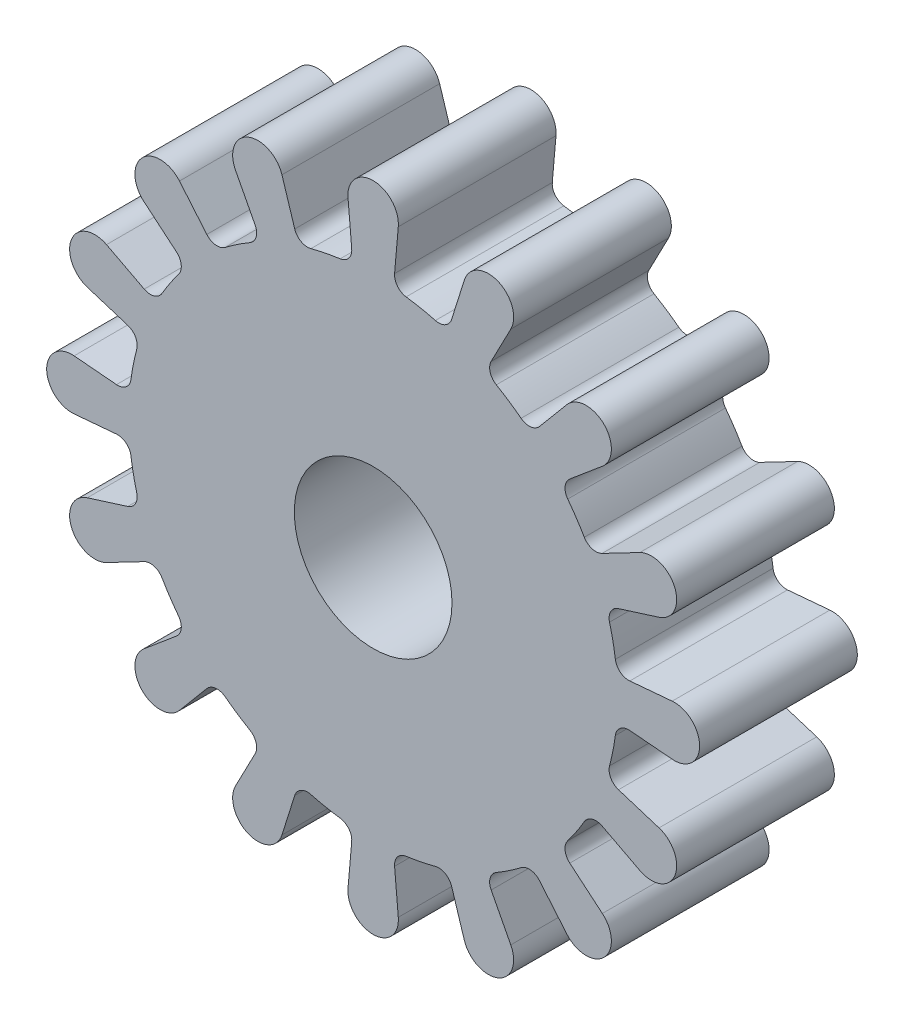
ISO-10303-21;
HEADER;
FILE_DESCRIPTION(('STEP AP214'),'2;1');
FILE_NAME('part.step','',(''),(''),'','','');
FILE_SCHEMA(('AUTOMOTIVE_DESIGN { 1 0 10303 214 1 1 1 1 }'));
ENDSEC;
DATA;
#1=APPLICATION_CONTEXT('core data for automotive mechanical design processes');
#2=APPLICATION_PROTOCOL_DEFINITION('international standard','automotive_design',2000,#1);
#3=PRODUCT_CONTEXT('',#1,'mechanical');
#4=PRODUCT('Part','Part','',(#3));
#5=PRODUCT_RELATED_PRODUCT_CATEGORY('part','',(#4));
#6=PRODUCT_DEFINITION_FORMATION('','',#4);
#7=PRODUCT_DEFINITION_CONTEXT('part definition',#1,'design');
#8=PRODUCT_DEFINITION('design','',#6,#7);
#9=PRODUCT_DEFINITION_SHAPE('','',#8);
#10=(LENGTH_UNIT() NAMED_UNIT(*) SI_UNIT(.MILLI.,.METRE.));
#11=(NAMED_UNIT(*) PLANE_ANGLE_UNIT() SI_UNIT($,.RADIAN.));
#12=(NAMED_UNIT(*) SI_UNIT($,.STERADIAN.) SOLID_ANGLE_UNIT());
#13=UNCERTAINTY_MEASURE_WITH_UNIT(LENGTH_MEASURE(1.E-05),#10,'distance_accuracy_value','');
#14=(GEOMETRIC_REPRESENTATION_CONTEXT(3) GLOBAL_UNCERTAINTY_ASSIGNED_CONTEXT((#13)) GLOBAL_UNIT_ASSIGNED_CONTEXT((#10,
#11,#12)) REPRESENTATION_CONTEXT('',''));
#15=CARTESIAN_POINT('',(0.,0.,0.));
#16=DIRECTION('',(0.,0.,1.));
#17=DIRECTION('',(1.,0.,0.));
#18=AXIS2_PLACEMENT_3D('',#15,#16,#17);
#19=CARTESIAN_POINT('',(0.,0.,10.));
#20=DIRECTION('',(0.,0.,-1.));
#21=DIRECTION('',(-1.,0.,0.));
#22=AXIS2_PLACEMENT_3D('',#19,#20,#21);
#23=CYLINDRICAL_SURFACE('',#22,15.5);
#24=CARTESIAN_POINT('',(0.,0.,0.));
#25=DIRECTION('',(0.,0.,1.));
#26=DIRECTION('',(1.,0.,0.));
#27=AXIS2_PLACEMENT_3D('',#24,#25,#26);
#28=CIRCLE('',#27,15.5);
#29=CARTESIAN_POINT('',(-2.09101973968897,15.3583083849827,0.));
#30=VERTEX_POINT('',#29);
#31=CARTESIAN_POINT('',(-3.94551982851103,14.9894253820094,0.));
#32=VERTEX_POINT('',#31);
#33=EDGE_CURVE('E658',#30,#32,#28,.T.);
#34=ORIENTED_EDGE('',*,*,#33,.T.);
#35=DIRECTION('',(0.,0.,-1.));
#36=VECTOR('',#35,1.);
#37=CARTESIAN_POINT('',(-3.94551982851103,14.9894253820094,10.));
#38=LINE('',#37,#36);
#39=CARTESIAN_POINT('',(-3.94551982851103,14.9894253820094,10.));
#40=VERTEX_POINT('',#39);
#41=EDGE_CURVE('E11',#40,#32,#38,.T.);
#42=ORIENTED_EDGE('',*,*,#41,.F.);
#43=CARTESIAN_POINT('',(0.,0.,10.));
#44=DIRECTION('',(0.,0.,1.));
#45=DIRECTION('',(1.,0.,0.));
#46=AXIS2_PLACEMENT_3D('',#43,#44,#45);
#47=CIRCLE('',#46,15.5);
#48=CARTESIAN_POINT('',(-2.09101973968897,15.3583083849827,10.));
#49=VERTEX_POINT('',#48);
#50=EDGE_CURVE('E1357',#49,#40,#47,.T.);
#51=ORIENTED_EDGE('',*,*,#50,.F.);
#52=DIRECTION('',(0.,0.,-1.));
#53=VECTOR('',#52,1.);
#54=CARTESIAN_POINT('',(-2.09101973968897,15.3583083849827,10.));
#55=LINE('',#54,#53);
#56=EDGE_CURVE('E651',#49,#30,#55,.T.);
#57=ORIENTED_EDGE('',*,*,#56,.T.);
#58=EDGE_LOOP('',(#34,#42,#51,#57));
#59=FACE_BOUND('',#58,.T.);
#60=ADVANCED_FACE('F31',(#59),#23,.T.);
#61=CARTESIAN_POINT('',(-4.16188704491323,15.8114261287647,10.));
#62=DIRECTION('',(0.,0.,-1.));
#63=DIRECTION('',(-1.,0.,0.));
#64=AXIS2_PLACEMENT_3D('',#61,#62,#63);
#65=CYLINDRICAL_SURFACE('',#64,0.850000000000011);
#66=CARTESIAN_POINT('',(-4.16188704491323,15.8114261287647,0.));
#67=DIRECTION('',(0.,0.,1.));
#68=DIRECTION('',(1.,0.,0.));
#69=AXIS2_PLACEMENT_3D('',#66,#67,#68);
#70=CIRCLE('',#69,0.850000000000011);
#71=CARTESIAN_POINT('',(-4.97254645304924,15.5558261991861,0.));
#72=VERTEX_POINT('',#71);
#73=EDGE_CURVE('E661',#32,#72,#70,.F.);
#74=ORIENTED_EDGE('',*,*,#73,.T.);
#75=DIRECTION('',(0.,0.,-1.));
#76=VECTOR('',#75,1.);
#77=CARTESIAN_POINT('',(-4.97254645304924,15.5558261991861,10.));
#78=LINE('',#77,#76);
#79=CARTESIAN_POINT('',(-4.97254645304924,15.5558261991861,10.));
#80=VERTEX_POINT('',#79);
#81=EDGE_CURVE('E40',#80,#72,#78,.T.);
#82=ORIENTED_EDGE('',*,*,#81,.F.);
#83=CARTESIAN_POINT('',(-4.16188704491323,15.8114261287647,10.));
#84=DIRECTION('',(0.,0.,1.));
#85=DIRECTION('',(1.,0.,0.));
#86=AXIS2_PLACEMENT_3D('',#83,#84,#85);
#87=CIRCLE('',#86,0.850000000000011);
#88=EDGE_CURVE('E355',#40,#80,#87,.F.);
#89=ORIENTED_EDGE('',*,*,#88,.F.);
#90=ORIENTED_EDGE('',*,*,#41,.T.);
#91=EDGE_LOOP('',(#74,#82,#89,#90));
#92=FACE_BOUND('',#91,.T.);
#93=ADVANCED_FACE('F1129',(#92),#65,.F.);
#94=CARTESIAN_POINT('',(12.6539860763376,-40.3483927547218,10.));
#95=DIRECTION('',(0.953716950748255,0.300705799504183,0.));
#96=DIRECTION('',(-0.300705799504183,0.953716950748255,0.));
#97=AXIS2_PLACEMENT_3D('',#94,#95,#96);
#98=PLANE('',#97);
#99=DIRECTION('',(0.300705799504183,-0.953716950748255,0.));
#100=VECTOR('',#99,1.);
#101=CARTESIAN_POINT('',(12.6539860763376,-40.3483927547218,0.));
#102=LINE('',#101,#100);
#103=CARTESIAN_POINT('',(-5.7833064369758,18.1272283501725,0.));
#104=VERTEX_POINT('',#103);
#105=EDGE_CURVE('E664',#104,#72,#102,.T.);
#106=ORIENTED_EDGE('',*,*,#105,.F.);
#107=DIRECTION('',(0.,0.,-1.));
#108=VECTOR('',#107,1.);
#109=CARTESIAN_POINT('',(-5.7833064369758,18.1272283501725,10.));
#110=LINE('',#109,#108);
#111=CARTESIAN_POINT('',(-5.7833064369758,18.1272283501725,10.));
#112=VERTEX_POINT('',#111);
#113=EDGE_CURVE('E1122',#112,#104,#110,.T.);
#114=ORIENTED_EDGE('',*,*,#113,.F.);
#115=DIRECTION('',(0.300705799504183,-0.953716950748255,0.));
#116=VECTOR('',#115,1.);
#117=CARTESIAN_POINT('',(12.6539860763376,-40.3483927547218,10.));
#118=LINE('',#117,#116);
#119=EDGE_CURVE('E1128',#112,#80,#118,.T.);
#120=ORIENTED_EDGE('',*,*,#119,.T.);
#121=ORIENTED_EDGE('',*,*,#81,.T.);
#122=EDGE_LOOP('',(#106,#114,#120,#121));
#123=FACE_BOUND('',#122,.T.);
#124=ADVANCED_FACE('F1126',(#123),#98,.T.);
#125=CARTESIAN_POINT('',(-7.30925355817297,17.6460990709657,10.));
#126=DIRECTION('',(0.,0.,-1.));
#127=DIRECTION('',(-1.,0.,0.));
#128=AXIS2_PLACEMENT_3D('',#125,#126,#127);
#129=CYLINDRICAL_SURFACE('',#128,1.6);
#130=CARTESIAN_POINT('',(-7.30925355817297,17.6460990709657,0.));
#131=DIRECTION('',(0.,0.,1.));
#132=DIRECTION('',(1.,0.,0.));
#133=AXIS2_PLACEMENT_3D('',#130,#131,#132);
#134=CIRCLE('',#133,1.6);
#135=CARTESIAN_POINT('',(-8.72847089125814,16.9073012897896,0.));
#136=VERTEX_POINT('',#135);
#137=EDGE_CURVE('E667',#104,#136,#134,.T.);
#138=ORIENTED_EDGE('',*,*,#137,.T.);
#139=DIRECTION('',(0.,0.,-1.));
#140=VECTOR('',#139,1.);
#141=CARTESIAN_POINT('',(-8.72847089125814,16.9073012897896,10.));
#142=LINE('',#141,#140);
#143=CARTESIAN_POINT('',(-8.72847089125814,16.9073012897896,10.));
#144=VERTEX_POINT('',#143);
#145=EDGE_CURVE('E1119',#144,#136,#142,.T.);
#146=ORIENTED_EDGE('',*,*,#145,.F.);
#147=CARTESIAN_POINT('',(-7.30925355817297,17.6460990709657,10.));
#148=DIRECTION('',(0.,0.,1.));
#149=DIRECTION('',(1.,0.,0.));
#150=AXIS2_PLACEMENT_3D('',#147,#148,#149);
#151=CIRCLE('',#150,1.6);
#152=EDGE_CURVE('E1148',#112,#144,#151,.T.);
#153=ORIENTED_EDGE('',*,*,#152,.F.);
#154=ORIENTED_EDGE('',*,*,#113,.T.);
#155=EDGE_LOOP('',(#138,#146,#153,#154));
#156=FACE_BOUND('',#155,.T.);
#157=ADVANCED_FACE('F1138',(#156),#129,.T.);
#158=CARTESIAN_POINT('',(18.5992800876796,-35.5888199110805,10.));
#159=DIRECTION('',(0.887010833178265,0.461748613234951,0.));
#160=DIRECTION('',(-0.461748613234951,0.887010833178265,0.));
#161=AXIS2_PLACEMENT_3D('',#158,#159,#160);
#162=PLANE('',#161);
#163=DIRECTION('',(0.461748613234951,-0.887010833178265,0.));
#164=VECTOR('',#163,1.);
#165=CARTESIAN_POINT('',(18.5992800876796,-35.5888199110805,0.));
#166=LINE('',#165,#164);
#167=CARTESIAN_POINT('',(-7.48350887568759,14.5157515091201,0.));
#168=VERTEX_POINT('',#167);
#169=EDGE_CURVE('E669',#136,#168,#166,.T.);
#170=ORIENTED_EDGE('',*,*,#169,.T.);
#171=DIRECTION('',(0.,0.,-1.));
#172=VECTOR('',#171,1.);
#173=CARTESIAN_POINT('',(-7.48350887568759,14.5157515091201,10.));
#174=LINE('',#173,#172);
#175=CARTESIAN_POINT('',(-7.48350887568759,14.5157515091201,10.));
#176=VERTEX_POINT('',#175);
#177=EDGE_CURVE('E1117',#176,#168,#174,.T.);
#178=ORIENTED_EDGE('',*,*,#177,.F.);
#179=DIRECTION('',(0.461748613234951,-0.887010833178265,0.));
#180=VECTOR('',#179,1.);
#181=CARTESIAN_POINT('',(18.5992800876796,-35.5888199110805,10.));
#182=LINE('',#181,#180);
#183=EDGE_CURVE('E1144',#144,#176,#182,.T.);
#184=ORIENTED_EDGE('',*,*,#183,.F.);
#185=ORIENTED_EDGE('',*,*,#145,.T.);
#186=EDGE_LOOP('',(#170,#178,#184,#185));
#187=FACE_BOUND('',#186,.T.);
#188=ADVANCED_FACE('F1142',(#187),#162,.F.);
#189=CARTESIAN_POINT('',(-8.23746808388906,14.1232651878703,10.));
#190=DIRECTION('',(0.,0.,-1.));
#191=DIRECTION('',(-1.,0.,0.));
#192=AXIS2_PLACEMENT_3D('',#189,#190,#191);
#193=CYLINDRICAL_SURFACE('',#192,0.84999999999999);
#194=CARTESIAN_POINT('',(-8.23746808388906,14.1232651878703,0.));
#195=DIRECTION('',(0.,0.,1.));
#196=DIRECTION('',(1.,0.,0.));
#197=AXIS2_PLACEMENT_3D('',#194,#195,#196);
#198=CIRCLE('',#197,0.84999999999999);
#199=CARTESIAN_POINT('',(-7.80922050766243,13.3890281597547,0.));
#200=VERTEX_POINT('',#199);
#201=EDGE_CURVE('E672',#200,#168,#198,.T.);
#202=ORIENTED_EDGE('',*,*,#201,.F.);
#203=DIRECTION('',(0.,0.,-1.));
#204=VECTOR('',#203,1.);
#205=CARTESIAN_POINT('',(-7.80922050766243,13.3890281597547,10.));
#206=LINE('',#205,#204);
#207=CARTESIAN_POINT('',(-7.80922050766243,13.3890281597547,10.));
#208=VERTEX_POINT('',#207);
#209=EDGE_CURVE('E1115',#208,#200,#206,.T.);
#210=ORIENTED_EDGE('',*,*,#209,.F.);
#211=CARTESIAN_POINT('',(-8.23746808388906,14.1232651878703,10.));
#212=DIRECTION('',(0.,0.,1.));
#213=DIRECTION('',(1.,0.,0.));
#214=AXIS2_PLACEMENT_3D('',#211,#212,#213);
#215=CIRCLE('',#214,0.84999999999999);
#216=EDGE_CURVE('E1147',#208,#176,#215,.T.);
#217=ORIENTED_EDGE('',*,*,#216,.T.);
#218=ORIENTED_EDGE('',*,*,#177,.T.);
#219=EDGE_LOOP('',(#202,#210,#217,#218));
#220=FACE_BOUND('',#219,.T.);
#221=ADVANCED_FACE('F1382',(#220),#193,.F.);
#222=CARTESIAN_POINT('',(0.,0.,10.));
#223=DIRECTION('',(0.,0.,-1.));
#224=DIRECTION('',(-1.,0.,0.));
#225=AXIS2_PLACEMENT_3D('',#222,#223,#224);
#226=CYLINDRICAL_SURFACE('',#225,15.5);
#227=CARTESIAN_POINT('',(0.,0.,0.));
#228=DIRECTION('',(0.,0.,1.));
#229=DIRECTION('',(1.,0.,0.));
#230=AXIS2_PLACEMENT_3D('',#227,#228,#229);
#231=CIRCLE('',#230,15.5);
#232=CARTESIAN_POINT('',(-9.38138976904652,12.3385382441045,0.));
#233=VERTEX_POINT('',#232);
#234=EDGE_CURVE('E675',#200,#233,#231,.T.);
#235=ORIENTED_EDGE('',*,*,#234,.T.);
#236=DIRECTION('',(0.,0.,-1.));
#237=VECTOR('',#236,1.);
#238=CARTESIAN_POINT('',(-9.38138976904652,12.3385382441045,10.));
#239=LINE('',#238,#237);
#240=CARTESIAN_POINT('',(-9.38138976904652,12.3385382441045,10.));
#241=VERTEX_POINT('',#240);
#242=EDGE_CURVE('E1113',#241,#233,#239,.T.);
#243=ORIENTED_EDGE('',*,*,#242,.F.);
#244=CARTESIAN_POINT('',(0.,0.,10.));
#245=DIRECTION('',(0.,0.,1.));
#246=DIRECTION('',(1.,0.,0.));
#247=AXIS2_PLACEMENT_3D('',#244,#245,#246);
#248=CIRCLE('',#247,15.5);
#249=EDGE_CURVE('E1150',#208,#241,#248,.T.);
#250=ORIENTED_EDGE('',*,*,#249,.F.);
#251=ORIENTED_EDGE('',*,*,#209,.T.);
#252=EDGE_LOOP('',(#235,#243,#250,#251));
#253=FACE_BOUND('',#252,.T.);
#254=ADVANCED_FACE('F1385',(#253),#226,.T.);
#255=CARTESIAN_POINT('',(-9.89585307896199,13.0151677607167,10.));
#256=DIRECTION('',(0.,0.,-1.));
#257=DIRECTION('',(-1.,0.,0.));
#258=AXIS2_PLACEMENT_3D('',#255,#256,#257);
#259=CYLINDRICAL_SURFACE('',#258,0.849999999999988);
#260=CARTESIAN_POINT('',(-9.89585307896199,13.0151677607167,0.));
#261=DIRECTION('',(0.,0.,1.));
#262=DIRECTION('',(1.,0.,0.));
#263=AXIS2_PLACEMENT_3D('',#260,#261,#262);
#264=CIRCLE('',#263,0.849999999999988);
#265=CARTESIAN_POINT('',(-10.5469908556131,12.4687982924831,0.));
#266=VERTEX_POINT('',#265);
#267=EDGE_CURVE('E678',#266,#233,#264,.T.);
#268=ORIENTED_EDGE('',*,*,#267,.F.);
#269=DIRECTION('',(0.,0.,-1.));
#270=VECTOR('',#269,1.);
#271=CARTESIAN_POINT('',(-10.5469908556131,12.4687982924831,10.));
#272=LINE('',#271,#270);
#273=CARTESIAN_POINT('',(-10.5469908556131,12.4687982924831,10.));
#274=VERTEX_POINT('',#273);
#275=EDGE_CURVE('E1111',#274,#266,#272,.T.);
#276=ORIENTED_EDGE('',*,*,#275,.F.);
#277=CARTESIAN_POINT('',(-9.89585307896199,13.0151677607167,10.));
#278=DIRECTION('',(0.,0.,1.));
#279=DIRECTION('',(1.,0.,0.));
#280=AXIS2_PLACEMENT_3D('',#277,#278,#279);
#281=CIRCLE('',#280,0.849999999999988);
#282=EDGE_CURVE('E1156',#274,#241,#281,.T.);
#283=ORIENTED_EDGE('',*,*,#282,.T.);
#284=ORIENTED_EDGE('',*,*,#242,.T.);
#285=EDGE_LOOP('',(#268,#276,#283,#284));
#286=FACE_BOUND('',#285,.T.);
#287=ADVANCED_FACE('F1389',(#286),#259,.F.);
#288=CARTESIAN_POINT('',(22.954836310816,-27.457124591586,10.));
#289=DIRECTION('',(0.766044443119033,0.642787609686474,0.));
#290=DIRECTION('',(-0.642787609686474,0.766044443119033,0.));
#291=AXIS2_PLACEMENT_3D('',#288,#289,#290);
#292=PLANE('',#291);
#293=DIRECTION('',(0.642787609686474,-0.766044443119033,0.));
#294=VECTOR('',#293,1.);
#295=CARTESIAN_POINT('',(22.954836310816,-27.457124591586,0.));
#296=LINE('',#295,#294);
#297=CARTESIAN_POINT('',(-12.2800684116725,14.5341996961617,0.));
#298=VERTEX_POINT('',#297);
#299=EDGE_CURVE('E681',#298,#266,#296,.T.);
#300=ORIENTED_EDGE('',*,*,#299,.F.);
#301=DIRECTION('',(0.,0.,-1.));
#302=VECTOR('',#301,1.);
#303=CARTESIAN_POINT('',(-12.2800684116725,14.5341996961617,10.));
#304=LINE('',#303,#302);
#305=CARTESIAN_POINT('',(-12.2800684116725,14.5341996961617,10.));
#306=VERTEX_POINT('',#305);
#307=EDGE_CURVE('E1109',#306,#298,#304,.T.);
#308=ORIENTED_EDGE('',*,*,#307,.F.);
#309=DIRECTION('',(0.642787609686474,-0.766044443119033,0.));
#310=VECTOR('',#309,1.);
#311=CARTESIAN_POINT('',(22.954836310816,-27.457124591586,10.));
#312=LINE('',#311,#310);
#313=EDGE_CURVE('E1159',#306,#274,#312,.T.);
#314=ORIENTED_EDGE('',*,*,#313,.T.);
#315=ORIENTED_EDGE('',*,*,#275,.T.);
#316=EDGE_LOOP('',(#300,#308,#314,#315));
#317=FACE_BOUND('',#316,.T.);
#318=ADVANCED_FACE('F1393',(#317),#292,.T.);
#319=CARTESIAN_POINT('',(-13.5057395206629,13.5057395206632,10.));
#320=DIRECTION('',(0.,0.,-1.));
#321=DIRECTION('',(-1.,0.,0.));
#322=AXIS2_PLACEMENT_3D('',#319,#320,#321);
#323=CYLINDRICAL_SURFACE('',#322,1.6);
#324=CARTESIAN_POINT('',(-13.5057395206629,13.5057395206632,0.));
#325=DIRECTION('',(0.,0.,1.));
#326=DIRECTION('',(1.,0.,0.));
#327=AXIS2_PLACEMENT_3D('',#324,#325,#326);
#328=CIRCLE('',#327,1.6);
#329=CARTESIAN_POINT('',(-14.5341996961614,12.2800684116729,0.));
#330=VERTEX_POINT('',#329);
#331=EDGE_CURVE('E684',#298,#330,#328,.T.);
#332=ORIENTED_EDGE('',*,*,#331,.T.);
#333=DIRECTION('',(0.,0.,-1.));
#334=VECTOR('',#333,1.);
#335=CARTESIAN_POINT('',(-14.5341996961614,12.2800684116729,10.));
#336=LINE('',#335,#334);
#337=CARTESIAN_POINT('',(-14.5341996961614,12.2800684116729,10.));
#338=VERTEX_POINT('',#337);
#339=EDGE_CURVE('E1106',#338,#330,#336,.T.);
#340=ORIENTED_EDGE('',*,*,#339,.F.);
#341=CARTESIAN_POINT('',(-13.5057395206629,13.5057395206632,10.));
#342=DIRECTION('',(0.,0.,1.));
#343=DIRECTION('',(1.,0.,0.));
#344=AXIS2_PLACEMENT_3D('',#341,#342,#343);
#345=CIRCLE('',#344,1.6);
#346=EDGE_CURVE('E1162',#306,#338,#345,.T.);
#347=ORIENTED_EDGE('',*,*,#346,.F.);
#348=ORIENTED_EDGE('',*,*,#307,.T.);
#349=EDGE_LOOP('',(#332,#340,#347,#348));
#350=FACE_BOUND('',#349,.T.);
#351=ADVANCED_FACE('F1397',(#350),#323,.T.);
#352=CARTESIAN_POINT('',(23.8350720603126,-19.9155733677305,10.));
#353=DIRECTION('',(0.642787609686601,0.766044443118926,0.));
#354=DIRECTION('',(-0.766044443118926,0.642787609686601,0.));
#355=AXIS2_PLACEMENT_3D('',#352,#353,#354);
#356=PLANE('',#355);
#357=DIRECTION('',(0.766044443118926,-0.642787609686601,0.));
#358=VECTOR('',#357,1.);
#359=CARTESIAN_POINT('',(23.8350720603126,-19.9155733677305,0.));
#360=LINE('',#359,#358);
#361=CARTESIAN_POINT('',(-12.4687982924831,10.5469908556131,0.));
#362=VERTEX_POINT('',#361);
#363=EDGE_CURVE('E686',#330,#362,#360,.T.);
#364=ORIENTED_EDGE('',*,*,#363,.T.);
#365=DIRECTION('',(0.,0.,-1.));
#366=VECTOR('',#365,1.);
#367=CARTESIAN_POINT('',(-12.4687982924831,10.5469908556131,10.));
#368=LINE('',#367,#366);
#369=CARTESIAN_POINT('',(-12.4687982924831,10.5469908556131,10.));
#370=VERTEX_POINT('',#369);
#371=EDGE_CURVE('E1103',#370,#362,#368,.T.);
#372=ORIENTED_EDGE('',*,*,#371,.F.);
#373=DIRECTION('',(0.766044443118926,-0.642787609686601,0.));
#374=VECTOR('',#373,1.);
#375=CARTESIAN_POINT('',(23.8350720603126,-19.9155733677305,10.));
#376=LINE('',#375,#374);
#377=EDGE_CURVE('E1164',#338,#370,#376,.T.);
#378=ORIENTED_EDGE('',*,*,#377,.F.);
#379=ORIENTED_EDGE('',*,*,#339,.T.);
#380=EDGE_LOOP('',(#364,#372,#378,#379));
#381=FACE_BOUND('',#380,.T.);
#382=ADVANCED_FACE('F1401',(#381),#356,.F.);
#383=CARTESIAN_POINT('',(-13.0151677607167,9.89585307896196,10.));
#384=DIRECTION('',(0.,0.,-1.));
#385=DIRECTION('',(-1.,0.,0.));
#386=AXIS2_PLACEMENT_3D('',#383,#384,#385);
#387=CYLINDRICAL_SURFACE('',#386,0.85000000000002);
#388=CARTESIAN_POINT('',(-13.0151677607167,9.89585307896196,0.));
#389=DIRECTION('',(0.,0.,1.));
#390=DIRECTION('',(1.,0.,0.));
#391=AXIS2_PLACEMENT_3D('',#388,#389,#390);
#392=CIRCLE('',#391,0.85000000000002);
#393=CARTESIAN_POINT('',(-12.3385382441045,9.38138976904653,0.));
#394=VERTEX_POINT('',#393);
#395=EDGE_CURVE('E688',#362,#394,#392,.F.);
#396=ORIENTED_EDGE('',*,*,#395,.T.);
#397=DIRECTION('',(0.,0.,-1.));
#398=VECTOR('',#397,1.);
#399=CARTESIAN_POINT('',(-12.3385382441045,9.38138976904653,10.));
#400=LINE('',#399,#398);
#401=CARTESIAN_POINT('',(-12.3385382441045,9.38138976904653,10.));
#402=VERTEX_POINT('',#401);
#403=EDGE_CURVE('E1100',#402,#394,#400,.T.);
#404=ORIENTED_EDGE('',*,*,#403,.F.);
#405=CARTESIAN_POINT('',(-13.0151677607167,9.89585307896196,10.));
#406=DIRECTION('',(0.,0.,1.));
#407=DIRECTION('',(1.,0.,0.));
#408=AXIS2_PLACEMENT_3D('',#405,#406,#407);
#409=CIRCLE('',#408,0.85000000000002);
#410=EDGE_CURVE('E1166',#370,#402,#409,.F.);
#411=ORIENTED_EDGE('',*,*,#410,.F.);
#412=ORIENTED_EDGE('',*,*,#371,.T.);
#413=EDGE_LOOP('',(#396,#404,#411,#412));
#414=FACE_BOUND('',#413,.T.);
#415=ADVANCED_FACE('F1405',(#414),#387,.F.);
#416=CARTESIAN_POINT('',(0.,0.,10.));
#417=DIRECTION('',(0.,0.,-1.));
#418=DIRECTION('',(-1.,0.,0.));
#419=AXIS2_PLACEMENT_3D('',#416,#417,#418);
#420=CYLINDRICAL_SURFACE('',#419,15.5);
#421=CARTESIAN_POINT('',(0.,0.,0.));
#422=DIRECTION('',(0.,0.,1.));
#423=DIRECTION('',(1.,0.,0.));
#424=AXIS2_PLACEMENT_3D('',#421,#422,#423);
#425=CIRCLE('',#424,15.5);
#426=CARTESIAN_POINT('',(-13.3890281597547,7.80922050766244,0.));
#427=VERTEX_POINT('',#426);
#428=EDGE_CURVE('E690',#394,#427,#425,.T.);
#429=ORIENTED_EDGE('',*,*,#428,.T.);
#430=DIRECTION('',(0.,0.,-1.));
#431=VECTOR('',#430,1.);
#432=CARTESIAN_POINT('',(-13.3890281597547,7.80922050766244,10.));
#433=LINE('',#432,#431);
#434=CARTESIAN_POINT('',(-13.3890281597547,7.80922050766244,10.));
#435=VERTEX_POINT('',#434);
#436=EDGE_CURVE('E1097',#435,#427,#433,.T.);
#437=ORIENTED_EDGE('',*,*,#436,.F.);
#438=CARTESIAN_POINT('',(0.,0.,10.));
#439=DIRECTION('',(0.,0.,1.));
#440=DIRECTION('',(1.,0.,0.));
#441=AXIS2_PLACEMENT_3D('',#438,#439,#440);
#442=CIRCLE('',#441,15.5);
#443=EDGE_CURVE('E1168',#402,#435,#442,.T.);
#444=ORIENTED_EDGE('',*,*,#443,.F.);
#445=ORIENTED_EDGE('',*,*,#403,.T.);
#446=EDGE_LOOP('',(#429,#437,#444,#445));
#447=FACE_BOUND('',#446,.T.);
#448=ADVANCED_FACE('F1409',(#447),#420,.T.);
#449=CARTESIAN_POINT('',(-14.1232651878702,8.23746808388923,10.));
#450=DIRECTION('',(0.,0.,-1.));
#451=DIRECTION('',(-1.,0.,0.));
#452=AXIS2_PLACEMENT_3D('',#449,#450,#451);
#453=CYLINDRICAL_SURFACE('',#452,0.850000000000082);
#454=CARTESIAN_POINT('',(-14.1232651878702,8.23746808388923,0.));
#455=DIRECTION('',(0.,0.,1.));
#456=DIRECTION('',(1.,0.,0.));
#457=AXIS2_PLACEMENT_3D('',#454,#455,#456);
#458=CIRCLE('',#457,0.850000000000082);
#459=CARTESIAN_POINT('',(-14.5157515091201,7.4835088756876,0.));
#460=VERTEX_POINT('',#459);
#461=EDGE_CURVE('E692',#427,#460,#458,.F.);
#462=ORIENTED_EDGE('',*,*,#461,.T.);
#463=DIRECTION('',(0.,0.,-1.));
#464=VECTOR('',#463,1.);
#465=CARTESIAN_POINT('',(-14.5157515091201,7.4835088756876,10.));
#466=LINE('',#465,#464);
#467=CARTESIAN_POINT('',(-14.5157515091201,7.4835088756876,10.));
#468=VERTEX_POINT('',#467);
#469=EDGE_CURVE('E1095',#468,#460,#466,.T.);
#470=ORIENTED_EDGE('',*,*,#469,.F.);
#471=CARTESIAN_POINT('',(-14.1232651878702,8.23746808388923,10.));
#472=DIRECTION('',(0.,0.,1.));
#473=DIRECTION('',(1.,0.,0.));
#474=AXIS2_PLACEMENT_3D('',#471,#472,#473);
#475=CIRCLE('',#474,0.850000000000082);
#476=EDGE_CURVE('E1170',#435,#468,#475,.F.);
#477=ORIENTED_EDGE('',*,*,#476,.F.);
#478=ORIENTED_EDGE('',*,*,#436,.T.);
#479=EDGE_LOOP('',(#462,#470,#477,#478));
#480=FACE_BOUND('',#479,.T.);
#481=ADVANCED_FACE('F1413',(#480),#453,.F.);
#482=CARTESIAN_POINT('',(21.1185877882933,-11.0665540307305,10.));
#483=DIRECTION('',(0.461748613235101,0.887010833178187,0.));
#484=DIRECTION('',(-0.887010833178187,0.461748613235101,0.));
#485=AXIS2_PLACEMENT_3D('',#482,#483,#484);
#486=PLANE('',#485);
#487=DIRECTION('',(0.887010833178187,-0.461748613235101,0.));
#488=VECTOR('',#487,1.);
#489=CARTESIAN_POINT('',(21.1185877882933,-11.0665540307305,0.));
#490=LINE('',#489,#488);
#491=CARTESIAN_POINT('',(-16.9073012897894,8.72847089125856,0.));
#492=VERTEX_POINT('',#491);
#493=EDGE_CURVE('E695',#492,#460,#490,.T.);
#494=ORIENTED_EDGE('',*,*,#493,.F.);
#495=DIRECTION('',(0.,0.,-1.));
#496=VECTOR('',#495,1.);
#497=CARTESIAN_POINT('',(-16.9073012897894,8.72847089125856,10.));
#498=LINE('',#497,#496);
#499=CARTESIAN_POINT('',(-16.9073012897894,8.72847089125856,10.));
#500=VERTEX_POINT('',#499);
#501=EDGE_CURVE('E1093',#500,#492,#498,.T.);
#502=ORIENTED_EDGE('',*,*,#501,.F.);
#503=DIRECTION('',(0.887010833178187,-0.461748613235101,0.));
#504=VECTOR('',#503,1.);
#505=CARTESIAN_POINT('',(21.1185877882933,-11.0665540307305,10.));
#506=LINE('',#505,#504);
#507=EDGE_CURVE('E1172',#500,#468,#506,.T.);
#508=ORIENTED_EDGE('',*,*,#507,.T.);
#509=ORIENTED_EDGE('',*,*,#469,.T.);
#510=EDGE_LOOP('',(#494,#502,#508,#509));
#511=FACE_BOUND('',#510,.T.);
#512=ADVANCED_FACE('F1417',(#511),#486,.T.);
#513=CARTESIAN_POINT('',(-17.6460990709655,7.30925355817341,10.));
#514=DIRECTION('',(0.,0.,-1.));
#515=DIRECTION('',(-1.,0.,0.));
#516=AXIS2_PLACEMENT_3D('',#513,#514,#515);
#517=CYLINDRICAL_SURFACE('',#516,1.6);
#518=CARTESIAN_POINT('',(-17.6460990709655,7.30925355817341,0.));
#519=DIRECTION('',(0.,0.,1.));
#520=DIRECTION('',(1.,0.,0.));
#521=AXIS2_PLACEMENT_3D('',#518,#519,#520);
#522=CIRCLE('',#521,1.6);
#523=CARTESIAN_POINT('',(-18.1272283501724,5.78330643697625,0.));
#524=VERTEX_POINT('',#523);
#525=EDGE_CURVE('E698',#492,#524,#522,.T.);
#526=ORIENTED_EDGE('',*,*,#525,.T.);
#527=DIRECTION('',(0.,0.,-1.));
#528=VECTOR('',#527,1.);
#529=CARTESIAN_POINT('',(-18.1272283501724,5.78330643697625,10.));
#530=LINE('',#529,#528);
#531=CARTESIAN_POINT('',(-18.1272283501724,5.78330643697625,10.));
#532=VERTEX_POINT('',#531);
#533=EDGE_CURVE('E1090',#532,#524,#530,.T.);
#534=ORIENTED_EDGE('',*,*,#533,.F.);
#535=CARTESIAN_POINT('',(-17.6460990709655,7.30925355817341,10.));
#536=DIRECTION('',(0.,0.,1.));
#537=DIRECTION('',(1.,0.,0.));
#538=AXIS2_PLACEMENT_3D('',#535,#536,#537);
#539=CIRCLE('',#538,1.6);
#540=EDGE_CURVE('E1175',#500,#532,#539,.T.);
#541=ORIENTED_EDGE('',*,*,#540,.F.);
#542=ORIENTED_EDGE('',*,*,#501,.T.);
#543=EDGE_LOOP('',(#526,#534,#541,#542));
#544=FACE_BOUND('',#543,.T.);
#545=ADVANCED_FACE('F1421',(#544),#517,.T.);
#546=CARTESIAN_POINT('',(16.4576379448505,-5.12126001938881,10.));
#547=DIRECTION('',(0.300705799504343,0.953716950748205,0.));
#548=DIRECTION('',(-0.953716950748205,0.300705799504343,0.));
#549=AXIS2_PLACEMENT_3D('',#546,#547,#548);
#550=PLANE('',#549);
#551=DIRECTION('',(0.953716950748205,-0.300705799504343,0.));
#552=VECTOR('',#551,1.);
#553=CARTESIAN_POINT('',(16.4576379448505,-5.12126001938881,0.));
#554=LINE('',#553,#552);
#555=CARTESIAN_POINT('',(-15.5558261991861,4.97254645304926,0.));
#556=VERTEX_POINT('',#555);
#557=EDGE_CURVE('E700',#524,#556,#554,.T.);
#558=ORIENTED_EDGE('',*,*,#557,.T.);
#559=DIRECTION('',(0.,0.,-1.));
#560=VECTOR('',#559,1.);
#561=CARTESIAN_POINT('',(-15.5558261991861,4.97254645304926,10.));
#562=LINE('',#561,#560);
#563=CARTESIAN_POINT('',(-15.5558261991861,4.97254645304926,10.));
#564=VERTEX_POINT('',#563);
#565=EDGE_CURVE('E1088',#564,#556,#562,.T.);
#566=ORIENTED_EDGE('',*,*,#565,.F.);
#567=DIRECTION('',(0.953716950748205,-0.300705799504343,0.));
#568=VECTOR('',#567,1.);
#569=CARTESIAN_POINT('',(16.4576379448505,-5.12126001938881,10.));
#570=LINE('',#569,#568);
#571=EDGE_CURVE('E1177',#532,#564,#570,.T.);
#572=ORIENTED_EDGE('',*,*,#571,.F.);
#573=ORIENTED_EDGE('',*,*,#533,.T.);
#574=EDGE_LOOP('',(#558,#566,#572,#573));
#575=FACE_BOUND('',#574,.T.);
#576=ADVANCED_FACE('F1425',(#575),#550,.F.);
#577=CARTESIAN_POINT('',(-15.8114261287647,4.16188704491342,10.));
#578=DIRECTION('',(0.,0.,-1.));
#579=DIRECTION('',(-1.,0.,0.));
#580=AXIS2_PLACEMENT_3D('',#577,#578,#579);
#581=CYLINDRICAL_SURFACE('',#580,0.849999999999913);
#582=CARTESIAN_POINT('',(-15.8114261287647,4.16188704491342,0.));
#583=DIRECTION('',(0.,0.,1.));
#584=DIRECTION('',(1.,0.,0.));
#585=AXIS2_PLACEMENT_3D('',#582,#583,#584);
#586=CIRCLE('',#585,0.849999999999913);
#587=CARTESIAN_POINT('',(-14.9894253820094,3.94551982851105,0.));
#588=VERTEX_POINT('',#587);
#589=EDGE_CURVE('E703',#588,#556,#586,.T.);
#590=ORIENTED_EDGE('',*,*,#589,.F.);
#591=DIRECTION('',(0.,0.,-1.));
#592=VECTOR('',#591,1.);
#593=CARTESIAN_POINT('',(-14.9894253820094,3.94551982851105,10.));
#594=LINE('',#593,#592);
#595=CARTESIAN_POINT('',(-14.9894253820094,3.94551982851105,10.));
#596=VERTEX_POINT('',#595);
#597=EDGE_CURVE('E1086',#596,#588,#594,.T.);
#598=ORIENTED_EDGE('',*,*,#597,.F.);
#599=CARTESIAN_POINT('',(-15.8114261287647,4.16188704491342,10.));
#600=DIRECTION('',(0.,0.,1.));
#601=DIRECTION('',(1.,0.,0.));
#602=AXIS2_PLACEMENT_3D('',#599,#600,#601);
#603=CIRCLE('',#602,0.849999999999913);
#604=EDGE_CURVE('E1179',#596,#564,#603,.T.);
#605=ORIENTED_EDGE('',*,*,#604,.T.);
#606=ORIENTED_EDGE('',*,*,#565,.T.);
#607=EDGE_LOOP('',(#590,#598,#605,#606));
#608=FACE_BOUND('',#607,.T.);
#609=ADVANCED_FACE('F1429',(#608),#581,.F.);
#610=CARTESIAN_POINT('',(0.,0.,10.));
#611=DIRECTION('',(0.,0.,-1.));
#612=DIRECTION('',(-1.,0.,0.));
#613=AXIS2_PLACEMENT_3D('',#610,#611,#612);
#614=CYLINDRICAL_SURFACE('',#613,15.5);
#615=CARTESIAN_POINT('',(0.,0.,0.));
#616=DIRECTION('',(0.,0.,1.));
#617=DIRECTION('',(1.,0.,0.));
#618=AXIS2_PLACEMENT_3D('',#615,#616,#617);
#619=CIRCLE('',#618,15.5);
#620=CARTESIAN_POINT('',(-15.3583083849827,2.09101973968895,0.));
#621=VERTEX_POINT('',#620);
#622=EDGE_CURVE('E706',#588,#621,#619,.T.);
#623=ORIENTED_EDGE('',*,*,#622,.T.);
#624=DIRECTION('',(0.,0.,-1.));
#625=VECTOR('',#624,1.);
#626=CARTESIAN_POINT('',(-15.3583083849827,2.09101973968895,10.));
#627=LINE('',#626,#625);
#628=CARTESIAN_POINT('',(-15.3583083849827,2.09101973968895,10.));
#629=VERTEX_POINT('',#628);
#630=EDGE_CURVE('E1083',#629,#621,#627,.T.);
#631=ORIENTED_EDGE('',*,*,#630,.F.);
#632=CARTESIAN_POINT('',(0.,0.,10.));
#633=DIRECTION('',(0.,0.,1.));
#634=DIRECTION('',(1.,0.,0.));
#635=AXIS2_PLACEMENT_3D('',#632,#633,#634);
#636=CIRCLE('',#635,15.5);
#637=EDGE_CURVE('E1182',#596,#629,#636,.T.);
#638=ORIENTED_EDGE('',*,*,#637,.F.);
#639=ORIENTED_EDGE('',*,*,#597,.T.);
#640=EDGE_LOOP('',(#623,#631,#638,#639));
#641=FACE_BOUND('',#640,.T.);
#642=ADVANCED_FACE('F1433',(#641),#614,.T.);
#643=CARTESIAN_POINT('',(-16.2005381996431,2.20568856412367,10.));
#644=DIRECTION('',(0.,0.,-1.));
#645=DIRECTION('',(-1.,0.,0.));
#646=AXIS2_PLACEMENT_3D('',#643,#644,#645);
#647=CYLINDRICAL_SURFACE('',#646,0.850000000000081);
#648=CARTESIAN_POINT('',(-16.2005381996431,2.20568856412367,0.));
#649=DIRECTION('',(0.,0.,1.));
#650=DIRECTION('',(1.,0.,0.));
#651=AXIS2_PLACEMENT_3D('',#648,#649,#650);
#652=CIRCLE('',#651,0.850000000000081);
#653=CARTESIAN_POINT('',(-16.2746205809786,1.35892307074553,0.));
#654=VERTEX_POINT('',#653);
#655=EDGE_CURVE('E708',#621,#654,#652,.F.);
#656=ORIENTED_EDGE('',*,*,#655,.T.);
#657=DIRECTION('',(0.,0.,-1.));
#658=VECTOR('',#657,1.);
#659=CARTESIAN_POINT('',(-16.2746205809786,1.35892307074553,10.));
#660=LINE('',#659,#658);
#661=CARTESIAN_POINT('',(-16.2746205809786,1.35892307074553,10.));
#662=VERTEX_POINT('',#661);
#663=EDGE_CURVE('E1081',#662,#654,#660,.T.);
#664=ORIENTED_EDGE('',*,*,#663,.F.);
#665=CARTESIAN_POINT('',(-16.2005381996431,2.20568856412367,10.));
#666=DIRECTION('',(0.,0.,1.));
#667=DIRECTION('',(1.,0.,0.));
#668=AXIS2_PLACEMENT_3D('',#665,#666,#667);
#669=CIRCLE('',#668,0.850000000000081);
#670=EDGE_CURVE('E1184',#629,#662,#669,.F.);
#671=ORIENTED_EDGE('',*,*,#670,.F.);
#672=ORIENTED_EDGE('',*,*,#630,.T.);
#673=EDGE_LOOP('',(#656,#664,#671,#672));
#674=FACE_BOUND('',#673,.T.);
#675=ADVANCED_FACE('F1437',(#674),#647,.F.);
#676=CARTESIAN_POINT('',(8.22942226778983,-0.784902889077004,10.));
#677=DIRECTION('',(0.0871557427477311,0.996194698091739,0.));
#678=DIRECTION('',(-0.996194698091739,0.0871557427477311,0.));
#679=AXIS2_PLACEMENT_3D('',#676,#677,#678);
#680=PLANE('',#679);
#681=DIRECTION('',(0.996194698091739,-0.0871557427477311,0.));
#682=VECTOR('',#681,1.);
#683=CARTESIAN_POINT('',(8.22942226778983,-0.784902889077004,0.));
#684=LINE('',#683,#682);
#685=CARTESIAN_POINT('',(-18.9605508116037,1.593911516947,0.));
#686=VERTEX_POINT('',#685);
#687=EDGE_CURVE('E711',#686,#654,#684,.T.);
#688=ORIENTED_EDGE('',*,*,#687,.F.);
#689=DIRECTION('',(0.,0.,-1.));
#690=VECTOR('',#689,1.);
#691=CARTESIAN_POINT('',(-18.9605508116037,1.593911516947,10.));
#692=LINE('',#691,#690);
#693=CARTESIAN_POINT('',(-18.9605508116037,1.593911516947,10.));
#694=VERTEX_POINT('',#693);
#695=EDGE_CURVE('E1079',#694,#686,#692,.T.);
#696=ORIENTED_EDGE('',*,*,#695,.F.);
#697=DIRECTION('',(0.996194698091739,-0.0871557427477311,0.));
#698=VECTOR('',#697,1.);
#699=CARTESIAN_POINT('',(8.22942226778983,-0.784902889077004,10.));
#700=LINE('',#699,#698);
#701=EDGE_CURVE('E1186',#694,#662,#700,.T.);
#702=ORIENTED_EDGE('',*,*,#701,.T.);
#703=ORIENTED_EDGE('',*,*,#663,.T.);
#704=EDGE_LOOP('',(#688,#696,#702,#703));
#705=FACE_BOUND('',#704,.T.);
#706=ADVANCED_FACE('F1441',(#705),#680,.T.);
#707=CARTESIAN_POINT('',(-19.1,2.01828127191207E-13,10.));
#708=DIRECTION('',(0.,0.,-1.));
#709=DIRECTION('',(-1.,0.,0.));
#710=AXIS2_PLACEMENT_3D('',#707,#708,#709);
#711=CYLINDRICAL_SURFACE('',#710,1.6);
#712=CARTESIAN_POINT('',(-19.1,2.01828127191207E-13,0.));
#713=DIRECTION('',(0.,0.,1.));
#714=DIRECTION('',(1.,0.,0.));
#715=AXIS2_PLACEMENT_3D('',#712,#713,#714);
#716=CIRCLE('',#715,1.6);
#717=CARTESIAN_POINT('',(-18.9605508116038,-1.59391151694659,0.));
#718=VERTEX_POINT('',#717);
#719=EDGE_CURVE('E714',#686,#718,#716,.T.);
#720=ORIENTED_EDGE('',*,*,#719,.T.);
#721=DIRECTION('',(0.,0.,-1.));
#722=VECTOR('',#721,1.);
#723=CARTESIAN_POINT('',(-18.9605508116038,-1.59391151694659,10.));
#724=LINE('',#723,#722);
#725=CARTESIAN_POINT('',(-18.9605508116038,-1.59391151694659,10.));
#726=VERTEX_POINT('',#725);
#727=EDGE_CURVE('E1076',#726,#718,#724,.T.);
#728=ORIENTED_EDGE('',*,*,#727,.F.);
#729=CARTESIAN_POINT('',(-19.1,2.01828127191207E-13,10.));
#730=DIRECTION('',(0.,0.,1.));
#731=DIRECTION('',(1.,0.,0.));
#732=AXIS2_PLACEMENT_3D('',#729,#730,#731);
#733=CIRCLE('',#732,1.6);
#734=EDGE_CURVE('E1189',#694,#726,#733,.T.);
#735=ORIENTED_EDGE('',*,*,#734,.F.);
#736=ORIENTED_EDGE('',*,*,#695,.T.);
#737=EDGE_LOOP('',(#720,#728,#735,#736));
#738=FACE_BOUND('',#737,.T.);
#739=ADVANCED_FACE('F1445',(#738),#711,.T.);
#740=CARTESIAN_POINT('',(0.778986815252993,0.133074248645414,10.));
#741=DIRECTION('',(-0.0871557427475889,0.996194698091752,0.));
#742=DIRECTION('',(-0.996194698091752,-0.0871557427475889,0.));
#743=AXIS2_PLACEMENT_3D('',#740,#741,#742);
#744=PLANE('',#743);
#745=DIRECTION('',(0.996194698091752,0.0871557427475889,0.));
#746=VECTOR('',#745,1.);
#747=CARTESIAN_POINT('',(0.778986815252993,0.133074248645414,0.));
#748=LINE('',#747,#746);
#749=CARTESIAN_POINT('',(-16.2746205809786,-1.35892307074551,0.));
#750=VERTEX_POINT('',#749);
#751=EDGE_CURVE('E716',#718,#750,#748,.T.);
#752=ORIENTED_EDGE('',*,*,#751,.T.);
#753=DIRECTION('',(0.,0.,-1.));
#754=VECTOR('',#753,1.);
#755=CARTESIAN_POINT('',(-16.2746205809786,-1.35892307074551,10.));
#756=LINE('',#755,#754);
#757=CARTESIAN_POINT('',(-16.2746205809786,-1.35892307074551,10.));
#758=VERTEX_POINT('',#757);
#759=EDGE_CURVE('E1074',#758,#750,#756,.T.);
#760=ORIENTED_EDGE('',*,*,#759,.F.);
#761=DIRECTION('',(0.996194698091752,0.0871557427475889,0.));
#762=VECTOR('',#761,1.);
#763=CARTESIAN_POINT('',(0.778986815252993,0.133074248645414,10.));
#764=LINE('',#763,#762);
#765=EDGE_CURVE('E1191',#726,#758,#764,.T.);
#766=ORIENTED_EDGE('',*,*,#765,.F.);
#767=ORIENTED_EDGE('',*,*,#727,.T.);
#768=EDGE_LOOP('',(#752,#760,#766,#767));
#769=FACE_BOUND('',#768,.T.);
#770=ADVANCED_FACE('F1449',(#769),#744,.F.);
#771=CARTESIAN_POINT('',(-16.2005381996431,-2.20568856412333,10.));
#772=DIRECTION('',(0.,0.,-1.));
#773=DIRECTION('',(-1.,0.,0.));
#774=AXIS2_PLACEMENT_3D('',#771,#772,#773);
#775=CYLINDRICAL_SURFACE('',#774,0.849999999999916);
#776=CARTESIAN_POINT('',(-16.2005381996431,-2.20568856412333,0.));
#777=DIRECTION('',(0.,0.,1.));
#778=DIRECTION('',(1.,0.,0.));
#779=AXIS2_PLACEMENT_3D('',#776,#777,#778);
#780=CIRCLE('',#779,0.849999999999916);
#781=CARTESIAN_POINT('',(-15.3583083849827,-2.09101973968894,0.));
#782=VERTEX_POINT('',#781);
#783=EDGE_CURVE('E719',#782,#750,#780,.T.);
#784=ORIENTED_EDGE('',*,*,#783,.F.);
#785=DIRECTION('',(0.,0.,-1.));
#786=VECTOR('',#785,1.);
#787=CARTESIAN_POINT('',(-15.3583083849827,-2.09101973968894,10.));
#788=LINE('',#787,#786);
#789=CARTESIAN_POINT('',(-15.3583083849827,-2.09101973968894,10.));
#790=VERTEX_POINT('',#789);
#791=EDGE_CURVE('E1072',#790,#782,#788,.T.);
#792=ORIENTED_EDGE('',*,*,#791,.F.);
#793=CARTESIAN_POINT('',(-16.2005381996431,-2.20568856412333,10.));
#794=DIRECTION('',(0.,0.,1.));
#795=DIRECTION('',(1.,0.,0.));
#796=AXIS2_PLACEMENT_3D('',#793,#794,#795);
#797=CIRCLE('',#796,0.849999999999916);
#798=EDGE_CURVE('E1193',#790,#758,#797,.T.);
#799=ORIENTED_EDGE('',*,*,#798,.T.);
#800=ORIENTED_EDGE('',*,*,#759,.T.);
#801=EDGE_LOOP('',(#784,#792,#799,#800));
#802=FACE_BOUND('',#801,.T.);
#803=ADVANCED_FACE('F1453',(#802),#775,.F.);
#804=CARTESIAN_POINT('',(0.,0.,10.));
#805=DIRECTION('',(0.,0.,-1.));
#806=DIRECTION('',(-1.,0.,0.));
#807=AXIS2_PLACEMENT_3D('',#804,#805,#806);
#808=CYLINDRICAL_SURFACE('',#807,15.5);
#809=CARTESIAN_POINT('',(0.,0.,0.));
#810=DIRECTION('',(0.,0.,1.));
#811=DIRECTION('',(1.,0.,0.));
#812=AXIS2_PLACEMENT_3D('',#809,#810,#811);
#813=CIRCLE('',#812,15.5);
#814=CARTESIAN_POINT('',(-14.9894253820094,-3.94551982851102,0.));
#815=VERTEX_POINT('',#814);
#816=EDGE_CURVE('E722',#782,#815,#813,.T.);
#817=ORIENTED_EDGE('',*,*,#816,.T.);
#818=DIRECTION('',(0.,0.,-1.));
#819=VECTOR('',#818,1.);
#820=CARTESIAN_POINT('',(-14.9894253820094,-3.94551982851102,10.));
#821=LINE('',#820,#819);
#822=CARTESIAN_POINT('',(-14.9894253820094,-3.94551982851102,10.));
#823=VERTEX_POINT('',#822);
#824=EDGE_CURVE('E1069',#823,#815,#821,.T.);
#825=ORIENTED_EDGE('',*,*,#824,.F.);
#826=CARTESIAN_POINT('',(0.,0.,10.));
#827=DIRECTION('',(0.,0.,1.));
#828=DIRECTION('',(1.,0.,0.));
#829=AXIS2_PLACEMENT_3D('',#826,#827,#828);
#830=CIRCLE('',#829,15.5);
#831=EDGE_CURVE('E1196',#790,#823,#830,.T.);
#832=ORIENTED_EDGE('',*,*,#831,.F.);
#833=ORIENTED_EDGE('',*,*,#791,.T.);
#834=EDGE_LOOP('',(#817,#825,#832,#833));
#835=FACE_BOUND('',#834,.T.);
#836=ADVANCED_FACE('F1457',(#835),#808,.T.);
#837=CARTESIAN_POINT('',(-15.8114261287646,-4.16188704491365,10.));
#838=DIRECTION('',(0.,0.,-1.));
#839=DIRECTION('',(-1.,0.,0.));
#840=AXIS2_PLACEMENT_3D('',#837,#838,#839);
#841=CYLINDRICAL_SURFACE('',#840,0.849999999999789);
#842=CARTESIAN_POINT('',(-15.8114261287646,-4.16188704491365,0.));
#843=DIRECTION('',(0.,0.,1.));
#844=DIRECTION('',(1.,0.,0.));
#845=AXIS2_PLACEMENT_3D('',#842,#843,#844);
#846=CIRCLE('',#845,0.849999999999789);
#847=CARTESIAN_POINT('',(-15.5558261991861,-4.97254645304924,0.));
#848=VERTEX_POINT('',#847);
#849=EDGE_CURVE('E724',#815,#848,#846,.F.);
#850=ORIENTED_EDGE('',*,*,#849,.T.);
#851=DIRECTION('',(0.,0.,-1.));
#852=VECTOR('',#851,1.);
#853=CARTESIAN_POINT('',(-15.5558261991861,-4.97254645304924,10.));
#854=LINE('',#853,#852);
#855=CARTESIAN_POINT('',(-15.5558261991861,-4.97254645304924,10.));
#856=VERTEX_POINT('',#855);
#857=EDGE_CURVE('E1067',#856,#848,#854,.T.);
#858=ORIENTED_EDGE('',*,*,#857,.F.);
#859=CARTESIAN_POINT('',(-15.8114261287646,-4.16188704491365,10.));
#860=DIRECTION('',(0.,0.,1.));
#861=DIRECTION('',(1.,0.,0.));
#862=AXIS2_PLACEMENT_3D('',#859,#860,#861);
#863=CIRCLE('',#862,0.849999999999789);
#864=EDGE_CURVE('E1198',#823,#856,#863,.F.);
#865=ORIENTED_EDGE('',*,*,#864,.F.);
#866=ORIENTED_EDGE('',*,*,#824,.T.);
#867=EDGE_LOOP('',(#850,#858,#865,#866));
#868=FACE_BOUND('',#867,.T.);
#869=ADVANCED_FACE('F1461',(#868),#841,.F.);
#870=CARTESIAN_POINT('',(-8.15185852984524,-2.63808441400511,10.));
#871=DIRECTION('',(-0.300705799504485,0.95371695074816,0.));
#872=DIRECTION('',(-0.95371695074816,-0.300705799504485,0.));
#873=AXIS2_PLACEMENT_3D('',#870,#871,#872);
#874=PLANE('',#873);
#875=DIRECTION('',(0.95371695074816,0.300705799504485,0.));
#876=VECTOR('',#875,1.);
#877=CARTESIAN_POINT('',(-8.15185852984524,-2.63808441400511,0.));
#878=LINE('',#877,#876);
#879=CARTESIAN_POINT('',(-18.1272283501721,-5.78330643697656,0.));
#880=VERTEX_POINT('',#879);
#881=EDGE_CURVE('E727',#880,#848,#878,.T.);
#882=ORIENTED_EDGE('',*,*,#881,.F.);
#883=DIRECTION('',(0.,0.,-1.));
#884=VECTOR('',#883,1.);
#885=CARTESIAN_POINT('',(-18.1272283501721,-5.78330643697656,10.));
#886=LINE('',#885,#884);
#887=CARTESIAN_POINT('',(-18.1272283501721,-5.78330643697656,10.));
#888=VERTEX_POINT('',#887);
#889=EDGE_CURVE('E1065',#888,#880,#886,.T.);
#890=ORIENTED_EDGE('',*,*,#889,.F.);
#891=DIRECTION('',(0.95371695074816,0.300705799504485,0.));
#892=VECTOR('',#891,1.);
#893=CARTESIAN_POINT('',(-8.15185852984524,-2.63808441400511,10.));
#894=LINE('',#893,#892);
#895=EDGE_CURVE('E1200',#888,#856,#894,.T.);
#896=ORIENTED_EDGE('',*,*,#895,.T.);
#897=ORIENTED_EDGE('',*,*,#857,.T.);
#898=EDGE_LOOP('',(#882,#890,#896,#897));
#899=FACE_BOUND('',#898,.T.);
#900=ADVANCED_FACE('F1465',(#899),#874,.T.);
#901=CARTESIAN_POINT('',(-17.6460990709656,-7.30925355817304,10.));
#902=DIRECTION('',(0.,0.,-1.));
#903=DIRECTION('',(-1.,0.,0.));
#904=AXIS2_PLACEMENT_3D('',#901,#902,#903);
#905=CYLINDRICAL_SURFACE('',#904,1.59999999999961);
#906=CARTESIAN_POINT('',(-17.6460990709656,-7.30925355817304,0.));
#907=DIRECTION('',(0.,0.,1.));
#908=DIRECTION('',(1.,0.,0.));
#909=AXIS2_PLACEMENT_3D('',#906,#907,#908);
#910=CIRCLE('',#909,1.59999999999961);
#911=CARTESIAN_POINT('',(-16.9073012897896,-8.72847089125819,0.));
#912=VERTEX_POINT('',#911);
#913=EDGE_CURVE('E730',#880,#912,#910,.T.);
#914=ORIENTED_EDGE('',*,*,#913,.T.);
#915=DIRECTION('',(0.,0.,-1.));
#916=VECTOR('',#915,1.);
#917=CARTESIAN_POINT('',(-16.9073012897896,-8.72847089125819,10.));
#918=LINE('',#917,#916);
#919=CARTESIAN_POINT('',(-16.9073012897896,-8.72847089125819,10.));
#920=VERTEX_POINT('',#919);
#921=EDGE_CURVE('E1062',#920,#912,#918,.T.);
#922=ORIENTED_EDGE('',*,*,#921,.F.);
#923=CARTESIAN_POINT('',(-17.6460990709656,-7.30925355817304,10.));
#924=DIRECTION('',(0.,0.,1.));
#925=DIRECTION('',(1.,0.,0.));
#926=AXIS2_PLACEMENT_3D('',#923,#924,#925);
#927=CIRCLE('',#926,1.59999999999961);
#928=EDGE_CURVE('E1203',#888,#920,#927,.T.);
#929=ORIENTED_EDGE('',*,*,#928,.F.);
#930=ORIENTED_EDGE('',*,*,#889,.T.);
#931=EDGE_LOOP('',(#914,#922,#929,#930));
#932=FACE_BOUND('',#931,.T.);
#933=ADVANCED_FACE('F1469',(#932),#905,.T.);
#934=CARTESIAN_POINT('',(-14.0274155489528,-7.229297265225,10.));
#935=DIRECTION('',(-0.461748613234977,0.887010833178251,0.));
#936=DIRECTION('',(-0.887010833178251,-0.461748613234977,0.));
#937=AXIS2_PLACEMENT_3D('',#934,#935,#936);
#938=PLANE('',#937);
#939=DIRECTION('',(0.887010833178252,0.461748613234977,0.));
#940=VECTOR('',#939,1.);
#941=CARTESIAN_POINT('',(-14.0274155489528,-7.229297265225,0.));
#942=LINE('',#941,#940);
#943=CARTESIAN_POINT('',(-14.5157515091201,-7.48350887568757,0.));
#944=VERTEX_POINT('',#943);
#945=EDGE_CURVE('E732',#912,#944,#942,.T.);
#946=ORIENTED_EDGE('',*,*,#945,.T.);
#947=DIRECTION('',(0.,0.,-1.));
#948=VECTOR('',#947,1.);
#949=CARTESIAN_POINT('',(-14.5157515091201,-7.48350887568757,10.));
#950=LINE('',#949,#948);
#951=CARTESIAN_POINT('',(-14.5157515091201,-7.48350887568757,10.));
#952=VERTEX_POINT('',#951);
#953=EDGE_CURVE('E1060',#952,#944,#950,.T.);
#954=ORIENTED_EDGE('',*,*,#953,.F.);
#955=DIRECTION('',(0.887010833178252,0.461748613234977,0.));
#956=VECTOR('',#955,1.);
#957=CARTESIAN_POINT('',(-14.0274155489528,-7.229297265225,10.));
#958=LINE('',#957,#956);
#959=EDGE_CURVE('E1205',#920,#952,#958,.T.);
#960=ORIENTED_EDGE('',*,*,#959,.F.);
#961=ORIENTED_EDGE('',*,*,#921,.T.);
#962=EDGE_LOOP('',(#946,#954,#960,#961));
#963=FACE_BOUND('',#962,.T.);
#964=ADVANCED_FACE('F1473',(#963),#938,.F.);
#965=CARTESIAN_POINT('',(-14.1232651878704,-8.23746808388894,10.));
#966=DIRECTION('',(0.,0.,-1.));
#967=DIRECTION('',(-1.,0.,0.));
#968=AXIS2_PLACEMENT_3D('',#965,#966,#967);
#969=CYLINDRICAL_SURFACE('',#968,0.849999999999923);
#970=CARTESIAN_POINT('',(-14.1232651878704,-8.23746808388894,0.));
#971=DIRECTION('',(0.,0.,1.));
#972=DIRECTION('',(1.,0.,0.));
#973=AXIS2_PLACEMENT_3D('',#970,#971,#972);
#974=CIRCLE('',#973,0.849999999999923);
#975=CARTESIAN_POINT('',(-13.3890281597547,-7.80922050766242,0.));
#976=VERTEX_POINT('',#975);
#977=EDGE_CURVE('E735',#976,#944,#974,.T.);
#978=ORIENTED_EDGE('',*,*,#977,.F.);
#979=DIRECTION('',(0.,0.,-1.));
#980=VECTOR('',#979,1.);
#981=CARTESIAN_POINT('',(-13.3890281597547,-7.80922050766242,10.));
#982=LINE('',#981,#980);
#983=CARTESIAN_POINT('',(-13.3890281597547,-7.80922050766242,10.));
#984=VERTEX_POINT('',#983);
#985=EDGE_CURVE('E1058',#984,#976,#982,.T.);
#986=ORIENTED_EDGE('',*,*,#985,.F.);
#987=CARTESIAN_POINT('',(-14.1232651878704,-8.23746808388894,10.));
#988=DIRECTION('',(0.,0.,1.));
#989=DIRECTION('',(1.,0.,0.));
#990=AXIS2_PLACEMENT_3D('',#987,#988,#989);
#991=CIRCLE('',#990,0.849999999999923);
#992=EDGE_CURVE('E1207',#984,#952,#991,.T.);
#993=ORIENTED_EDGE('',*,*,#992,.T.);
#994=ORIENTED_EDGE('',*,*,#953,.T.);
#995=EDGE_LOOP('',(#978,#986,#993,#994));
#996=FACE_BOUND('',#995,.T.);
#997=ADVANCED_FACE('F1477',(#996),#969,.F.);
#998=CARTESIAN_POINT('',(0.,0.,10.));
#999=DIRECTION('',(0.,0.,-1.));
#1000=DIRECTION('',(-1.,0.,0.));
#1001=AXIS2_PLACEMENT_3D('',#998,#999,#1000);
#1002=CYLINDRICAL_SURFACE('',#1001,15.5);
#1003=CARTESIAN_POINT('',(0.,0.,0.));
#1004=DIRECTION('',(0.,0.,1.));
#1005=DIRECTION('',(1.,0.,0.));
#1006=AXIS2_PLACEMENT_3D('',#1003,#1004,#1005);
#1007=CIRCLE('',#1006,15.5);
#1008=CARTESIAN_POINT('',(-12.3385382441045,-9.38138976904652,0.));
#1009=VERTEX_POINT('',#1008);
#1010=EDGE_CURVE('E738',#976,#1009,#1007,.T.);
#1011=ORIENTED_EDGE('',*,*,#1010,.T.);
#1012=DIRECTION('',(0.,0.,-1.));
#1013=VECTOR('',#1012,1.);
#1014=CARTESIAN_POINT('',(-12.3385382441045,-9.38138976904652,10.));
#1015=LINE('',#1014,#1013);
#1016=CARTESIAN_POINT('',(-12.3385382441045,-9.38138976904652,10.));
#1017=VERTEX_POINT('',#1016);
#1018=EDGE_CURVE('E1055',#1017,#1009,#1015,.T.);
#1019=ORIENTED_EDGE('',*,*,#1018,.F.);
#1020=CARTESIAN_POINT('',(0.,0.,10.));
#1021=DIRECTION('',(0.,0.,1.));
#1022=DIRECTION('',(1.,0.,0.));
#1023=AXIS2_PLACEMENT_3D('',#1020,#1021,#1022);
#1024=CIRCLE('',#1023,15.5);
#1025=EDGE_CURVE('E1210',#984,#1017,#1024,.T.);
#1026=ORIENTED_EDGE('',*,*,#1025,.F.);
#1027=ORIENTED_EDGE('',*,*,#985,.T.);
#1028=EDGE_LOOP('',(#1011,#1019,#1026,#1027));
#1029=FACE_BOUND('',#1028,.T.);
#1030=ADVANCED_FACE('F1481',(#1029),#1002,.T.);
#1031=CARTESIAN_POINT('',(-13.0151677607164,-9.89585307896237,10.));
#1032=DIRECTION('',(0.,0.,-1.));
#1033=DIRECTION('',(-1.,0.,0.));
#1034=AXIS2_PLACEMENT_3D('',#1031,#1032,#1033);
#1035=CYLINDRICAL_SURFACE('',#1034,0.849999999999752);
#1036=CARTESIAN_POINT('',(-13.0151677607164,-9.89585307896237,0.));
#1037=DIRECTION('',(0.,0.,1.));
#1038=DIRECTION('',(1.,0.,0.));
#1039=AXIS2_PLACEMENT_3D('',#1036,#1037,#1038);
#1040=CIRCLE('',#1039,0.849999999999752);
#1041=CARTESIAN_POINT('',(-12.4687982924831,-10.5469908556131,0.));
#1042=VERTEX_POINT('',#1041);
#1043=EDGE_CURVE('E740',#1009,#1042,#1040,.F.);
#1044=ORIENTED_EDGE('',*,*,#1043,.T.);
#1045=DIRECTION('',(0.,0.,-1.));
#1046=VECTOR('',#1045,1.);
#1047=CARTESIAN_POINT('',(-12.4687982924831,-10.5469908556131,10.));
#1048=LINE('',#1047,#1046);
#1049=CARTESIAN_POINT('',(-12.4687982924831,-10.5469908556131,10.));
#1050=VERTEX_POINT('',#1049);
#1051=EDGE_CURVE('E1053',#1050,#1042,#1048,.T.);
#1052=ORIENTED_EDGE('',*,*,#1051,.F.);
#1053=CARTESIAN_POINT('',(-13.0151677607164,-9.89585307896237,10.));
#1054=DIRECTION('',(0.,0.,1.));
#1055=DIRECTION('',(1.,0.,0.));
#1056=AXIS2_PLACEMENT_3D('',#1053,#1054,#1055);
#1057=CIRCLE('',#1056,0.849999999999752);
#1058=EDGE_CURVE('E1212',#1017,#1050,#1057,.F.);
#1059=ORIENTED_EDGE('',*,*,#1058,.F.);
#1060=ORIENTED_EDGE('',*,*,#1018,.T.);
#1061=EDGE_LOOP('',(#1044,#1052,#1059,#1060));
#1062=FACE_BOUND('',#1061,.T.);
#1063=ADVANCED_FACE('F1485',(#1062),#1035,.F.);
#1064=CARTESIAN_POINT('',(-18.4184470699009,-15.5393389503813,10.));
#1065=DIRECTION('',(-0.642787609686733,0.766044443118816,0.));
#1066=DIRECTION('',(-0.766044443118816,-0.642787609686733,0.));
#1067=AXIS2_PLACEMENT_3D('',#1064,#1065,#1066);
#1068=PLANE('',#1067);
#1069=DIRECTION('',(0.766044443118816,0.642787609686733,0.));
#1070=VECTOR('',#1069,1.);
#1071=CARTESIAN_POINT('',(-18.4184470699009,-15.5393389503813,0.));
#1072=LINE('',#1071,#1070);
#1073=CARTESIAN_POINT('',(-14.534199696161,-12.2800684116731,0.));
#1074=VERTEX_POINT('',#1073);
#1075=EDGE_CURVE('E743',#1074,#1042,#1072,.T.);
#1076=ORIENTED_EDGE('',*,*,#1075,.F.);
#1077=DIRECTION('',(0.,0.,-1.));
#1078=VECTOR('',#1077,1.);
#1079=CARTESIAN_POINT('',(-14.534199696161,-12.2800684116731,10.));
#1080=LINE('',#1079,#1078);
#1081=CARTESIAN_POINT('',(-14.534199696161,-12.2800684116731,10.));
#1082=VERTEX_POINT('',#1081);
#1083=EDGE_CURVE('E1051',#1082,#1074,#1080,.T.);
#1084=ORIENTED_EDGE('',*,*,#1083,.F.);
#1085=DIRECTION('',(0.766044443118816,0.642787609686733,0.));
#1086=VECTOR('',#1085,1.);
#1087=CARTESIAN_POINT('',(-18.4184470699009,-15.5393389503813,10.));
#1088=LINE('',#1087,#1086);
#1089=EDGE_CURVE('E1214',#1082,#1050,#1088,.T.);
#1090=ORIENTED_EDGE('',*,*,#1089,.T.);
#1091=ORIENTED_EDGE('',*,*,#1051,.T.);
#1092=EDGE_LOOP('',(#1076,#1084,#1090,#1091));
#1093=FACE_BOUND('',#1092,.T.);
#1094=ADVANCED_FACE('F1489',(#1093),#1068,.T.);
#1095=CARTESIAN_POINT('',(-13.5057395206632,-13.5057395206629,10.));
#1096=DIRECTION('',(0.,0.,-1.));
#1097=DIRECTION('',(-1.,0.,0.));
#1098=AXIS2_PLACEMENT_3D('',#1095,#1096,#1097);
#1099=CYLINDRICAL_SURFACE('',#1098,1.59999999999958);
#1100=CARTESIAN_POINT('',(-13.5057395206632,-13.5057395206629,0.));
#1101=DIRECTION('',(0.,0.,1.));
#1102=DIRECTION('',(1.,0.,0.));
#1103=AXIS2_PLACEMENT_3D('',#1100,#1101,#1102);
#1104=CIRCLE('',#1103,1.59999999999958);
#1105=CARTESIAN_POINT('',(-12.2800684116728,-14.5341996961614,0.));
#1106=VERTEX_POINT('',#1105);
#1107=EDGE_CURVE('E746',#1074,#1106,#1104,.T.);
#1108=ORIENTED_EDGE('',*,*,#1107,.T.);
#1109=DIRECTION('',(0.,0.,-1.));
#1110=VECTOR('',#1109,1.);
#1111=CARTESIAN_POINT('',(-12.2800684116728,-14.5341996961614,10.));
#1112=LINE('',#1111,#1110);
#1113=CARTESIAN_POINT('',(-12.2800684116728,-14.5341996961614,10.));
#1114=VERTEX_POINT('',#1113);
#1115=EDGE_CURVE('E1048',#1114,#1106,#1112,.T.);
#1116=ORIENTED_EDGE('',*,*,#1115,.F.);
#1117=CARTESIAN_POINT('',(-13.5057395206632,-13.5057395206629,10.));
#1118=DIRECTION('',(0.,0.,1.));
#1119=DIRECTION('',(1.,0.,0.));
#1120=AXIS2_PLACEMENT_3D('',#1117,#1118,#1119);
#1121=CIRCLE('',#1120,1.59999999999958);
#1122=EDGE_CURVE('E1217',#1082,#1114,#1121,.T.);
#1123=ORIENTED_EDGE('',*,*,#1122,.F.);
#1124=ORIENTED_EDGE('',*,*,#1083,.T.);
#1125=EDGE_LOOP('',(#1108,#1116,#1123,#1124));
#1126=FACE_BOUND('',#1125,.T.);
#1127=ADVANCED_FACE('F1493',(#1126),#1099,.T.);
#1128=CARTESIAN_POINT('',(-19.2986828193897,-22.8986586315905,10.));
#1129=DIRECTION('',(-0.76604444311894,0.642787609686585,0.));
#1130=DIRECTION('',(-0.642787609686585,-0.76604444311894,0.));
#1131=AXIS2_PLACEMENT_3D('',#1128,#1129,#1130);
#1132=PLANE('',#1131);
#1133=DIRECTION('',(0.642787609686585,0.76604444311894,0.));
#1134=VECTOR('',#1133,1.);
#1135=CARTESIAN_POINT('',(-19.2986828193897,-22.8986586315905,0.));
#1136=LINE('',#1135,#1134);
#1137=CARTESIAN_POINT('',(-10.5469908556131,-12.4687982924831,0.));
#1138=VERTEX_POINT('',#1137);
#1139=EDGE_CURVE('E748',#1106,#1138,#1136,.T.);
#1140=ORIENTED_EDGE('',*,*,#1139,.T.);
#1141=DIRECTION('',(0.,0.,-1.));
#1142=VECTOR('',#1141,1.);
#1143=CARTESIAN_POINT('',(-10.5469908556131,-12.4687982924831,10.));
#1144=LINE('',#1143,#1142);
#1145=CARTESIAN_POINT('',(-10.5469908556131,-12.4687982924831,10.));
#1146=VERTEX_POINT('',#1145);
#1147=EDGE_CURVE('E1046',#1146,#1138,#1144,.T.);
#1148=ORIENTED_EDGE('',*,*,#1147,.F.);
#1149=DIRECTION('',(0.642787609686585,0.76604444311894,0.));
#1150=VECTOR('',#1149,1.);
#1151=CARTESIAN_POINT('',(-19.2986828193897,-22.8986586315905,10.));
#1152=LINE('',#1151,#1150);
#1153=EDGE_CURVE('E1219',#1114,#1146,#1152,.T.);
#1154=ORIENTED_EDGE('',*,*,#1153,.F.);
#1155=ORIENTED_EDGE('',*,*,#1115,.T.);
#1156=EDGE_LOOP('',(#1140,#1148,#1154,#1155));
#1157=FACE_BOUND('',#1156,.T.);
#1158=ADVANCED_FACE('F1497',(#1157),#1132,.F.);
#1159=CARTESIAN_POINT('',(-9.89585307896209,-13.0151677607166,10.));
#1160=DIRECTION('',(0.,0.,-1.));
#1161=DIRECTION('',(-1.,0.,0.));
#1162=AXIS2_PLACEMENT_3D('',#1159,#1160,#1161);
#1163=CYLINDRICAL_SURFACE('',#1162,0.849999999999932);
#1164=CARTESIAN_POINT('',(-9.89585307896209,-13.0151677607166,0.));
#1165=DIRECTION('',(0.,0.,1.));
#1166=DIRECTION('',(1.,0.,0.));
#1167=AXIS2_PLACEMENT_3D('',#1164,#1165,#1166);
#1168=CIRCLE('',#1167,0.849999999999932);
#1169=CARTESIAN_POINT('',(-9.38138976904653,-12.3385382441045,0.));
#1170=VERTEX_POINT('',#1169);
#1171=EDGE_CURVE('E751',#1170,#1138,#1168,.T.);
#1172=ORIENTED_EDGE('',*,*,#1171,.F.);
#1173=DIRECTION('',(0.,0.,-1.));
#1174=VECTOR('',#1173,1.);
#1175=CARTESIAN_POINT('',(-9.38138976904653,-12.3385382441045,10.));
#1176=LINE('',#1175,#1174);
#1177=CARTESIAN_POINT('',(-9.38138976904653,-12.3385382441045,10.));
#1178=VERTEX_POINT('',#1177);
#1179=EDGE_CURVE('E1044',#1178,#1170,#1176,.T.);
#1180=ORIENTED_EDGE('',*,*,#1179,.F.);
#1181=CARTESIAN_POINT('',(-9.89585307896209,-13.0151677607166,10.));
#1182=DIRECTION('',(0.,0.,1.));
#1183=DIRECTION('',(1.,0.,0.));
#1184=AXIS2_PLACEMENT_3D('',#1181,#1182,#1183);
#1185=CIRCLE('',#1184,0.849999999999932);
#1186=EDGE_CURVE('E1221',#1178,#1146,#1185,.T.);
#1187=ORIENTED_EDGE('',*,*,#1186,.T.);
#1188=ORIENTED_EDGE('',*,*,#1147,.T.);
#1189=EDGE_LOOP('',(#1172,#1180,#1187,#1188));
#1190=FACE_BOUND('',#1189,.T.);
#1191=ADVANCED_FACE('F1501',(#1190),#1163,.F.);
#1192=CARTESIAN_POINT('',(0.,0.,10.));
#1193=DIRECTION('',(0.,0.,-1.));
#1194=DIRECTION('',(-1.,0.,0.));
#1195=AXIS2_PLACEMENT_3D('',#1192,#1193,#1194);
#1196=CYLINDRICAL_SURFACE('',#1195,15.5);
#1197=CARTESIAN_POINT('',(0.,0.,0.));
#1198=DIRECTION('',(0.,0.,1.));
#1199=DIRECTION('',(1.,0.,0.));
#1200=AXIS2_PLACEMENT_3D('',#1197,#1198,#1199);
#1201=CIRCLE('',#1200,15.5);
#1202=CARTESIAN_POINT('',(-7.80922050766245,-13.3890281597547,0.));
#1203=VERTEX_POINT('',#1202);
#1204=EDGE_CURVE('E754',#1170,#1203,#1201,.T.);
#1205=ORIENTED_EDGE('',*,*,#1204,.T.);
#1206=DIRECTION('',(0.,0.,-1.));
#1207=VECTOR('',#1206,1.);
#1208=CARTESIAN_POINT('',(-7.80922050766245,-13.3890281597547,10.));
#1209=LINE('',#1208,#1207);
#1210=CARTESIAN_POINT('',(-7.80922050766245,-13.3890281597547,10.));
#1211=VERTEX_POINT('',#1210);
#1212=EDGE_CURVE('E1041',#1211,#1203,#1209,.T.);
#1213=ORIENTED_EDGE('',*,*,#1212,.F.);
#1214=CARTESIAN_POINT('',(0.,0.,10.));
#1215=DIRECTION('',(0.,0.,1.));
#1216=DIRECTION('',(1.,0.,0.));
#1217=AXIS2_PLACEMENT_3D('',#1214,#1215,#1216);
#1218=CIRCLE('',#1217,15.5);
#1219=EDGE_CURVE('E1224',#1178,#1211,#1218,.T.);
#1220=ORIENTED_EDGE('',*,*,#1219,.F.);
#1221=ORIENTED_EDGE('',*,*,#1179,.T.);
#1222=EDGE_LOOP('',(#1205,#1213,#1220,#1221));
#1223=FACE_BOUND('',#1222,.T.);
#1224=ADVANCED_FACE('F1505',(#1223),#1196,.T.);
#1225=CARTESIAN_POINT('',(-8.23746808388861,-14.1232651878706,10.));
#1226=DIRECTION('',(0.,0.,-1.));
#1227=DIRECTION('',(-1.,0.,0.));
#1228=AXIS2_PLACEMENT_3D('',#1225,#1226,#1227);
#1229=CYLINDRICAL_SURFACE('',#1228,0.849999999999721);
#1230=CARTESIAN_POINT('',(-8.23746808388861,-14.1232651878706,0.));
#1231=DIRECTION('',(0.,0.,1.));
#1232=DIRECTION('',(1.,0.,0.));
#1233=AXIS2_PLACEMENT_3D('',#1230,#1231,#1232);
#1234=CIRCLE('',#1233,0.849999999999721);
#1235=CARTESIAN_POINT('',(-7.4835088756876,-14.5157515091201,0.));
#1236=VERTEX_POINT('',#1235);
#1237=EDGE_CURVE('E756',#1203,#1236,#1234,.F.);
#1238=ORIENTED_EDGE('',*,*,#1237,.T.);
#1239=DIRECTION('',(0.,0.,-1.));
#1240=VECTOR('',#1239,1.);
#1241=CARTESIAN_POINT('',(-7.4835088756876,-14.5157515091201,10.));
#1242=LINE('',#1241,#1240);
#1243=CARTESIAN_POINT('',(-7.4835088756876,-14.5157515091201,10.));
#1244=VERTEX_POINT('',#1243);
#1245=EDGE_CURVE('E1039',#1244,#1236,#1242,.T.);
#1246=ORIENTED_EDGE('',*,*,#1245,.F.);
#1247=CARTESIAN_POINT('',(-8.23746808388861,-14.1232651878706,10.));
#1248=DIRECTION('',(0.,0.,1.));
#1249=DIRECTION('',(1.,0.,0.));
#1250=AXIS2_PLACEMENT_3D('',#1247,#1248,#1249);
#1251=CIRCLE('',#1250,0.849999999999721);
#1252=EDGE_CURVE('E1226',#1211,#1244,#1251,.F.);
#1253=ORIENTED_EDGE('',*,*,#1252,.F.);
#1254=ORIENTED_EDGE('',*,*,#1212,.T.);
#1255=EDGE_LOOP('',(#1238,#1246,#1253,#1254));
#1256=FACE_BOUND('',#1255,.T.);
#1257=ADVANCED_FACE('F1509',(#1256),#1229,.F.);
#1258=CARTESIAN_POINT('',(-16.5467232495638,-31.9260243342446,10.));
#1259=DIRECTION('',(-0.887010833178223,0.461748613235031,0.));
#1260=DIRECTION('',(-0.461748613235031,-0.887010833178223,0.));
#1261=AXIS2_PLACEMENT_3D('',#1258,#1259,#1260);
#1262=PLANE('',#1261);
#1263=DIRECTION('',(0.461748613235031,0.887010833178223,0.));
#1264=VECTOR('',#1263,1.);
#1265=CARTESIAN_POINT('',(-16.5467232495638,-31.9260243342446,0.));
#1266=LINE('',#1265,#1264);
#1267=CARTESIAN_POINT('',(-8.72847089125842,-16.9073012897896,0.));
#1268=VERTEX_POINT('',#1267);
#1269=EDGE_CURVE('E759',#1268,#1236,#1266,.T.);
#1270=ORIENTED_EDGE('',*,*,#1269,.F.);
#1271=DIRECTION('',(0.,0.,-1.));
#1272=VECTOR('',#1271,1.);
#1273=CARTESIAN_POINT('',(-8.72847089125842,-16.9073012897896,10.));
#1274=LINE('',#1273,#1272);
#1275=CARTESIAN_POINT('',(-8.72847089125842,-16.9073012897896,10.));
#1276=VERTEX_POINT('',#1275);
#1277=EDGE_CURVE('E1037',#1276,#1268,#1274,.T.);
#1278=ORIENTED_EDGE('',*,*,#1277,.F.);
#1279=DIRECTION('',(0.461748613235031,0.887010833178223,0.));
#1280=VECTOR('',#1279,1.);
#1281=CARTESIAN_POINT('',(-16.5467232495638,-31.9260243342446,10.));
#1282=LINE('',#1281,#1280);
#1283=EDGE_CURVE('E1228',#1276,#1244,#1282,.T.);
#1284=ORIENTED_EDGE('',*,*,#1283,.T.);
#1285=ORIENTED_EDGE('',*,*,#1245,.T.);
#1286=EDGE_LOOP('',(#1270,#1278,#1284,#1285));
#1287=FACE_BOUND('',#1286,.T.);
#1288=ADVANCED_FACE('F1513',(#1287),#1262,.T.);
#1289=CARTESIAN_POINT('',(-7.30925355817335,-17.6460990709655,10.));
#1290=DIRECTION('',(0.,0.,-1.));
#1291=DIRECTION('',(-1.,0.,0.));
#1292=AXIS2_PLACEMENT_3D('',#1289,#1290,#1291);
#1293=CYLINDRICAL_SURFACE('',#1292,1.59999999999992);
#1294=CARTESIAN_POINT('',(-7.30925355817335,-17.6460990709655,0.));
#1295=DIRECTION('',(0.,0.,1.));
#1296=DIRECTION('',(1.,0.,0.));
#1297=AXIS2_PLACEMENT_3D('',#1294,#1295,#1296);
#1298=CIRCLE('',#1297,1.59999999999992);
#1299=CARTESIAN_POINT('',(-5.7833064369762,-18.1272283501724,0.));
#1300=VERTEX_POINT('',#1299);
#1301=EDGE_CURVE('E762',#1268,#1300,#1298,.T.);
#1302=ORIENTED_EDGE('',*,*,#1301,.T.);
#1303=DIRECTION('',(0.,0.,-1.));
#1304=VECTOR('',#1303,1.);
#1305=CARTESIAN_POINT('',(-5.7833064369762,-18.1272283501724,10.));
#1306=LINE('',#1305,#1304);
#1307=CARTESIAN_POINT('',(-5.7833064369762,-18.1272283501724,10.));
#1308=VERTEX_POINT('',#1307);
#1309=EDGE_CURVE('E1034',#1308,#1300,#1306,.T.);
#1310=ORIENTED_EDGE('',*,*,#1309,.F.);
#1311=CARTESIAN_POINT('',(-7.30925355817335,-17.6460990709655,10.));
#1312=DIRECTION('',(0.,0.,1.));
#1313=DIRECTION('',(1.,0.,0.));
#1314=AXIS2_PLACEMENT_3D('',#1311,#1312,#1313);
#1315=CIRCLE('',#1314,1.59999999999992);
#1316=EDGE_CURVE('E1231',#1276,#1308,#1315,.T.);
#1317=ORIENTED_EDGE('',*,*,#1316,.F.);
#1318=ORIENTED_EDGE('',*,*,#1277,.T.);
#1319=EDGE_LOOP('',(#1302,#1310,#1317,#1318));
#1320=FACE_BOUND('',#1319,.T.);
#1321=ADVANCED_FACE('F1517',(#1320),#1293,.T.);
#1322=CARTESIAN_POINT('',(-11.9555103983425,-37.7029583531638,10.));
#1323=DIRECTION('',(-0.953716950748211,0.300705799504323,0.));
#1324=DIRECTION('',(-0.300705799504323,-0.953716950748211,0.));
#1325=AXIS2_PLACEMENT_3D('',#1322,#1323,#1324);
#1326=PLANE('',#1325);
#1327=DIRECTION('',(0.300705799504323,0.953716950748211,0.));
#1328=VECTOR('',#1327,1.);
#1329=CARTESIAN_POINT('',(-11.9555103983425,-37.7029583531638,0.));
#1330=LINE('',#1329,#1328);
#1331=CARTESIAN_POINT('',(-4.97254645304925,-15.5558261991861,0.));
#1332=VERTEX_POINT('',#1331);
#1333=EDGE_CURVE('E764',#1300,#1332,#1330,.T.);
#1334=ORIENTED_EDGE('',*,*,#1333,.T.);
#1335=DIRECTION('',(0.,0.,-1.));
#1336=VECTOR('',#1335,1.);
#1337=CARTESIAN_POINT('',(-4.97254645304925,-15.5558261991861,10.));
#1338=LINE('',#1337,#1336);
#1339=CARTESIAN_POINT('',(-4.97254645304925,-15.5558261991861,10.));
#1340=VERTEX_POINT('',#1339);
#1341=EDGE_CURVE('E1032',#1340,#1332,#1338,.T.);
#1342=ORIENTED_EDGE('',*,*,#1341,.F.);
#1343=DIRECTION('',(0.300705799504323,0.953716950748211,0.));
#1344=VECTOR('',#1343,1.);
#1345=CARTESIAN_POINT('',(-11.9555103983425,-37.7029583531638,10.));
#1346=LINE('',#1345,#1344);
#1347=EDGE_CURVE('E1233',#1308,#1340,#1346,.T.);
#1348=ORIENTED_EDGE('',*,*,#1347,.F.);
#1349=ORIENTED_EDGE('',*,*,#1309,.T.);
#1350=EDGE_LOOP('',(#1334,#1342,#1348,#1349));
#1351=FACE_BOUND('',#1350,.T.);
#1352=ADVANCED_FACE('F1521',(#1351),#1326,.F.);
#1353=CARTESIAN_POINT('',(-4.16188704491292,-15.8114261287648,10.));
#1354=DIRECTION('',(0.,0.,-1.));
#1355=DIRECTION('',(-1.,0.,0.));
#1356=AXIS2_PLACEMENT_3D('',#1353,#1354,#1355);
#1357=CYLINDRICAL_SURFACE('',#1356,0.850000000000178);
#1358=CARTESIAN_POINT('',(-4.16188704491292,-15.8114261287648,0.));
#1359=DIRECTION('',(0.,0.,1.));
#1360=DIRECTION('',(1.,0.,0.));
#1361=AXIS2_PLACEMENT_3D('',#1358,#1359,#1360);
#1362=CIRCLE('',#1361,0.850000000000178);
#1363=CARTESIAN_POINT('',(-3.94551982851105,-14.9894253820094,0.));
#1364=VERTEX_POINT('',#1363);
#1365=EDGE_CURVE('E767',#1364,#1332,#1362,.T.);
#1366=ORIENTED_EDGE('',*,*,#1365,.F.);
#1367=DIRECTION('',(0.,0.,-1.));
#1368=VECTOR('',#1367,1.);
#1369=CARTESIAN_POINT('',(-3.94551982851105,-14.9894253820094,10.));
#1370=LINE('',#1369,#1368);
#1371=CARTESIAN_POINT('',(-3.94551982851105,-14.9894253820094,10.));
#1372=VERTEX_POINT('',#1371);
#1373=EDGE_CURVE('E1030',#1372,#1364,#1370,.T.);
#1374=ORIENTED_EDGE('',*,*,#1373,.F.);
#1375=CARTESIAN_POINT('',(-4.16188704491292,-15.8114261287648,10.));
#1376=DIRECTION('',(0.,0.,1.));
#1377=DIRECTION('',(1.,0.,0.));
#1378=AXIS2_PLACEMENT_3D('',#1375,#1376,#1377);
#1379=CIRCLE('',#1378,0.850000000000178);
#1380=EDGE_CURVE('E1235',#1372,#1340,#1379,.T.);
#1381=ORIENTED_EDGE('',*,*,#1380,.T.);
#1382=ORIENTED_EDGE('',*,*,#1341,.T.);
#1383=EDGE_LOOP('',(#1366,#1374,#1381,#1382));
#1384=FACE_BOUND('',#1383,.T.);
#1385=ADVANCED_FACE('F1525',(#1384),#1357,.F.);
#1386=CARTESIAN_POINT('',(0.,0.,10.));
#1387=DIRECTION('',(0.,0.,-1.));
#1388=DIRECTION('',(-1.,0.,0.));
#1389=AXIS2_PLACEMENT_3D('',#1386,#1387,#1388);
#1390=CYLINDRICAL_SURFACE('',#1389,15.5);
#1391=CARTESIAN_POINT('',(0.,0.,0.));
#1392=DIRECTION('',(0.,0.,1.));
#1393=DIRECTION('',(1.,0.,0.));
#1394=AXIS2_PLACEMENT_3D('',#1391,#1392,#1393);
#1395=CIRCLE('',#1394,15.5);
#1396=CARTESIAN_POINT('',(-2.09101973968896,-15.3583083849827,0.));
#1397=VERTEX_POINT('',#1396);
#1398=EDGE_CURVE('E770',#1364,#1397,#1395,.T.);
#1399=ORIENTED_EDGE('',*,*,#1398,.T.);
#1400=DIRECTION('',(0.,0.,-1.));
#1401=VECTOR('',#1400,1.);
#1402=CARTESIAN_POINT('',(-2.09101973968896,-15.3583083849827,10.));
#1403=LINE('',#1402,#1401);
#1404=CARTESIAN_POINT('',(-2.09101973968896,-15.3583083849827,10.));
#1405=VERTEX_POINT('',#1404);
#1406=EDGE_CURVE('E1028',#1405,#1397,#1403,.T.);
#1407=ORIENTED_EDGE('',*,*,#1406,.F.);
#1408=CARTESIAN_POINT('',(0.,0.,10.));
#1409=DIRECTION('',(0.,0.,1.));
#1410=DIRECTION('',(1.,0.,0.));
#1411=AXIS2_PLACEMENT_3D('',#1408,#1409,#1410);
#1412=CIRCLE('',#1411,15.5);
#1413=EDGE_CURVE('E1238',#1372,#1405,#1412,.T.);
#1414=ORIENTED_EDGE('',*,*,#1413,.F.);
#1415=ORIENTED_EDGE('',*,*,#1373,.T.);
#1416=EDGE_LOOP('',(#1399,#1407,#1414,#1415));
#1417=FACE_BOUND('',#1416,.T.);
#1418=ADVANCED_FACE('F1529',(#1417),#1390,.T.);
#1419=CARTESIAN_POINT('',(-2.20568856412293,-16.2005381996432,10.));
#1420=DIRECTION('',(0.,0.,-1.));
#1421=DIRECTION('',(-1.,0.,0.));
#1422=AXIS2_PLACEMENT_3D('',#1419,#1420,#1421);
#1423=CYLINDRICAL_SURFACE('',#1422,0.849999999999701);
#1424=CARTESIAN_POINT('',(-2.20568856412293,-16.2005381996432,0.));
#1425=DIRECTION('',(0.,0.,1.));
#1426=DIRECTION('',(1.,0.,0.));
#1427=AXIS2_PLACEMENT_3D('',#1424,#1425,#1426);
#1428=CIRCLE('',#1427,0.849999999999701);
#1429=CARTESIAN_POINT('',(-1.35892307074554,-16.2746205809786,0.));
#1430=VERTEX_POINT('',#1429);
#1431=EDGE_CURVE('E773',#1430,#1397,#1428,.T.);
#1432=ORIENTED_EDGE('',*,*,#1431,.F.);
#1433=DIRECTION('',(0.,0.,-1.));
#1434=VECTOR('',#1433,1.);
#1435=CARTESIAN_POINT('',(-1.35892307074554,-16.2746205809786,10.));
#1436=LINE('',#1435,#1434);
#1437=CARTESIAN_POINT('',(-1.35892307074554,-16.2746205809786,10.));
#1438=VERTEX_POINT('',#1437);
#1439=EDGE_CURVE('E1026',#1438,#1430,#1436,.T.);
#1440=ORIENTED_EDGE('',*,*,#1439,.F.);
#1441=CARTESIAN_POINT('',(-2.20568856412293,-16.2005381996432,10.));
#1442=DIRECTION('',(0.,0.,1.));
#1443=DIRECTION('',(1.,0.,0.));
#1444=AXIS2_PLACEMENT_3D('',#1441,#1442,#1443);
#1445=CIRCLE('',#1444,0.849999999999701);
#1446=EDGE_CURVE('E1240',#1438,#1405,#1445,.T.);
#1447=ORIENTED_EDGE('',*,*,#1446,.T.);
#1448=ORIENTED_EDGE('',*,*,#1406,.T.);
#1449=EDGE_LOOP('',(#1432,#1440,#1447,#1448));
#1450=FACE_BOUND('',#1449,.T.);
#1451=ADVANCED_FACE('F1533',(#1450),#1423,.F.);
#1452=CARTESIAN_POINT('',(-3.62626962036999,-42.1905102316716,10.));
#1453=DIRECTION('',(-0.996194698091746,0.0871557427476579,0.));
#1454=DIRECTION('',(-0.0871557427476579,-0.996194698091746,0.));
#1455=AXIS2_PLACEMENT_3D('',#1452,#1453,#1454);
#1456=PLANE('',#1455);
#1457=DIRECTION('',(0.0871557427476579,0.996194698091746,0.));
#1458=VECTOR('',#1457,1.);
#1459=CARTESIAN_POINT('',(-3.62626962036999,-42.1905102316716,0.));
#1460=LINE('',#1459,#1458);
#1461=CARTESIAN_POINT('',(-1.59391151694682,-18.9605508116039,0.));
#1462=VERTEX_POINT('',#1461);
#1463=EDGE_CURVE('E776',#1462,#1430,#1460,.T.);
#1464=ORIENTED_EDGE('',*,*,#1463,.F.);
#1465=DIRECTION('',(0.,0.,-1.));
#1466=VECTOR('',#1465,1.);
#1467=CARTESIAN_POINT('',(-1.59391151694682,-18.9605508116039,10.));
#1468=LINE('',#1467,#1466);
#1469=CARTESIAN_POINT('',(-1.59391151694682,-18.9605508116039,10.));
#1470=VERTEX_POINT('',#1469);
#1471=EDGE_CURVE('E1024',#1470,#1462,#1468,.T.);
#1472=ORIENTED_EDGE('',*,*,#1471,.F.);
#1473=DIRECTION('',(0.0871557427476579,0.996194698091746,0.));
#1474=VECTOR('',#1473,1.);
#1475=CARTESIAN_POINT('',(-3.62626962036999,-42.1905102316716,10.));
#1476=LINE('',#1475,#1474);
#1477=EDGE_CURVE('E1243',#1470,#1438,#1476,.T.);
#1478=ORIENTED_EDGE('',*,*,#1477,.T.);
#1479=ORIENTED_EDGE('',*,*,#1439,.T.);
#1480=EDGE_LOOP('',(#1464,#1472,#1478,#1479));
#1481=FACE_BOUND('',#1480,.T.);
#1482=ADVANCED_FACE('F1537',(#1481),#1456,.T.);
#1483=CARTESIAN_POINT('',(-1.35140794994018E-13,-19.1,10.));
#1484=DIRECTION('',(0.,0.,-1.));
#1485=DIRECTION('',(-1.,0.,0.));
#1486=AXIS2_PLACEMENT_3D('',#1483,#1484,#1485);
#1487=CYLINDRICAL_SURFACE('',#1486,1.59999999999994);
#1488=CARTESIAN_POINT('',(-1.35140794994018E-13,-19.1,0.));
#1489=DIRECTION('',(0.,0.,1.));
#1490=DIRECTION('',(1.,0.,0.));
#1491=AXIS2_PLACEMENT_3D('',#1488,#1489,#1490);
#1492=CIRCLE('',#1491,1.59999999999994);
#1493=CARTESIAN_POINT('',(1.59391151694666,-18.9605508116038,0.));
#1494=VERTEX_POINT('',#1493);
#1495=EDGE_CURVE('E779',#1462,#1494,#1492,.T.);
#1496=ORIENTED_EDGE('',*,*,#1495,.T.);
#1497=DIRECTION('',(0.,0.,-1.));
#1498=VECTOR('',#1497,1.);
#1499=CARTESIAN_POINT('',(1.59391151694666,-18.9605508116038,10.));
#1500=LINE('',#1499,#1498);
#1501=CARTESIAN_POINT('',(1.59391151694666,-18.9605508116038,10.));
#1502=VERTEX_POINT('',#1501);
#1503=EDGE_CURVE('E1021',#1502,#1494,#1500,.T.);
#1504=ORIENTED_EDGE('',*,*,#1503,.F.);
#1505=CARTESIAN_POINT('',(-1.35140794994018E-13,-19.1,10.));
#1506=DIRECTION('',(0.,0.,1.));
#1507=DIRECTION('',(1.,0.,0.));
#1508=AXIS2_PLACEMENT_3D('',#1505,#1506,#1507);
#1509=CIRCLE('',#1508,1.59999999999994);
#1510=EDGE_CURVE('E1246',#1470,#1502,#1509,.T.);
#1511=ORIENTED_EDGE('',*,*,#1510,.F.);
#1512=ORIENTED_EDGE('',*,*,#1471,.T.);
#1513=EDGE_LOOP('',(#1496,#1504,#1511,#1512));
#1514=FACE_BOUND('',#1513,.T.);
#1515=ADVANCED_FACE('F1541',(#1514),#1487,.T.);
#1516=CARTESIAN_POINT('',(3.69530867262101,-42.9796302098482,10.));
#1517=DIRECTION('',(-0.99619469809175,-0.0871557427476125,0.));
#1518=DIRECTION('',(0.0871557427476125,-0.99619469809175,0.));
#1519=AXIS2_PLACEMENT_3D('',#1516,#1517,#1518);
#1520=PLANE('',#1519);
#1521=DIRECTION('',(-0.0871557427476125,0.99619469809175,0.));
#1522=VECTOR('',#1521,1.);
#1523=CARTESIAN_POINT('',(3.69530867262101,-42.9796302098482,0.));
#1524=LINE('',#1523,#1522);
#1525=CARTESIAN_POINT('',(1.35892307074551,-16.2746205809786,0.));
#1526=VERTEX_POINT('',#1525);
#1527=EDGE_CURVE('E781',#1494,#1526,#1524,.T.);
#1528=ORIENTED_EDGE('',*,*,#1527,.T.);
#1529=DIRECTION('',(0.,0.,-1.));
#1530=VECTOR('',#1529,1.);
#1531=CARTESIAN_POINT('',(1.35892307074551,-16.2746205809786,10.));
#1532=LINE('',#1531,#1530);
#1533=CARTESIAN_POINT('',(1.35892307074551,-16.2746205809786,10.));
#1534=VERTEX_POINT('',#1533);
#1535=EDGE_CURVE('E1018',#1534,#1526,#1532,.T.);
#1536=ORIENTED_EDGE('',*,*,#1535,.F.);
#1537=DIRECTION('',(-0.0871557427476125,0.99619469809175,0.));
#1538=VECTOR('',#1537,1.);
#1539=CARTESIAN_POINT('',(3.69530867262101,-42.9796302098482,10.));
#1540=LINE('',#1539,#1538);
#1541=EDGE_CURVE('E1248',#1502,#1534,#1540,.T.);
#1542=ORIENTED_EDGE('',*,*,#1541,.F.);
#1543=ORIENTED_EDGE('',*,*,#1503,.T.);
#1544=EDGE_LOOP('',(#1528,#1536,#1542,#1543));
#1545=FACE_BOUND('',#1544,.T.);
#1546=ADVANCED_FACE('F1545',(#1545),#1520,.F.);
#1547=CARTESIAN_POINT('',(2.20568856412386,-16.200538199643,10.));
#1548=DIRECTION('',(0.,0.,-1.));
#1549=DIRECTION('',(-1.,0.,0.));
#1550=AXIS2_PLACEMENT_3D('',#1547,#1548,#1549);
#1551=CYLINDRICAL_SURFACE('',#1550,0.850000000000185);
#1552=CARTESIAN_POINT('',(2.20568856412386,-16.200538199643,0.));
#1553=DIRECTION('',(0.,0.,1.));
#1554=DIRECTION('',(1.,0.,0.));
#1555=AXIS2_PLACEMENT_3D('',#1552,#1553,#1554);
#1556=CIRCLE('',#1555,0.850000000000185);
#1557=CARTESIAN_POINT('',(2.09101973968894,-15.3583083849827,0.));
#1558=VERTEX_POINT('',#1557);
#1559=EDGE_CURVE('E783',#1526,#1558,#1556,.F.);
#1560=ORIENTED_EDGE('',*,*,#1559,.T.);
#1561=DIRECTION('',(0.,0.,-1.));
#1562=VECTOR('',#1561,1.);
#1563=CARTESIAN_POINT('',(2.09101973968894,-15.3583083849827,10.));
#1564=LINE('',#1563,#1562);
#1565=CARTESIAN_POINT('',(2.09101973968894,-15.3583083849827,10.));
#1566=VERTEX_POINT('',#1565);
#1567=EDGE_CURVE('E1015',#1566,#1558,#1564,.T.);
#1568=ORIENTED_EDGE('',*,*,#1567,.F.);
#1569=CARTESIAN_POINT('',(2.20568856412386,-16.200538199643,10.));
#1570=DIRECTION('',(0.,0.,1.));
#1571=DIRECTION('',(1.,0.,0.));
#1572=AXIS2_PLACEMENT_3D('',#1569,#1570,#1571);
#1573=CIRCLE('',#1572,0.850000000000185);
#1574=EDGE_CURVE('E1250',#1534,#1566,#1573,.F.);
#1575=ORIENTED_EDGE('',*,*,#1574,.F.);
#1576=ORIENTED_EDGE('',*,*,#1535,.T.);
#1577=EDGE_LOOP('',(#1560,#1568,#1575,#1576));
#1578=FACE_BOUND('',#1577,.T.);
#1579=ADVANCED_FACE('F1549',(#1578),#1551,.F.);
#1580=CARTESIAN_POINT('',(0.,0.,10.));
#1581=DIRECTION('',(0.,0.,-1.));
#1582=DIRECTION('',(-1.,0.,0.));
#1583=AXIS2_PLACEMENT_3D('',#1580,#1581,#1582);
#1584=CYLINDRICAL_SURFACE('',#1583,15.5);
#1585=CARTESIAN_POINT('',(0.,0.,0.));
#1586=DIRECTION('',(0.,0.,1.));
#1587=DIRECTION('',(1.,0.,0.));
#1588=AXIS2_PLACEMENT_3D('',#1585,#1586,#1587);
#1589=CIRCLE('',#1588,15.5);
#1590=CARTESIAN_POINT('',(3.945519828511,-14.9894253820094,0.));
#1591=VERTEX_POINT('',#1590);
#1592=EDGE_CURVE('E785',#1558,#1591,#1589,.T.);
#1593=ORIENTED_EDGE('',*,*,#1592,.T.);
#1594=DIRECTION('',(0.,0.,-1.));
#1595=VECTOR('',#1594,1.);
#1596=CARTESIAN_POINT('',(3.945519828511,-14.9894253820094,10.));
#1597=LINE('',#1596,#1595);
#1598=CARTESIAN_POINT('',(3.945519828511,-14.9894253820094,10.));
#1599=VERTEX_POINT('',#1598);
#1600=EDGE_CURVE('E1013',#1599,#1591,#1597,.T.);
#1601=ORIENTED_EDGE('',*,*,#1600,.F.);
#1602=CARTESIAN_POINT('',(0.,0.,10.));
#1603=DIRECTION('',(0.,0.,1.));
#1604=DIRECTION('',(1.,0.,0.));
#1605=AXIS2_PLACEMENT_3D('',#1602,#1603,#1604);
#1606=CIRCLE('',#1605,15.5);
#1607=EDGE_CURVE('E1252',#1566,#1599,#1606,.T.);
#1608=ORIENTED_EDGE('',*,*,#1607,.F.);
#1609=ORIENTED_EDGE('',*,*,#1567,.T.);
#1610=EDGE_LOOP('',(#1593,#1601,#1608,#1609));
#1611=FACE_BOUND('',#1610,.T.);
#1612=ADVANCED_FACE('F1553',(#1611),#1584,.T.);
#1613=CARTESIAN_POINT('',(4.1618870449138,-15.8114261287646,10.));
#1614=DIRECTION('',(0.,0.,-1.));
#1615=DIRECTION('',(-1.,0.,0.));
#1616=AXIS2_PLACEMENT_3D('',#1613,#1614,#1615);
#1617=CYLINDRICAL_SURFACE('',#1616,0.849999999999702);
#1618=CARTESIAN_POINT('',(4.1618870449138,-15.8114261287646,0.));
#1619=DIRECTION('',(0.,0.,1.));
#1620=DIRECTION('',(1.,0.,0.));
#1621=AXIS2_PLACEMENT_3D('',#1618,#1619,#1620);
#1622=CIRCLE('',#1621,0.849999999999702);
#1623=CARTESIAN_POINT('',(4.97254645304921,-15.5558261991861,0.));
#1624=VERTEX_POINT('',#1623);
#1625=EDGE_CURVE('E788',#1624,#1591,#1622,.T.);
#1626=ORIENTED_EDGE('',*,*,#1625,.F.);
#1627=DIRECTION('',(0.,0.,-1.));
#1628=VECTOR('',#1627,1.);
#1629=CARTESIAN_POINT('',(4.97254645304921,-15.5558261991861,10.));
#1630=LINE('',#1629,#1628);
#1631=CARTESIAN_POINT('',(4.97254645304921,-15.5558261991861,10.));
#1632=VERTEX_POINT('',#1631);
#1633=EDGE_CURVE('E1011',#1632,#1624,#1630,.T.);
#1634=ORIENTED_EDGE('',*,*,#1633,.F.);
#1635=CARTESIAN_POINT('',(4.1618870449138,-15.8114261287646,10.));
#1636=DIRECTION('',(0.,0.,1.));
#1637=DIRECTION('',(1.,0.,0.));
#1638=AXIS2_PLACEMENT_3D('',#1635,#1636,#1637);
#1639=CIRCLE('',#1638,0.849999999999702);
#1640=EDGE_CURVE('E1254',#1632,#1599,#1639,.T.);
#1641=ORIENTED_EDGE('',*,*,#1640,.T.);
#1642=ORIENTED_EDGE('',*,*,#1600,.T.);
#1643=EDGE_LOOP('',(#1626,#1634,#1641,#1642));
#1644=FACE_BOUND('',#1643,.T.);
#1645=ADVANCED_FACE('F1557',(#1644),#1617,.F.);
#1646=CARTESIAN_POINT('',(12.7773487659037,-40.3094966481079,10.));
#1647=DIRECTION('',(-0.953716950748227,-0.300705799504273,0.));
#1648=DIRECTION('',(0.300705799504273,-0.953716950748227,0.));
#1649=AXIS2_PLACEMENT_3D('',#1646,#1647,#1648);
#1650=PLANE('',#1649);
#1651=DIRECTION('',(-0.300705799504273,0.953716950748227,0.));
#1652=VECTOR('',#1651,1.);
#1653=CARTESIAN_POINT('',(12.7773487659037,-40.3094966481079,0.));
#1654=LINE('',#1653,#1652);
#1655=CARTESIAN_POINT('',(5.78330643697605,-18.1272283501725,0.));
#1656=VERTEX_POINT('',#1655);
#1657=EDGE_CURVE('E791',#1656,#1624,#1654,.T.);
#1658=ORIENTED_EDGE('',*,*,#1657,.F.);
#1659=DIRECTION('',(0.,0.,-1.));
#1660=VECTOR('',#1659,1.);
#1661=CARTESIAN_POINT('',(5.78330643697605,-18.1272283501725,10.));
#1662=LINE('',#1661,#1660);
#1663=CARTESIAN_POINT('',(5.78330643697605,-18.1272283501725,10.));
#1664=VERTEX_POINT('',#1663);
#1665=EDGE_CURVE('E1009',#1664,#1656,#1662,.T.);
#1666=ORIENTED_EDGE('',*,*,#1665,.F.);
#1667=DIRECTION('',(-0.300705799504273,0.953716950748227,0.));
#1668=VECTOR('',#1667,1.);
#1669=CARTESIAN_POINT('',(12.7773487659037,-40.3094966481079,10.));
#1670=LINE('',#1669,#1668);
#1671=EDGE_CURVE('E1257',#1664,#1632,#1670,.T.);
#1672=ORIENTED_EDGE('',*,*,#1671,.T.);
#1673=ORIENTED_EDGE('',*,*,#1633,.T.);
#1674=EDGE_LOOP('',(#1658,#1666,#1672,#1673));
#1675=FACE_BOUND('',#1674,.T.);
#1676=ADVANCED_FACE('F1561',(#1675),#1650,.T.);
#1677=CARTESIAN_POINT('',(7.30925355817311,-17.6460990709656,10.));
#1678=DIRECTION('',(0.,0.,-1.));
#1679=DIRECTION('',(-1.,0.,0.));
#1680=AXIS2_PLACEMENT_3D('',#1677,#1678,#1679);
#1681=CYLINDRICAL_SURFACE('',#1680,1.59999999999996);
#1682=CARTESIAN_POINT('',(7.30925355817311,-17.6460990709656,0.));
#1683=DIRECTION('',(0.,0.,1.));
#1684=DIRECTION('',(1.,0.,0.));
#1685=AXIS2_PLACEMENT_3D('',#1682,#1683,#1684);
#1686=CIRCLE('',#1685,1.59999999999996);
#1687=CARTESIAN_POINT('',(8.72847089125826,-16.9073012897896,0.));
#1688=VERTEX_POINT('',#1687);
#1689=EDGE_CURVE('E794',#1656,#1688,#1686,.T.);
#1690=ORIENTED_EDGE('',*,*,#1689,.T.);
#1691=DIRECTION('',(0.,0.,-1.));
#1692=VECTOR('',#1691,1.);
#1693=CARTESIAN_POINT('',(8.72847089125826,-16.9073012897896,10.));
#1694=LINE('',#1693,#1692);
#1695=CARTESIAN_POINT('',(8.72847089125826,-16.9073012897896,10.));
#1696=VERTEX_POINT('',#1695);
#1697=EDGE_CURVE('E1006',#1696,#1688,#1694,.T.);
#1698=ORIENTED_EDGE('',*,*,#1697,.F.);
#1699=CARTESIAN_POINT('',(7.30925355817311,-17.6460990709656,10.));
#1700=DIRECTION('',(0.,0.,1.));
#1701=DIRECTION('',(1.,0.,0.));
#1702=AXIS2_PLACEMENT_3D('',#1699,#1700,#1701);
#1703=CIRCLE('',#1702,1.59999999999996);
#1704=EDGE_CURVE('E1260',#1664,#1696,#1703,.T.);
#1705=ORIENTED_EDGE('',*,*,#1704,.F.);
#1706=ORIENTED_EDGE('',*,*,#1665,.T.);
#1707=EDGE_LOOP('',(#1690,#1698,#1705,#1706));
#1708=FACE_BOUND('',#1707,.T.);
#1709=ADVANCED_FACE('F1565',(#1708),#1681,.T.);
#1710=CARTESIAN_POINT('',(18.4845457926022,-35.6485468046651,10.));
#1711=DIRECTION('',(-0.88701083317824,-0.461748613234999,0.));
#1712=DIRECTION('',(0.461748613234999,-0.88701083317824,0.));
#1713=AXIS2_PLACEMENT_3D('',#1710,#1711,#1712);
#1714=PLANE('',#1713);
#1715=DIRECTION('',(-0.461748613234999,0.88701083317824,0.));
#1716=VECTOR('',#1715,1.);
#1717=CARTESIAN_POINT('',(18.4845457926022,-35.6485468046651,0.));
#1718=LINE('',#1717,#1716);
#1719=CARTESIAN_POINT('',(7.48350887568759,-14.5157515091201,0.));
#1720=VERTEX_POINT('',#1719);
#1721=EDGE_CURVE('E796',#1688,#1720,#1718,.T.);
#1722=ORIENTED_EDGE('',*,*,#1721,.T.);
#1723=DIRECTION('',(0.,0.,-1.));
#1724=VECTOR('',#1723,1.);
#1725=CARTESIAN_POINT('',(7.48350887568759,-14.5157515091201,10.));
#1726=LINE('',#1725,#1724);
#1727=CARTESIAN_POINT('',(7.48350887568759,-14.5157515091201,10.));
#1728=VERTEX_POINT('',#1727);
#1729=EDGE_CURVE('E1003',#1728,#1720,#1726,.T.);
#1730=ORIENTED_EDGE('',*,*,#1729,.F.);
#1731=DIRECTION('',(-0.461748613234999,0.88701083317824,0.));
#1732=VECTOR('',#1731,1.);
#1733=CARTESIAN_POINT('',(18.4845457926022,-35.6485468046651,10.));
#1734=LINE('',#1733,#1732);
#1735=EDGE_CURVE('E1262',#1696,#1728,#1734,.T.);
#1736=ORIENTED_EDGE('',*,*,#1735,.F.);
#1737=ORIENTED_EDGE('',*,*,#1697,.T.);
#1738=EDGE_LOOP('',(#1722,#1730,#1736,#1737));
#1739=FACE_BOUND('',#1738,.T.);
#1740=ADVANCED_FACE('F1569',(#1739),#1714,.F.);
#1741=CARTESIAN_POINT('',(8.23746808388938,-14.1232651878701,10.));
#1742=DIRECTION('',(0.,0.,-1.));
#1743=DIRECTION('',(-1.,0.,0.));
#1744=AXIS2_PLACEMENT_3D('',#1741,#1742,#1743);
#1745=CYLINDRICAL_SURFACE('',#1744,0.850000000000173);
#1746=CARTESIAN_POINT('',(8.23746808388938,-14.1232651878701,0.));
#1747=DIRECTION('',(0.,0.,1.));
#1748=DIRECTION('',(1.,0.,0.));
#1749=AXIS2_PLACEMENT_3D('',#1746,#1747,#1748);
#1750=CIRCLE('',#1749,0.850000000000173);
#1751=CARTESIAN_POINT('',(7.80922050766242,-13.3890281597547,0.));
#1752=VERTEX_POINT('',#1751);
#1753=EDGE_CURVE('E798',#1720,#1752,#1750,.F.);
#1754=ORIENTED_EDGE('',*,*,#1753,.T.);
#1755=DIRECTION('',(0.,0.,-1.));
#1756=VECTOR('',#1755,1.);
#1757=CARTESIAN_POINT('',(7.80922050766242,-13.3890281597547,10.));
#1758=LINE('',#1757,#1756);
#1759=CARTESIAN_POINT('',(7.80922050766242,-13.3890281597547,10.));
#1760=VERTEX_POINT('',#1759);
#1761=EDGE_CURVE('E1000',#1760,#1752,#1758,.T.);
#1762=ORIENTED_EDGE('',*,*,#1761,.F.);
#1763=CARTESIAN_POINT('',(8.23746808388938,-14.1232651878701,10.));
#1764=DIRECTION('',(0.,0.,1.));
#1765=DIRECTION('',(1.,0.,0.));
#1766=AXIS2_PLACEMENT_3D('',#1763,#1764,#1765);
#1767=CIRCLE('',#1766,0.850000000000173);
#1768=EDGE_CURVE('E1264',#1728,#1760,#1767,.F.);
#1769=ORIENTED_EDGE('',*,*,#1768,.F.);
#1770=ORIENTED_EDGE('',*,*,#1729,.T.);
#1771=EDGE_LOOP('',(#1754,#1762,#1769,#1770));
#1772=FACE_BOUND('',#1771,.T.);
#1773=ADVANCED_FACE('F1573',(#1772),#1745,.F.);
#1774=CARTESIAN_POINT('',(0.,0.,10.));
#1775=DIRECTION('',(0.,0.,-1.));
#1776=DIRECTION('',(-1.,0.,0.));
#1777=AXIS2_PLACEMENT_3D('',#1774,#1775,#1776);
#1778=CYLINDRICAL_SURFACE('',#1777,15.5);
#1779=CARTESIAN_POINT('',(0.,0.,0.));
#1780=DIRECTION('',(0.,0.,1.));
#1781=DIRECTION('',(1.,0.,0.));
#1782=AXIS2_PLACEMENT_3D('',#1779,#1780,#1781);
#1783=CIRCLE('',#1782,15.5);
#1784=CARTESIAN_POINT('',(9.38138976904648,-12.3385382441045,0.));
#1785=VERTEX_POINT('',#1784);
#1786=EDGE_CURVE('E800',#1752,#1785,#1783,.T.);
#1787=ORIENTED_EDGE('',*,*,#1786,.T.);
#1788=DIRECTION('',(0.,0.,-1.));
#1789=VECTOR('',#1788,1.);
#1790=CARTESIAN_POINT('',(9.38138976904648,-12.3385382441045,10.));
#1791=LINE('',#1790,#1789);
#1792=CARTESIAN_POINT('',(9.38138976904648,-12.3385382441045,10.));
#1793=VERTEX_POINT('',#1792);
#1794=EDGE_CURVE('E998',#1793,#1785,#1791,.T.);
#1795=ORIENTED_EDGE('',*,*,#1794,.F.);
#1796=CARTESIAN_POINT('',(0.,0.,10.));
#1797=DIRECTION('',(0.,0.,1.));
#1798=DIRECTION('',(1.,0.,0.));
#1799=AXIS2_PLACEMENT_3D('',#1796,#1797,#1798);
#1800=CIRCLE('',#1799,15.5);
#1801=EDGE_CURVE('E1266',#1760,#1793,#1800,.T.);
#1802=ORIENTED_EDGE('',*,*,#1801,.F.);
#1803=ORIENTED_EDGE('',*,*,#1761,.T.);
#1804=EDGE_LOOP('',(#1787,#1795,#1802,#1803));
#1805=FACE_BOUND('',#1804,.T.);
#1806=ADVANCED_FACE('F1577',(#1805),#1778,.T.);
#1807=CARTESIAN_POINT('',(9.89585307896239,-13.0151677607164,10.));
#1808=DIRECTION('',(0.,0.,-1.));
#1809=DIRECTION('',(-1.,0.,0.));
#1810=AXIS2_PLACEMENT_3D('',#1807,#1808,#1809);
#1811=CYLINDRICAL_SURFACE('',#1810,0.849999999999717);
#1812=CARTESIAN_POINT('',(9.89585307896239,-13.0151677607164,0.));
#1813=DIRECTION('',(0.,0.,1.));
#1814=DIRECTION('',(1.,0.,0.));
#1815=AXIS2_PLACEMENT_3D('',#1812,#1813,#1814);
#1816=CIRCLE('',#1815,0.849999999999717);
#1817=CARTESIAN_POINT('',(10.5469908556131,-12.4687982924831,0.));
#1818=VERTEX_POINT('',#1817);
#1819=EDGE_CURVE('E803',#1818,#1785,#1816,.T.);
#1820=ORIENTED_EDGE('',*,*,#1819,.F.);
#1821=DIRECTION('',(0.,0.,-1.));
#1822=VECTOR('',#1821,1.);
#1823=CARTESIAN_POINT('',(10.5469908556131,-12.4687982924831,10.));
#1824=LINE('',#1823,#1822);
#1825=CARTESIAN_POINT('',(10.5469908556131,-12.4687982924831,10.));
#1826=VERTEX_POINT('',#1825);
#1827=EDGE_CURVE('E996',#1826,#1818,#1824,.T.);
#1828=ORIENTED_EDGE('',*,*,#1827,.F.);
#1829=CARTESIAN_POINT('',(9.89585307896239,-13.0151677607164,10.));
#1830=DIRECTION('',(0.,0.,1.));
#1831=DIRECTION('',(1.,0.,0.));
#1832=AXIS2_PLACEMENT_3D('',#1829,#1830,#1831);
#1833=CIRCLE('',#1832,0.849999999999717);
#1834=EDGE_CURVE('E1268',#1826,#1793,#1833,.T.);
#1835=ORIENTED_EDGE('',*,*,#1834,.T.);
#1836=ORIENTED_EDGE('',*,*,#1794,.T.);
#1837=EDGE_LOOP('',(#1820,#1828,#1835,#1836));
#1838=FACE_BOUND('',#1837,.T.);
#1839=ADVANCED_FACE('F1581',(#1838),#1811,.F.);
#1840=CARTESIAN_POINT('',(23.0539236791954,-27.3739804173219,10.));
#1841=DIRECTION('',(-0.766044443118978,-0.642787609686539,0.));
#1842=DIRECTION('',(0.642787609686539,-0.766044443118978,0.));
#1843=AXIS2_PLACEMENT_3D('',#1840,#1841,#1842);
#1844=PLANE('',#1843);
#1845=DIRECTION('',(-0.642787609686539,0.766044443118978,0.));
#1846=VECTOR('',#1845,1.);
#1847=CARTESIAN_POINT('',(23.0539236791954,-27.3739804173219,0.));
#1848=LINE('',#1847,#1846);
#1849=CARTESIAN_POINT('',(12.2800684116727,-14.5341996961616,0.));
#1850=VERTEX_POINT('',#1849);
#1851=EDGE_CURVE('E806',#1850,#1818,#1848,.T.);
#1852=ORIENTED_EDGE('',*,*,#1851,.F.);
#1853=DIRECTION('',(0.,0.,-1.));
#1854=VECTOR('',#1853,1.);
#1855=CARTESIAN_POINT('',(12.2800684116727,-14.5341996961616,10.));
#1856=LINE('',#1855,#1854);
#1857=CARTESIAN_POINT('',(12.2800684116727,-14.5341996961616,10.));
#1858=VERTEX_POINT('',#1857);
#1859=EDGE_CURVE('E994',#1858,#1850,#1856,.T.);
#1860=ORIENTED_EDGE('',*,*,#1859,.F.);
#1861=DIRECTION('',(-0.642787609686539,0.766044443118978,0.));
#1862=VECTOR('',#1861,1.);
#1863=CARTESIAN_POINT('',(23.0539236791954,-27.3739804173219,10.));
#1864=LINE('',#1863,#1862);
#1865=EDGE_CURVE('E1271',#1858,#1826,#1864,.T.);
#1866=ORIENTED_EDGE('',*,*,#1865,.T.);
#1867=ORIENTED_EDGE('',*,*,#1827,.T.);
#1868=EDGE_LOOP('',(#1852,#1860,#1866,#1867));
#1869=FACE_BOUND('',#1868,.T.);
#1870=ADVANCED_FACE('F1585',(#1869),#1844,.T.);
#1871=CARTESIAN_POINT('',(13.505739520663,-13.5057395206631,10.));
#1872=DIRECTION('',(0.,0.,-1.));
#1873=DIRECTION('',(-1.,0.,0.));
#1874=AXIS2_PLACEMENT_3D('',#1871,#1872,#1873);
#1875=CYLINDRICAL_SURFACE('',#1874,1.59999999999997);
#1876=CARTESIAN_POINT('',(13.505739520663,-13.5057395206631,0.));
#1877=DIRECTION('',(0.,0.,1.));
#1878=DIRECTION('',(1.,0.,0.));
#1879=AXIS2_PLACEMENT_3D('',#1876,#1877,#1878);
#1880=CIRCLE('',#1879,1.59999999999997);
#1881=CARTESIAN_POINT('',(14.5341996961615,-12.2800684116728,0.));
#1882=VERTEX_POINT('',#1881);
#1883=EDGE_CURVE('E809',#1850,#1882,#1880,.T.);
#1884=ORIENTED_EDGE('',*,*,#1883,.T.);
#1885=DIRECTION('',(0.,0.,-1.));
#1886=VECTOR('',#1885,1.);
#1887=CARTESIAN_POINT('',(14.5341996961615,-12.2800684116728,10.));
#1888=LINE('',#1887,#1886);
#1889=CARTESIAN_POINT('',(14.5341996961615,-12.2800684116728,10.));
#1890=VERTEX_POINT('',#1889);
#1891=EDGE_CURVE('E991',#1890,#1882,#1888,.T.);
#1892=ORIENTED_EDGE('',*,*,#1891,.F.);
#1893=CARTESIAN_POINT('',(13.505739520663,-13.5057395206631,10.));
#1894=DIRECTION('',(0.,0.,1.));
#1895=DIRECTION('',(1.,0.,0.));
#1896=AXIS2_PLACEMENT_3D('',#1893,#1894,#1895);
#1897=CIRCLE('',#1896,1.59999999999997);
#1898=EDGE_CURVE('E1274',#1858,#1890,#1897,.T.);
#1899=ORIENTED_EDGE('',*,*,#1898,.F.);
#1900=ORIENTED_EDGE('',*,*,#1859,.T.);
#1901=EDGE_LOOP('',(#1884,#1892,#1899,#1900));
#1902=FACE_BOUND('',#1901,.T.);
#1903=ADVANCED_FACE('F1589',(#1902),#1875,.T.);
#1904=CARTESIAN_POINT('',(23.7519278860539,-20.0146607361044,10.));
#1905=DIRECTION('',(-0.642787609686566,-0.766044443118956,0.));
#1906=DIRECTION('',(0.766044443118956,-0.642787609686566,0.));
#1907=AXIS2_PLACEMENT_3D('',#1904,#1905,#1906);
#1908=PLANE('',#1907);
#1909=DIRECTION('',(-0.766044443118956,0.642787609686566,0.));
#1910=VECTOR('',#1909,1.);
#1911=CARTESIAN_POINT('',(23.7519278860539,-20.0146607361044,0.));
#1912=LINE('',#1911,#1910);
#1913=CARTESIAN_POINT('',(12.4687982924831,-10.5469908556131,0.));
#1914=VERTEX_POINT('',#1913);
#1915=EDGE_CURVE('E811',#1882,#1914,#1912,.T.);
#1916=ORIENTED_EDGE('',*,*,#1915,.T.);
#1917=DIRECTION('',(0.,0.,-1.));
#1918=VECTOR('',#1917,1.);
#1919=CARTESIAN_POINT('',(12.4687982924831,-10.5469908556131,10.));
#1920=LINE('',#1919,#1918);
#1921=CARTESIAN_POINT('',(12.4687982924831,-10.5469908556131,10.));
#1922=VERTEX_POINT('',#1921);
#1923=EDGE_CURVE('E988',#1922,#1914,#1920,.T.);
#1924=ORIENTED_EDGE('',*,*,#1923,.F.);
#1925=DIRECTION('',(-0.766044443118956,0.642787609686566,0.));
#1926=VECTOR('',#1925,1.);
#1927=CARTESIAN_POINT('',(23.7519278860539,-20.0146607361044,10.));
#1928=LINE('',#1927,#1926);
#1929=EDGE_CURVE('E1276',#1890,#1922,#1928,.T.);
#1930=ORIENTED_EDGE('',*,*,#1929,.F.);
#1931=ORIENTED_EDGE('',*,*,#1891,.T.);
#1932=EDGE_LOOP('',(#1916,#1924,#1930,#1931));
#1933=FACE_BOUND('',#1932,.T.);
#1934=ADVANCED_FACE('F1593',(#1933),#1908,.F.);
#1935=CARTESIAN_POINT('',(13.0151677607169,-9.89585307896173,10.));
#1936=DIRECTION('',(0.,0.,-1.));
#1937=DIRECTION('',(-1.,0.,0.));
#1938=AXIS2_PLACEMENT_3D('',#1935,#1936,#1937);
#1939=CYLINDRICAL_SURFACE('',#1938,0.850000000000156);
#1940=CARTESIAN_POINT('',(13.0151677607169,-9.89585307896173,0.));
#1941=DIRECTION('',(0.,0.,1.));
#1942=DIRECTION('',(1.,0.,0.));
#1943=AXIS2_PLACEMENT_3D('',#1940,#1941,#1942);
#1944=CIRCLE('',#1943,0.850000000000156);
#1945=CARTESIAN_POINT('',(12.3385382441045,-9.38138976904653,0.));
#1946=VERTEX_POINT('',#1945);
#1947=EDGE_CURVE('E813',#1914,#1946,#1944,.F.);
#1948=ORIENTED_EDGE('',*,*,#1947,.T.);
#1949=DIRECTION('',(0.,0.,-1.));
#1950=VECTOR('',#1949,1.);
#1951=CARTESIAN_POINT('',(12.3385382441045,-9.38138976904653,10.));
#1952=LINE('',#1951,#1950);
#1953=CARTESIAN_POINT('',(12.3385382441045,-9.38138976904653,10.));
#1954=VERTEX_POINT('',#1953);
#1955=EDGE_CURVE('E985',#1954,#1946,#1952,.T.);
#1956=ORIENTED_EDGE('',*,*,#1955,.F.);
#1957=CARTESIAN_POINT('',(13.0151677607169,-9.89585307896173,10.));
#1958=DIRECTION('',(0.,0.,1.));
#1959=DIRECTION('',(1.,0.,0.));
#1960=AXIS2_PLACEMENT_3D('',#1957,#1958,#1959);
#1961=CIRCLE('',#1960,0.850000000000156);
#1962=EDGE_CURVE('E1278',#1922,#1954,#1961,.F.);
#1963=ORIENTED_EDGE('',*,*,#1962,.F.);
#1964=ORIENTED_EDGE('',*,*,#1923,.T.);
#1965=EDGE_LOOP('',(#1948,#1956,#1963,#1964));
#1966=FACE_BOUND('',#1965,.T.);
#1967=ADVANCED_FACE('F1597',(#1966),#1939,.F.);
#1968=CARTESIAN_POINT('',(0.,0.,10.));
#1969=DIRECTION('',(0.,0.,-1.));
#1970=DIRECTION('',(-1.,0.,0.));
#1971=AXIS2_PLACEMENT_3D('',#1968,#1969,#1970);
#1972=CYLINDRICAL_SURFACE('',#1971,15.5);
#1973=CARTESIAN_POINT('',(0.,0.,0.));
#1974=DIRECTION('',(0.,0.,1.));
#1975=DIRECTION('',(1.,0.,0.));
#1976=AXIS2_PLACEMENT_3D('',#1973,#1974,#1975);
#1977=CIRCLE('',#1976,15.5);
#1978=CARTESIAN_POINT('',(13.3890281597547,-7.80922050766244,0.));
#1979=VERTEX_POINT('',#1978);
#1980=EDGE_CURVE('E815',#1946,#1979,#1977,.T.);
#1981=ORIENTED_EDGE('',*,*,#1980,.T.);
#1982=DIRECTION('',(0.,0.,-1.));
#1983=VECTOR('',#1982,1.);
#1984=CARTESIAN_POINT('',(13.3890281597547,-7.80922050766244,10.));
#1985=LINE('',#1984,#1983);
#1986=CARTESIAN_POINT('',(13.3890281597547,-7.80922050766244,10.));
#1987=VERTEX_POINT('',#1986);
#1988=EDGE_CURVE('E982',#1987,#1979,#1985,.T.);
#1989=ORIENTED_EDGE('',*,*,#1988,.F.);
#1990=CARTESIAN_POINT('',(0.,0.,10.));
#1991=DIRECTION('',(0.,0.,1.));
#1992=DIRECTION('',(1.,0.,0.));
#1993=AXIS2_PLACEMENT_3D('',#1990,#1991,#1992);
#1994=CIRCLE('',#1993,15.5);
#1995=EDGE_CURVE('E1280',#1954,#1987,#1994,.T.);
#1996=ORIENTED_EDGE('',*,*,#1995,.F.);
#1997=ORIENTED_EDGE('',*,*,#1955,.T.);
#1998=EDGE_LOOP('',(#1981,#1989,#1996,#1997));
#1999=FACE_BOUND('',#1998,.T.);
#2000=ADVANCED_FACE('F1601',(#1999),#1972,.T.);
#2001=CARTESIAN_POINT('',(14.1232651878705,-8.23746808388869,10.));
#2002=DIRECTION('',(0.,0.,-1.));
#2003=DIRECTION('',(-1.,0.,0.));
#2004=AXIS2_PLACEMENT_3D('',#2001,#2002,#2003);
#2005=CYLINDRICAL_SURFACE('',#2004,0.849999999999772);
#2006=CARTESIAN_POINT('',(14.1232651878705,-8.23746808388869,0.));
#2007=DIRECTION('',(0.,0.,1.));
#2008=DIRECTION('',(1.,0.,0.));
#2009=AXIS2_PLACEMENT_3D('',#2006,#2007,#2008);
#2010=CIRCLE('',#2009,0.849999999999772);
#2011=CARTESIAN_POINT('',(14.5157515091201,-7.4835088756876,0.));
#2012=VERTEX_POINT('',#2011);
#2013=EDGE_CURVE('E817',#1979,#2012,#2010,.F.);
#2014=ORIENTED_EDGE('',*,*,#2013,.T.);
#2015=DIRECTION('',(0.,0.,-1.));
#2016=VECTOR('',#2015,1.);
#2017=CARTESIAN_POINT('',(14.5157515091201,-7.4835088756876,10.));
#2018=LINE('',#2017,#2016);
#2019=CARTESIAN_POINT('',(14.5157515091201,-7.4835088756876,10.));
#2020=VERTEX_POINT('',#2019);
#2021=EDGE_CURVE('E980',#2020,#2012,#2018,.T.);
#2022=ORIENTED_EDGE('',*,*,#2021,.F.);
#2023=CARTESIAN_POINT('',(14.1232651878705,-8.23746808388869,10.));
#2024=DIRECTION('',(0.,0.,1.));
#2025=DIRECTION('',(1.,0.,0.));
#2026=AXIS2_PLACEMENT_3D('',#2023,#2024,#2025);
#2027=CIRCLE('',#2026,0.849999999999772);
#2028=EDGE_CURVE('E1282',#1987,#2020,#2027,.F.);
#2029=ORIENTED_EDGE('',*,*,#2028,.F.);
#2030=ORIENTED_EDGE('',*,*,#1988,.T.);
#2031=EDGE_LOOP('',(#2014,#2022,#2029,#2030));
#2032=FACE_BOUND('',#2031,.T.);
#2033=ADVANCED_FACE('F1605',(#2032),#2005,.F.);
#2034=CARTESIAN_POINT('',(21.1783146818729,-10.9518197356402,10.));
#2035=DIRECTION('',(-0.461748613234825,-0.887010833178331,0.));
#2036=DIRECTION('',(0.887010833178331,-0.461748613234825,0.));
#2037=AXIS2_PLACEMENT_3D('',#2034,#2035,#2036);
#2038=PLANE('',#2037);
#2039=DIRECTION('',(-0.887010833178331,0.461748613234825,0.));
#2040=VECTOR('',#2039,1.);
#2041=CARTESIAN_POINT('',(21.1783146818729,-10.9518197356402,0.));
#2042=LINE('',#2041,#2040);
#2043=CARTESIAN_POINT('',(16.9073012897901,-8.72847089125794,0.));
#2044=VERTEX_POINT('',#2043);
#2045=EDGE_CURVE('E820',#2044,#2012,#2042,.T.);
#2046=ORIENTED_EDGE('',*,*,#2045,.F.);
#2047=DIRECTION('',(0.,0.,-1.));
#2048=VECTOR('',#2047,1.);
#2049=CARTESIAN_POINT('',(16.9073012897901,-8.72847089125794,10.));
#2050=LINE('',#2049,#2048);
#2051=CARTESIAN_POINT('',(16.9073012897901,-8.72847089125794,10.));
#2052=VERTEX_POINT('',#2051);
#2053=EDGE_CURVE('E978',#2052,#2044,#2050,.T.);
#2054=ORIENTED_EDGE('',*,*,#2053,.F.);
#2055=DIRECTION('',(-0.887010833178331,0.461748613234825,0.));
#2056=VECTOR('',#2055,1.);
#2057=CARTESIAN_POINT('',(21.1783146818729,-10.9518197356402,10.));
#2058=LINE('',#2057,#2056);
#2059=EDGE_CURVE('E1284',#2052,#2020,#2058,.T.);
#2060=ORIENTED_EDGE('',*,*,#2059,.T.);
#2061=ORIENTED_EDGE('',*,*,#2021,.T.);
#2062=EDGE_LOOP('',(#2046,#2054,#2060,#2061));
#2063=FACE_BOUND('',#2062,.T.);
#2064=ADVANCED_FACE('F1609',(#2063),#2038,.T.);
#2065=CARTESIAN_POINT('',(17.6460990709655,-7.30925355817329,10.));
#2066=DIRECTION('',(0.,0.,-1.));
#2067=DIRECTION('',(-1.,0.,0.));
#2068=AXIS2_PLACEMENT_3D('',#2065,#2066,#2067);
#2069=CYLINDRICAL_SURFACE('',#2068,1.59999999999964);
#2070=CARTESIAN_POINT('',(17.6460990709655,-7.30925355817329,0.));
#2071=DIRECTION('',(0.,0.,1.));
#2072=DIRECTION('',(1.,0.,0.));
#2073=AXIS2_PLACEMENT_3D('',#2070,#2071,#2072);
#2074=CIRCLE('',#2073,1.59999999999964);
#2075=CARTESIAN_POINT('',(18.1272283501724,-5.78330643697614,0.));
#2076=VERTEX_POINT('',#2075);
#2077=EDGE_CURVE('E823',#2044,#2076,#2074,.T.);
#2078=ORIENTED_EDGE('',*,*,#2077,.T.);
#2079=DIRECTION('',(0.,0.,-1.));
#2080=VECTOR('',#2079,1.);
#2081=CARTESIAN_POINT('',(18.1272283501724,-5.78330643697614,10.));
#2082=LINE('',#2081,#2080);
#2083=CARTESIAN_POINT('',(18.1272283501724,-5.78330643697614,10.));
#2084=VERTEX_POINT('',#2083);
#2085=EDGE_CURVE('E975',#2084,#2076,#2082,.T.);
#2086=ORIENTED_EDGE('',*,*,#2085,.F.);
#2087=CARTESIAN_POINT('',(17.6460990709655,-7.30925355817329,10.));
#2088=DIRECTION('',(0.,0.,1.));
#2089=DIRECTION('',(1.,0.,0.));
#2090=AXIS2_PLACEMENT_3D('',#2087,#2088,#2089);
#2091=CIRCLE('',#2090,1.59999999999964);
#2092=EDGE_CURVE('E1287',#2052,#2084,#2091,.T.);
#2093=ORIENTED_EDGE('',*,*,#2092,.F.);
#2094=ORIENTED_EDGE('',*,*,#2053,.T.);
#2095=EDGE_LOOP('',(#2078,#2086,#2093,#2094));
#2096=FACE_BOUND('',#2095,.T.);
#2097=ADVANCED_FACE('F1613',(#2096),#2069,.T.);
#2098=CARTESIAN_POINT('',(16.418741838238,-5.2446227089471,10.));
#2099=DIRECTION('',(-0.300705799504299,-0.953716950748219,0.));
#2100=DIRECTION('',(0.953716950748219,-0.300705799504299,0.));
#2101=AXIS2_PLACEMENT_3D('',#2098,#2099,#2100);
#2102=PLANE('',#2101);
#2103=DIRECTION('',(-0.953716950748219,0.300705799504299,0.));
#2104=VECTOR('',#2103,1.);
#2105=CARTESIAN_POINT('',(16.418741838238,-5.2446227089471,0.));
#2106=LINE('',#2105,#2104);
#2107=CARTESIAN_POINT('',(15.5558261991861,-4.97254645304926,0.));
#2108=VERTEX_POINT('',#2107);
#2109=EDGE_CURVE('E825',#2076,#2108,#2106,.T.);
#2110=ORIENTED_EDGE('',*,*,#2109,.T.);
#2111=DIRECTION('',(0.,0.,-1.));
#2112=VECTOR('',#2111,1.);
#2113=CARTESIAN_POINT('',(15.5558261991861,-4.97254645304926,10.));
#2114=LINE('',#2113,#2112);
#2115=CARTESIAN_POINT('',(15.5558261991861,-4.97254645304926,10.));
#2116=VERTEX_POINT('',#2115);
#2117=EDGE_CURVE('E973',#2116,#2108,#2114,.T.);
#2118=ORIENTED_EDGE('',*,*,#2117,.F.);
#2119=DIRECTION('',(-0.953716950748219,0.300705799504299,0.));
#2120=VECTOR('',#2119,1.);
#2121=CARTESIAN_POINT('',(16.418741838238,-5.2446227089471,10.));
#2122=LINE('',#2121,#2120);
#2123=EDGE_CURVE('E1289',#2084,#2116,#2122,.T.);
#2124=ORIENTED_EDGE('',*,*,#2123,.F.);
#2125=ORIENTED_EDGE('',*,*,#2085,.T.);
#2126=EDGE_LOOP('',(#2110,#2118,#2124,#2125));
#2127=FACE_BOUND('',#2126,.T.);
#2128=ADVANCED_FACE('F1617',(#2127),#2102,.F.);
#2129=CARTESIAN_POINT('',(15.8114261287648,-4.16188704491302,10.));
#2130=DIRECTION('',(0.,0.,-1.));
#2131=DIRECTION('',(-1.,0.,0.));
#2132=AXIS2_PLACEMENT_3D('',#2129,#2130,#2131);
#2133=CYLINDRICAL_SURFACE('',#2132,0.850000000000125);
#2134=CARTESIAN_POINT('',(15.8114261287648,-4.16188704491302,0.));
#2135=DIRECTION('',(0.,0.,1.));
#2136=DIRECTION('',(1.,0.,0.));
#2137=AXIS2_PLACEMENT_3D('',#2134,#2135,#2136);
#2138=CIRCLE('',#2137,0.850000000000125);
#2139=CARTESIAN_POINT('',(14.9894253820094,-3.94551982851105,0.));
#2140=VERTEX_POINT('',#2139);
#2141=EDGE_CURVE('E828',#2140,#2108,#2138,.T.);
#2142=ORIENTED_EDGE('',*,*,#2141,.F.);
#2143=DIRECTION('',(0.,0.,-1.));
#2144=VECTOR('',#2143,1.);
#2145=CARTESIAN_POINT('',(14.9894253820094,-3.94551982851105,10.));
#2146=LINE('',#2145,#2144);
#2147=CARTESIAN_POINT('',(14.9894253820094,-3.94551982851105,10.));
#2148=VERTEX_POINT('',#2147);
#2149=EDGE_CURVE('E971',#2148,#2140,#2146,.T.);
#2150=ORIENTED_EDGE('',*,*,#2149,.F.);
#2151=CARTESIAN_POINT('',(15.8114261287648,-4.16188704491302,10.));
#2152=DIRECTION('',(0.,0.,1.));
#2153=DIRECTION('',(1.,0.,0.));
#2154=AXIS2_PLACEMENT_3D('',#2151,#2152,#2153);
#2155=CIRCLE('',#2154,0.850000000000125);
#2156=EDGE_CURVE('E1291',#2148,#2116,#2155,.T.);
#2157=ORIENTED_EDGE('',*,*,#2156,.T.);
#2158=ORIENTED_EDGE('',*,*,#2117,.T.);
#2159=EDGE_LOOP('',(#2142,#2150,#2157,#2158));
#2160=FACE_BOUND('',#2159,.T.);
#2161=ADVANCED_FACE('F1621',(#2160),#2133,.F.);
#2162=CARTESIAN_POINT('',(0.,0.,10.));
#2163=DIRECTION('',(0.,0.,-1.));
#2164=DIRECTION('',(-1.,0.,0.));
#2165=AXIS2_PLACEMENT_3D('',#2162,#2163,#2164);
#2166=CYLINDRICAL_SURFACE('',#2165,15.5);
#2167=CARTESIAN_POINT('',(0.,0.,0.));
#2168=DIRECTION('',(0.,0.,1.));
#2169=DIRECTION('',(1.,0.,0.));
#2170=AXIS2_PLACEMENT_3D('',#2167,#2168,#2169);
#2171=CIRCLE('',#2170,15.5);
#2172=CARTESIAN_POINT('',(15.3583083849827,-2.09101973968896,0.));
#2173=VERTEX_POINT('',#2172);
#2174=EDGE_CURVE('E831',#2140,#2173,#2171,.T.);
#2175=ORIENTED_EDGE('',*,*,#2174,.T.);
#2176=DIRECTION('',(0.,0.,-1.));
#2177=VECTOR('',#2176,1.);
#2178=CARTESIAN_POINT('',(15.3583083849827,-2.09101973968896,10.));
#2179=LINE('',#2178,#2177);
#2180=CARTESIAN_POINT('',(15.3583083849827,-2.09101973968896,10.));
#2181=VERTEX_POINT('',#2180);
#2182=EDGE_CURVE('E968',#2181,#2173,#2179,.T.);
#2183=ORIENTED_EDGE('',*,*,#2182,.F.);
#2184=CARTESIAN_POINT('',(0.,0.,10.));
#2185=DIRECTION('',(0.,0.,1.));
#2186=DIRECTION('',(1.,0.,0.));
#2187=AXIS2_PLACEMENT_3D('',#2184,#2185,#2186);
#2188=CIRCLE('',#2187,15.5);
#2189=EDGE_CURVE('E1294',#2148,#2181,#2188,.T.);
#2190=ORIENTED_EDGE('',*,*,#2189,.F.);
#2191=ORIENTED_EDGE('',*,*,#2149,.T.);
#2192=EDGE_LOOP('',(#2175,#2183,#2190,#2191));
#2193=FACE_BOUND('',#2192,.T.);
#2194=ADVANCED_FACE('F1625',(#2193),#2166,.T.);
#2195=CARTESIAN_POINT('',(16.2005381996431,-2.2056885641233,10.));
#2196=DIRECTION('',(0.,0.,-1.));
#2197=DIRECTION('',(-1.,0.,0.));
#2198=AXIS2_PLACEMENT_3D('',#2195,#2196,#2197);
#2199=CYLINDRICAL_SURFACE('',#2198,0.849999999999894);
#2200=CARTESIAN_POINT('',(16.2005381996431,-2.2056885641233,0.));
#2201=DIRECTION('',(0.,0.,1.));
#2202=DIRECTION('',(1.,0.,0.));
#2203=AXIS2_PLACEMENT_3D('',#2200,#2201,#2202);
#2204=CIRCLE('',#2203,0.849999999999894);
#2205=CARTESIAN_POINT('',(16.2746205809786,-1.35892307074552,0.));
#2206=VERTEX_POINT('',#2205);
#2207=EDGE_CURVE('E833',#2173,#2206,#2204,.F.);
#2208=ORIENTED_EDGE('',*,*,#2207,.T.);
#2209=DIRECTION('',(0.,0.,-1.));
#2210=VECTOR('',#2209,1.);
#2211=CARTESIAN_POINT('',(16.2746205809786,-1.35892307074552,10.));
#2212=LINE('',#2211,#2210);
#2213=CARTESIAN_POINT('',(16.2746205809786,-1.35892307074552,10.));
#2214=VERTEX_POINT('',#2213);
#2215=EDGE_CURVE('E966',#2214,#2206,#2212,.T.);
#2216=ORIENTED_EDGE('',*,*,#2215,.F.);
#2217=CARTESIAN_POINT('',(16.2005381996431,-2.2056885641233,10.));
#2218=DIRECTION('',(0.,0.,1.));
#2219=DIRECTION('',(1.,0.,0.));
#2220=AXIS2_PLACEMENT_3D('',#2217,#2218,#2219);
#2221=CIRCLE('',#2220,0.849999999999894);
#2222=EDGE_CURVE('E1296',#2181,#2214,#2221,.F.);
#2223=ORIENTED_EDGE('',*,*,#2222,.F.);
#2224=ORIENTED_EDGE('',*,*,#2182,.T.);
#2225=EDGE_LOOP('',(#2208,#2216,#2223,#2224));
#2226=FACE_BOUND('',#2225,.T.);
#2227=ADVANCED_FACE('F1629',(#2226),#2199,.F.);
#2228=CARTESIAN_POINT('',(8.24069580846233,-0.656045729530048,10.));
#2229=DIRECTION('',(-0.0871557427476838,-0.996194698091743,0.));
#2230=DIRECTION('',(0.996194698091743,-0.0871557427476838,0.));
#2231=AXIS2_PLACEMENT_3D('',#2228,#2229,#2230);
#2232=PLANE('',#2231);
#2233=DIRECTION('',(-0.996194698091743,0.0871557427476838,0.));
#2234=VECTOR('',#2233,1.);
#2235=CARTESIAN_POINT('',(8.24069580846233,-0.656045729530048,0.));
#2236=LINE('',#2235,#2234);
#2237=CARTESIAN_POINT('',(18.9605508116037,-1.59391151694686,0.));
#2238=VERTEX_POINT('',#2237);
#2239=EDGE_CURVE('E836',#2238,#2206,#2236,.T.);
#2240=ORIENTED_EDGE('',*,*,#2239,.F.);
#2241=DIRECTION('',(0.,0.,-1.));
#2242=VECTOR('',#2241,1.);
#2243=CARTESIAN_POINT('',(18.9605508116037,-1.59391151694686,10.));
#2244=LINE('',#2243,#2242);
#2245=CARTESIAN_POINT('',(18.9605508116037,-1.59391151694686,10.));
#2246=VERTEX_POINT('',#2245);
#2247=EDGE_CURVE('E964',#2246,#2238,#2244,.T.);
#2248=ORIENTED_EDGE('',*,*,#2247,.F.);
#2249=DIRECTION('',(-0.996194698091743,0.0871557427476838,0.));
#2250=VECTOR('',#2249,1.);
#2251=CARTESIAN_POINT('',(8.24069580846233,-0.656045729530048,10.));
#2252=LINE('',#2251,#2250);
#2253=EDGE_CURVE('E1298',#2246,#2214,#2252,.T.);
#2254=ORIENTED_EDGE('',*,*,#2253,.T.);
#2255=ORIENTED_EDGE('',*,*,#2215,.T.);
#2256=EDGE_LOOP('',(#2240,#2248,#2254,#2255));
#2257=FACE_BOUND('',#2256,.T.);
#2258=ADVANCED_FACE('F1633',(#2257),#2232,.T.);
#2259=CARTESIAN_POINT('',(19.1,0.,10.));
#2260=DIRECTION('',(0.,0.,-1.));
#2261=DIRECTION('',(-1.,0.,0.));
#2262=AXIS2_PLACEMENT_3D('',#2259,#2260,#2261);
#2263=CYLINDRICAL_SURFACE('',#2262,1.6);
#2264=CARTESIAN_POINT('',(19.1,0.,0.));
#2265=DIRECTION('',(0.,0.,1.));
#2266=DIRECTION('',(1.,0.,0.));
#2267=AXIS2_PLACEMENT_3D('',#2264,#2265,#2266);
#2268=CIRCLE('',#2267,1.6);
#2269=CARTESIAN_POINT('',(18.9605508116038,1.59391151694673,0.));
#2270=VERTEX_POINT('',#2269);
#2271=EDGE_CURVE('E839',#2238,#2270,#2268,.T.);
#2272=ORIENTED_EDGE('',*,*,#2271,.T.);
#2273=DIRECTION('',(0.,0.,-1.));
#2274=VECTOR('',#2273,1.);
#2275=CARTESIAN_POINT('',(18.9605508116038,1.59391151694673,10.));
#2276=LINE('',#2275,#2274);
#2277=CARTESIAN_POINT('',(18.9605508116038,1.59391151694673,10.));
#2278=VERTEX_POINT('',#2277);
#2279=EDGE_CURVE('E961',#2278,#2270,#2276,.T.);
#2280=ORIENTED_EDGE('',*,*,#2279,.F.);
#2281=CARTESIAN_POINT('',(19.1,0.,10.));
#2282=DIRECTION('',(0.,0.,1.));
#2283=DIRECTION('',(1.,0.,0.));
#2284=AXIS2_PLACEMENT_3D('',#2281,#2282,#2283);
#2285=CIRCLE('',#2284,1.6);
#2286=EDGE_CURVE('E1301',#2246,#2278,#2285,.T.);
#2287=ORIENTED_EDGE('',*,*,#2286,.F.);
#2288=ORIENTED_EDGE('',*,*,#2247,.T.);
#2289=EDGE_LOOP('',(#2272,#2280,#2287,#2288));
#2290=FACE_BOUND('',#2289,.T.);
#2291=ADVANCED_FACE('F1637',(#2290),#2263,.T.);
#2292=CARTESIAN_POINT('',(0.790260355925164,0.0042170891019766,10.));
#2293=DIRECTION('',(0.0871557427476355,-0.996194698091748,0.));
#2294=DIRECTION('',(0.996194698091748,0.0871557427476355,0.));
#2295=AXIS2_PLACEMENT_3D('',#2292,#2293,#2294);
#2296=PLANE('',#2295);
#2297=DIRECTION('',(-0.996194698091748,-0.0871557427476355,0.));
#2298=VECTOR('',#2297,1.);
#2299=CARTESIAN_POINT('',(0.790260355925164,0.0042170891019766,0.));
#2300=LINE('',#2299,#2298);
#2301=CARTESIAN_POINT('',(16.2746205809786,1.35892307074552,0.));
#2302=VERTEX_POINT('',#2301);
#2303=EDGE_CURVE('E841',#2270,#2302,#2300,.T.);
#2304=ORIENTED_EDGE('',*,*,#2303,.T.);
#2305=DIRECTION('',(0.,0.,-1.));
#2306=VECTOR('',#2305,1.);
#2307=CARTESIAN_POINT('',(16.2746205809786,1.35892307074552,10.));
#2308=LINE('',#2307,#2306);
#2309=CARTESIAN_POINT('',(16.2746205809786,1.35892307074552,10.));
#2310=VERTEX_POINT('',#2309);
#2311=EDGE_CURVE('E958',#2310,#2302,#2308,.T.);
#2312=ORIENTED_EDGE('',*,*,#2311,.F.);
#2313=DIRECTION('',(-0.996194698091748,-0.0871557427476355,0.));
#2314=VECTOR('',#2313,1.);
#2315=CARTESIAN_POINT('',(0.790260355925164,0.0042170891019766,10.));
#2316=LINE('',#2315,#2314);
#2317=EDGE_CURVE('E1303',#2278,#2310,#2316,.T.);
#2318=ORIENTED_EDGE('',*,*,#2317,.F.);
#2319=ORIENTED_EDGE('',*,*,#2279,.T.);
#2320=EDGE_LOOP('',(#2304,#2312,#2318,#2319));
#2321=FACE_BOUND('',#2320,.T.);
#2322=ADVANCED_FACE('F1641',(#2321),#2296,.F.);
#2323=CARTESIAN_POINT('',(16.2005381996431,2.20568856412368,10.));
#2324=DIRECTION('',(0.,0.,-1.));
#2325=DIRECTION('',(-1.,0.,0.));
#2326=AXIS2_PLACEMENT_3D('',#2323,#2324,#2325);
#2327=CYLINDRICAL_SURFACE('',#2326,0.85000000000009);
#2328=CARTESIAN_POINT('',(16.2005381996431,2.20568856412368,0.));
#2329=DIRECTION('',(0.,0.,1.));
#2330=DIRECTION('',(1.,0.,0.));
#2331=AXIS2_PLACEMENT_3D('',#2328,#2329,#2330);
#2332=CIRCLE('',#2331,0.85000000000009);
#2333=CARTESIAN_POINT('',(15.3583083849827,2.09101973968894,0.));
#2334=VERTEX_POINT('',#2333);
#2335=EDGE_CURVE('E843',#2302,#2334,#2332,.F.);
#2336=ORIENTED_EDGE('',*,*,#2335,.T.);
#2337=DIRECTION('',(0.,0.,-1.));
#2338=VECTOR('',#2337,1.);
#2339=CARTESIAN_POINT('',(15.3583083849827,2.09101973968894,10.));
#2340=LINE('',#2339,#2338);
#2341=CARTESIAN_POINT('',(15.3583083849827,2.09101973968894,10.));
#2342=VERTEX_POINT('',#2341);
#2343=EDGE_CURVE('E955',#2342,#2334,#2340,.T.);
#2344=ORIENTED_EDGE('',*,*,#2343,.F.);
#2345=CARTESIAN_POINT('',(16.2005381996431,2.20568856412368,10.));
#2346=DIRECTION('',(0.,0.,1.));
#2347=DIRECTION('',(1.,0.,0.));
#2348=AXIS2_PLACEMENT_3D('',#2345,#2346,#2347);
#2349=CIRCLE('',#2348,0.85000000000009);
#2350=EDGE_CURVE('E1305',#2310,#2342,#2349,.F.);
#2351=ORIENTED_EDGE('',*,*,#2350,.F.);
#2352=ORIENTED_EDGE('',*,*,#2311,.T.);
#2353=EDGE_LOOP('',(#2336,#2344,#2351,#2352));
#2354=FACE_BOUND('',#2353,.T.);
#2355=ADVANCED_FACE('F1645',(#2354),#2327,.F.);
#2356=CARTESIAN_POINT('',(0.,0.,10.));
#2357=DIRECTION('',(0.,0.,-1.));
#2358=DIRECTION('',(-1.,0.,0.));
#2359=AXIS2_PLACEMENT_3D('',#2356,#2357,#2358);
#2360=CYLINDRICAL_SURFACE('',#2359,15.5);
#2361=CARTESIAN_POINT('',(0.,0.,0.));
#2362=DIRECTION('',(0.,0.,1.));
#2363=DIRECTION('',(1.,0.,0.));
#2364=AXIS2_PLACEMENT_3D('',#2361,#2362,#2363);
#2365=CIRCLE('',#2364,15.5);
#2366=CARTESIAN_POINT('',(14.9894253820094,3.94551982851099,0.));
#2367=VERTEX_POINT('',#2366);
#2368=EDGE_CURVE('E845',#2334,#2367,#2365,.T.);
#2369=ORIENTED_EDGE('',*,*,#2368,.T.);
#2370=DIRECTION('',(0.,0.,-1.));
#2371=VECTOR('',#2370,1.);
#2372=CARTESIAN_POINT('',(14.9894253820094,3.94551982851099,10.));
#2373=LINE('',#2372,#2371);
#2374=CARTESIAN_POINT('',(14.9894253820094,3.94551982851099,10.));
#2375=VERTEX_POINT('',#2374);
#2376=EDGE_CURVE('E953',#2375,#2367,#2373,.T.);
#2377=ORIENTED_EDGE('',*,*,#2376,.F.);
#2378=CARTESIAN_POINT('',(0.,0.,10.));
#2379=DIRECTION('',(0.,0.,1.));
#2380=DIRECTION('',(1.,0.,0.));
#2381=AXIS2_PLACEMENT_3D('',#2378,#2379,#2380);
#2382=CIRCLE('',#2381,15.5);
#2383=EDGE_CURVE('E1307',#2342,#2375,#2382,.T.);
#2384=ORIENTED_EDGE('',*,*,#2383,.F.);
#2385=ORIENTED_EDGE('',*,*,#2343,.T.);
#2386=EDGE_LOOP('',(#2369,#2377,#2384,#2385));
#2387=FACE_BOUND('',#2386,.T.);
#2388=ADVANCED_FACE('F1649',(#2387),#2360,.T.);
#2389=CARTESIAN_POINT('',(15.8114261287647,4.16188704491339,10.));
#2390=DIRECTION('',(0.,0.,-1.));
#2391=DIRECTION('',(-1.,0.,0.));
#2392=AXIS2_PLACEMENT_3D('',#2389,#2390,#2391);
#2393=CYLINDRICAL_SURFACE('',#2392,0.849999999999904);
#2394=CARTESIAN_POINT('',(15.8114261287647,4.16188704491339,0.));
#2395=DIRECTION('',(0.,0.,1.));
#2396=DIRECTION('',(1.,0.,0.));
#2397=AXIS2_PLACEMENT_3D('',#2394,#2395,#2396);
#2398=CIRCLE('',#2397,0.849999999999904);
#2399=CARTESIAN_POINT('',(15.5558261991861,4.9725464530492,0.));
#2400=VERTEX_POINT('',#2399);
#2401=EDGE_CURVE('E848',#2400,#2367,#2398,.T.);
#2402=ORIENTED_EDGE('',*,*,#2401,.F.);
#2403=DIRECTION('',(0.,0.,-1.));
#2404=VECTOR('',#2403,1.);
#2405=CARTESIAN_POINT('',(15.5558261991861,4.9725464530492,10.));
#2406=LINE('',#2405,#2404);
#2407=CARTESIAN_POINT('',(15.5558261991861,4.9725464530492,10.));
#2408=VERTEX_POINT('',#2407);
#2409=EDGE_CURVE('E951',#2408,#2400,#2406,.T.);
#2410=ORIENTED_EDGE('',*,*,#2409,.F.);
#2411=CARTESIAN_POINT('',(15.8114261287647,4.16188704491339,10.));
#2412=DIRECTION('',(0.,0.,1.));
#2413=DIRECTION('',(1.,0.,0.));
#2414=AXIS2_PLACEMENT_3D('',#2411,#2412,#2413);
#2415=CIRCLE('',#2414,0.849999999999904);
#2416=EDGE_CURVE('E1309',#2408,#2375,#2415,.T.);
#2417=ORIENTED_EDGE('',*,*,#2416,.T.);
#2418=ORIENTED_EDGE('',*,*,#2376,.T.);
#2419=EDGE_LOOP('',(#2402,#2410,#2417,#2418));
#2420=FACE_BOUND('',#2419,.T.);
#2421=ADVANCED_FACE('F1653',(#2420),#2393,.F.);
#2422=CARTESIAN_POINT('',(-8.19075463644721,-2.51472172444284,10.));
#2423=DIRECTION('',(0.300705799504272,-0.953716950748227,0.));
#2424=DIRECTION('',(0.953716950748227,0.300705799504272,0.));
#2425=AXIS2_PLACEMENT_3D('',#2422,#2423,#2424);
#2426=PLANE('',#2425);
#2427=DIRECTION('',(-0.953716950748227,-0.300705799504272,0.));
#2428=VECTOR('',#2427,1.);
#2429=CARTESIAN_POINT('',(-8.19075463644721,-2.51472172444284,0.));
#2430=LINE('',#2429,#2428);
#2431=CARTESIAN_POINT('',(18.1272283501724,5.783306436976,0.));
#2432=VERTEX_POINT('',#2431);
#2433=EDGE_CURVE('E851',#2432,#2400,#2430,.T.);
#2434=ORIENTED_EDGE('',*,*,#2433,.F.);
#2435=DIRECTION('',(0.,0.,-1.));
#2436=VECTOR('',#2435,1.);
#2437=CARTESIAN_POINT('',(18.1272283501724,5.783306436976,10.));
#2438=LINE('',#2437,#2436);
#2439=CARTESIAN_POINT('',(18.1272283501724,5.783306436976,10.));
#2440=VERTEX_POINT('',#2439);
#2441=EDGE_CURVE('E949',#2440,#2432,#2438,.T.);
#2442=ORIENTED_EDGE('',*,*,#2441,.F.);
#2443=DIRECTION('',(-0.953716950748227,-0.300705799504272,0.));
#2444=VECTOR('',#2443,1.);
#2445=CARTESIAN_POINT('',(-8.19075463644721,-2.51472172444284,10.));
#2446=LINE('',#2445,#2444);
#2447=EDGE_CURVE('E1312',#2440,#2408,#2446,.T.);
#2448=ORIENTED_EDGE('',*,*,#2447,.T.);
#2449=ORIENTED_EDGE('',*,*,#2409,.T.);
#2450=EDGE_LOOP('',(#2434,#2442,#2448,#2449));
#2451=FACE_BOUND('',#2450,.T.);
#2452=ADVANCED_FACE('F1657',(#2451),#2426,.T.);
#2453=CARTESIAN_POINT('',(17.6460990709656,7.30925355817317,10.));
#2454=DIRECTION('',(0.,0.,-1.));
#2455=DIRECTION('',(-1.,0.,0.));
#2456=AXIS2_PLACEMENT_3D('',#2453,#2454,#2455);
#2457=CYLINDRICAL_SURFACE('',#2456,1.6);
#2458=CARTESIAN_POINT('',(17.6460990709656,7.30925355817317,0.));
#2459=DIRECTION('',(0.,0.,1.));
#2460=DIRECTION('',(1.,0.,0.));
#2461=AXIS2_PLACEMENT_3D('',#2458,#2459,#2460);
#2462=CIRCLE('',#2461,1.6);
#2463=CARTESIAN_POINT('',(16.9073012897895,8.72847089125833,0.));
#2464=VERTEX_POINT('',#2463);
#2465=EDGE_CURVE('E854',#2432,#2464,#2462,.T.);
#2466=ORIENTED_EDGE('',*,*,#2465,.T.);
#2467=DIRECTION('',(0.,0.,-1.));
#2468=VECTOR('',#2467,1.);
#2469=CARTESIAN_POINT('',(16.9073012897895,8.72847089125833,10.));
#2470=LINE('',#2469,#2468);
#2471=CARTESIAN_POINT('',(16.9073012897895,8.72847089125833,10.));
#2472=VERTEX_POINT('',#2471);
#2473=EDGE_CURVE('E946',#2472,#2464,#2470,.T.);
#2474=ORIENTED_EDGE('',*,*,#2473,.F.);
#2475=CARTESIAN_POINT('',(17.6460990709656,7.30925355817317,10.));
#2476=DIRECTION('',(0.,0.,1.));
#2477=DIRECTION('',(1.,0.,0.));
#2478=AXIS2_PLACEMENT_3D('',#2475,#2476,#2477);
#2479=CIRCLE('',#2478,1.6);
#2480=EDGE_CURVE('E1315',#2440,#2472,#2479,.T.);
#2481=ORIENTED_EDGE('',*,*,#2480,.F.);
#2482=ORIENTED_EDGE('',*,*,#2441,.T.);
#2483=EDGE_LOOP('',(#2466,#2474,#2481,#2482));
#2484=FACE_BOUND('',#2483,.T.);
#2485=ADVANCED_FACE('F1661',(#2484),#2457,.T.);
#2486=CARTESIAN_POINT('',(-13.9676886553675,-7.34403156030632,10.));
#2487=DIRECTION('',(0.461748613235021,-0.887010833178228,0.));
#2488=DIRECTION('',(0.887010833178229,0.461748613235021,0.));
#2489=AXIS2_PLACEMENT_3D('',#2486,#2487,#2488);
#2490=PLANE('',#2489);
#2491=DIRECTION('',(-0.887010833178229,-0.461748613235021,0.));
#2492=VECTOR('',#2491,1.);
#2493=CARTESIAN_POINT('',(-13.9676886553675,-7.34403156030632,0.));
#2494=LINE('',#2493,#2492);
#2495=CARTESIAN_POINT('',(14.5157515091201,7.48350887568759,0.));
#2496=VERTEX_POINT('',#2495);
#2497=EDGE_CURVE('E856',#2464,#2496,#2494,.T.);
#2498=ORIENTED_EDGE('',*,*,#2497,.T.);
#2499=DIRECTION('',(0.,0.,-1.));
#2500=VECTOR('',#2499,1.);
#2501=CARTESIAN_POINT('',(14.5157515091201,7.48350887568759,10.));
#2502=LINE('',#2501,#2500);
#2503=CARTESIAN_POINT('',(14.5157515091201,7.48350887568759,10.));
#2504=VERTEX_POINT('',#2503);
#2505=EDGE_CURVE('E943',#2504,#2496,#2502,.T.);
#2506=ORIENTED_EDGE('',*,*,#2505,.F.);
#2507=DIRECTION('',(-0.887010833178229,-0.461748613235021,0.));
#2508=VECTOR('',#2507,1.);
#2509=CARTESIAN_POINT('',(-13.9676886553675,-7.34403156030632,10.));
#2510=LINE('',#2509,#2508);
#2511=EDGE_CURVE('E1317',#2472,#2504,#2510,.T.);
#2512=ORIENTED_EDGE('',*,*,#2511,.F.);
#2513=ORIENTED_EDGE('',*,*,#2473,.T.);
#2514=EDGE_LOOP('',(#2498,#2506,#2512,#2513));
#2515=FACE_BOUND('',#2514,.T.);
#2516=ADVANCED_FACE('F1665',(#2515),#2490,.F.);
#2517=CARTESIAN_POINT('',(14.1232651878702,8.23746808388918,10.));
#2518=DIRECTION('',(0.,0.,-1.));
#2519=DIRECTION('',(-1.,0.,0.));
#2520=AXIS2_PLACEMENT_3D('',#2517,#2518,#2519);
#2521=CYLINDRICAL_SURFACE('',#2520,0.850000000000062);
#2522=CARTESIAN_POINT('',(14.1232651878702,8.23746808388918,0.));
#2523=DIRECTION('',(0.,0.,1.));
#2524=DIRECTION('',(1.,0.,0.));
#2525=AXIS2_PLACEMENT_3D('',#2522,#2523,#2524);
#2526=CIRCLE('',#2525,0.850000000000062);
#2527=CARTESIAN_POINT('',(13.3890281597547,7.80922050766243,0.));
#2528=VERTEX_POINT('',#2527);
#2529=EDGE_CURVE('E858',#2496,#2528,#2526,.F.);
#2530=ORIENTED_EDGE('',*,*,#2529,.T.);
#2531=DIRECTION('',(0.,0.,-1.));
#2532=VECTOR('',#2531,1.);
#2533=CARTESIAN_POINT('',(13.3890281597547,7.80922050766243,10.));
#2534=LINE('',#2533,#2532);
#2535=CARTESIAN_POINT('',(13.3890281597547,7.80922050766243,10.));
#2536=VERTEX_POINT('',#2535);
#2537=EDGE_CURVE('E940',#2536,#2528,#2534,.T.);
#2538=ORIENTED_EDGE('',*,*,#2537,.F.);
#2539=CARTESIAN_POINT('',(14.1232651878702,8.23746808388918,10.));
#2540=DIRECTION('',(0.,0.,1.));
#2541=DIRECTION('',(1.,0.,0.));
#2542=AXIS2_PLACEMENT_3D('',#2539,#2540,#2541);
#2543=CIRCLE('',#2542,0.850000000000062);
#2544=EDGE_CURVE('E1319',#2504,#2536,#2543,.F.);
#2545=ORIENTED_EDGE('',*,*,#2544,.F.);
#2546=ORIENTED_EDGE('',*,*,#2505,.T.);
#2547=EDGE_LOOP('',(#2530,#2538,#2545,#2546));
#2548=FACE_BOUND('',#2547,.T.);
#2549=ADVANCED_FACE('F1669',(#2548),#2521,.F.);
#2550=CARTESIAN_POINT('',(0.,0.,10.));
#2551=DIRECTION('',(0.,0.,-1.));
#2552=DIRECTION('',(-1.,0.,0.));
#2553=AXIS2_PLACEMENT_3D('',#2550,#2551,#2552);
#2554=CYLINDRICAL_SURFACE('',#2553,15.5);
#2555=CARTESIAN_POINT('',(0.,0.,0.));
#2556=DIRECTION('',(0.,0.,1.));
#2557=DIRECTION('',(1.,0.,0.));
#2558=AXIS2_PLACEMENT_3D('',#2555,#2556,#2557);
#2559=CIRCLE('',#2558,15.5);
#2560=CARTESIAN_POINT('',(12.3385382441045,9.3813897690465,0.));
#2561=VERTEX_POINT('',#2560);
#2562=EDGE_CURVE('E860',#2528,#2561,#2559,.T.);
#2563=ORIENTED_EDGE('',*,*,#2562,.T.);
#2564=DIRECTION('',(0.,0.,-1.));
#2565=VECTOR('',#2564,1.);
#2566=CARTESIAN_POINT('',(12.3385382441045,9.3813897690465,10.));
#2567=LINE('',#2566,#2565);
#2568=CARTESIAN_POINT('',(12.3385382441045,9.3813897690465,10.));
#2569=VERTEX_POINT('',#2568);
#2570=EDGE_CURVE('E937',#2569,#2561,#2567,.T.);
#2571=ORIENTED_EDGE('',*,*,#2570,.F.);
#2572=CARTESIAN_POINT('',(0.,0.,10.));
#2573=DIRECTION('',(0.,0.,1.));
#2574=DIRECTION('',(1.,0.,0.));
#2575=AXIS2_PLACEMENT_3D('',#2572,#2573,#2574);
#2576=CIRCLE('',#2575,15.5);
#2577=EDGE_CURVE('E1321',#2536,#2569,#2576,.T.);
#2578=ORIENTED_EDGE('',*,*,#2577,.F.);
#2579=ORIENTED_EDGE('',*,*,#2537,.T.);
#2580=EDGE_LOOP('',(#2563,#2571,#2578,#2579));
#2581=FACE_BOUND('',#2580,.T.);
#2582=ADVANCED_FACE('F1673',(#2581),#2554,.T.);
#2583=CARTESIAN_POINT('',(13.0151677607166,9.89585307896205,10.));
#2584=DIRECTION('',(0.,0.,-1.));
#2585=DIRECTION('',(-1.,0.,0.));
#2586=AXIS2_PLACEMENT_3D('',#2583,#2584,#2585);
#2587=CYLINDRICAL_SURFACE('',#2586,0.849999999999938);
#2588=CARTESIAN_POINT('',(13.0151677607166,9.89585307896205,0.));
#2589=DIRECTION('',(0.,0.,1.));
#2590=DIRECTION('',(1.,0.,0.));
#2591=AXIS2_PLACEMENT_3D('',#2588,#2589,#2590);
#2592=CIRCLE('',#2591,0.849999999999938);
#2593=CARTESIAN_POINT('',(12.4687982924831,10.5469908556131,0.));
#2594=VERTEX_POINT('',#2593);
#2595=EDGE_CURVE('E862',#2561,#2594,#2592,.F.);
#2596=ORIENTED_EDGE('',*,*,#2595,.T.);
#2597=DIRECTION('',(0.,0.,-1.));
#2598=VECTOR('',#2597,1.);
#2599=CARTESIAN_POINT('',(12.4687982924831,10.5469908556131,10.));
#2600=LINE('',#2599,#2598);
#2601=CARTESIAN_POINT('',(12.4687982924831,10.5469908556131,10.));
#2602=VERTEX_POINT('',#2601);
#2603=EDGE_CURVE('E935',#2602,#2594,#2600,.T.);
#2604=ORIENTED_EDGE('',*,*,#2603,.F.);
#2605=CARTESIAN_POINT('',(13.0151677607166,9.89585307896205,10.));
#2606=DIRECTION('',(0.,0.,1.));
#2607=DIRECTION('',(1.,0.,0.));
#2608=AXIS2_PLACEMENT_3D('',#2605,#2606,#2607);
#2609=CIRCLE('',#2608,0.849999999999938);
#2610=EDGE_CURVE('E1323',#2569,#2602,#2609,.F.);
#2611=ORIENTED_EDGE('',*,*,#2610,.F.);
#2612=ORIENTED_EDGE('',*,*,#2570,.T.);
#2613=EDGE_LOOP('',(#2596,#2604,#2611,#2612));
#2614=FACE_BOUND('',#2613,.T.);
#2615=ADVANCED_FACE('F1677',(#2614),#2587,.F.);
#2616=CARTESIAN_POINT('',(-18.501591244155,-15.4402515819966,10.));
#2617=DIRECTION('',(0.642787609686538,-0.766044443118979,0.));
#2618=DIRECTION('',(0.766044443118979,0.642787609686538,0.));
#2619=AXIS2_PLACEMENT_3D('',#2616,#2617,#2618);
#2620=PLANE('',#2619);
#2621=DIRECTION('',(-0.766044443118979,-0.642787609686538,0.));
#2622=VECTOR('',#2621,1.);
#2623=CARTESIAN_POINT('',(-18.501591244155,-15.4402515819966,0.));
#2624=LINE('',#2623,#2622);
#2625=CARTESIAN_POINT('',(14.5341996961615,12.2800684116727,0.));
#2626=VERTEX_POINT('',#2625);
#2627=EDGE_CURVE('E865',#2626,#2594,#2624,.T.);
#2628=ORIENTED_EDGE('',*,*,#2627,.F.);
#2629=DIRECTION('',(0.,0.,-1.));
#2630=VECTOR('',#2629,1.);
#2631=CARTESIAN_POINT('',(14.5341996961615,12.2800684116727,10.));
#2632=LINE('',#2631,#2630);
#2633=CARTESIAN_POINT('',(14.5341996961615,12.2800684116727,10.));
#2634=VERTEX_POINT('',#2633);
#2635=EDGE_CURVE('E933',#2634,#2626,#2632,.T.);
#2636=ORIENTED_EDGE('',*,*,#2635,.F.);
#2637=DIRECTION('',(-0.766044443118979,-0.642787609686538,0.));
#2638=VECTOR('',#2637,1.);
#2639=CARTESIAN_POINT('',(-18.501591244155,-15.4402515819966,10.));
#2640=LINE('',#2639,#2638);
#2641=EDGE_CURVE('E1325',#2634,#2602,#2640,.T.);
#2642=ORIENTED_EDGE('',*,*,#2641,.T.);
#2643=ORIENTED_EDGE('',*,*,#2603,.T.);
#2644=EDGE_LOOP('',(#2628,#2636,#2642,#2643));
#2645=FACE_BOUND('',#2644,.T.);
#2646=ADVANCED_FACE('F1681',(#2645),#2620,.T.);
#2647=CARTESIAN_POINT('',(13.5057395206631,13.505739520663,10.));
#2648=DIRECTION('',(0.,0.,-1.));
#2649=DIRECTION('',(-1.,0.,0.));
#2650=AXIS2_PLACEMENT_3D('',#2647,#2648,#2649);
#2651=CYLINDRICAL_SURFACE('',#2650,1.6);
#2652=CARTESIAN_POINT('',(13.5057395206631,13.505739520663,0.));
#2653=DIRECTION('',(0.,0.,1.));
#2654=DIRECTION('',(1.,0.,0.));
#2655=AXIS2_PLACEMENT_3D('',#2652,#2653,#2654);
#2656=CIRCLE('',#2655,1.6);
#2657=CARTESIAN_POINT('',(12.2800684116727,14.5341996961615,0.));
#2658=VERTEX_POINT('',#2657);
#2659=EDGE_CURVE('E868',#2626,#2658,#2656,.T.);
#2660=ORIENTED_EDGE('',*,*,#2659,.T.);
#2661=DIRECTION('',(0.,0.,-1.));
#2662=VECTOR('',#2661,1.);
#2663=CARTESIAN_POINT('',(12.2800684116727,14.5341996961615,10.));
#2664=LINE('',#2663,#2662);
#2665=CARTESIAN_POINT('',(12.2800684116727,14.5341996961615,10.));
#2666=VERTEX_POINT('',#2665);
#2667=EDGE_CURVE('E930',#2666,#2658,#2664,.T.);
#2668=ORIENTED_EDGE('',*,*,#2667,.F.);
#2669=CARTESIAN_POINT('',(13.5057395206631,13.505739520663,10.));
#2670=DIRECTION('',(0.,0.,1.));
#2671=DIRECTION('',(1.,0.,0.));
#2672=AXIS2_PLACEMENT_3D('',#2669,#2670,#2671);
#2673=CIRCLE('',#2672,1.6);
#2674=EDGE_CURVE('E1328',#2634,#2666,#2673,.T.);
#2675=ORIENTED_EDGE('',*,*,#2674,.F.);
#2676=ORIENTED_EDGE('',*,*,#2635,.T.);
#2677=EDGE_LOOP('',(#2660,#2668,#2675,#2676));
#2678=FACE_BOUND('',#2677,.T.);
#2679=ADVANCED_FACE('F1685',(#2678),#2651,.T.);
#2680=CARTESIAN_POINT('',(-19.1995954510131,-22.9818028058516,10.));
#2681=DIRECTION('',(0.766044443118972,-0.642787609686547,0.));
#2682=DIRECTION('',(0.642787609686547,0.766044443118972,0.));
#2683=AXIS2_PLACEMENT_3D('',#2680,#2681,#2682);
#2684=PLANE('',#2683);
#2685=DIRECTION('',(-0.642787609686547,-0.766044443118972,0.));
#2686=VECTOR('',#2685,1.);
#2687=CARTESIAN_POINT('',(-19.1995954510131,-22.9818028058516,0.));
#2688=LINE('',#2687,#2686);
#2689=CARTESIAN_POINT('',(10.5469908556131,12.4687982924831,0.));
#2690=VERTEX_POINT('',#2689);
#2691=EDGE_CURVE('E870',#2658,#2690,#2688,.T.);
#2692=ORIENTED_EDGE('',*,*,#2691,.T.);
#2693=DIRECTION('',(0.,0.,-1.));
#2694=VECTOR('',#2693,1.);
#2695=CARTESIAN_POINT('',(10.5469908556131,12.4687982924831,10.));
#2696=LINE('',#2695,#2694);
#2697=CARTESIAN_POINT('',(10.5469908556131,12.4687982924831,10.));
#2698=VERTEX_POINT('',#2697);
#2699=EDGE_CURVE('E927',#2698,#2690,#2696,.T.);
#2700=ORIENTED_EDGE('',*,*,#2699,.F.);
#2701=DIRECTION('',(-0.642787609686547,-0.766044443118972,0.));
#2702=VECTOR('',#2701,1.);
#2703=CARTESIAN_POINT('',(-19.1995954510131,-22.9818028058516,10.));
#2704=LINE('',#2703,#2702);
#2705=EDGE_CURVE('E1330',#2666,#2698,#2704,.T.);
#2706=ORIENTED_EDGE('',*,*,#2705,.F.);
#2707=ORIENTED_EDGE('',*,*,#2667,.T.);
#2708=EDGE_LOOP('',(#2692,#2700,#2706,#2707));
#2709=FACE_BOUND('',#2708,.T.);
#2710=ADVANCED_FACE('F1689',(#2709),#2684,.F.);
#2711=CARTESIAN_POINT('',(9.89585307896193,13.0151677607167,10.));
#2712=DIRECTION('',(0.,0.,-1.));
#2713=DIRECTION('',(-1.,0.,0.));
#2714=AXIS2_PLACEMENT_3D('',#2711,#2712,#2713);
#2715=CYLINDRICAL_SURFACE('',#2714,0.850000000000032);
#2716=CARTESIAN_POINT('',(9.89585307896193,13.0151677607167,0.));
#2717=DIRECTION('',(0.,0.,1.));
#2718=DIRECTION('',(1.,0.,0.));
#2719=AXIS2_PLACEMENT_3D('',#2716,#2717,#2718);
#2720=CIRCLE('',#2719,0.850000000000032);
#2721=CARTESIAN_POINT('',(9.38138976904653,12.3385382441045,0.));
#2722=VERTEX_POINT('',#2721);
#2723=EDGE_CURVE('E872',#2690,#2722,#2720,.F.);
#2724=ORIENTED_EDGE('',*,*,#2723,.T.);
#2725=DIRECTION('',(0.,0.,-1.));
#2726=VECTOR('',#2725,1.);
#2727=CARTESIAN_POINT('',(9.38138976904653,12.3385382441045,10.));
#2728=LINE('',#2727,#2726);
#2729=CARTESIAN_POINT('',(9.38138976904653,12.3385382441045,10.));
#2730=VERTEX_POINT('',#2729);
#2731=EDGE_CURVE('E924',#2730,#2722,#2728,.T.);
#2732=ORIENTED_EDGE('',*,*,#2731,.F.);
#2733=CARTESIAN_POINT('',(9.89585307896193,13.0151677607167,10.));
#2734=DIRECTION('',(0.,0.,1.));
#2735=DIRECTION('',(1.,0.,0.));
#2736=AXIS2_PLACEMENT_3D('',#2733,#2734,#2735);
#2737=CIRCLE('',#2736,0.850000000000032);
#2738=EDGE_CURVE('E1332',#2698,#2730,#2737,.F.);
#2739=ORIENTED_EDGE('',*,*,#2738,.F.);
#2740=ORIENTED_EDGE('',*,*,#2699,.T.);
#2741=EDGE_LOOP('',(#2724,#2732,#2739,#2740));
#2742=FACE_BOUND('',#2741,.T.);
#2743=ADVANCED_FACE('F1693',(#2742),#2715,.F.);
#2744=CARTESIAN_POINT('',(0.,0.,10.));
#2745=DIRECTION('',(0.,0.,-1.));
#2746=DIRECTION('',(-1.,0.,0.));
#2747=AXIS2_PLACEMENT_3D('',#2744,#2745,#2746);
#2748=CYLINDRICAL_SURFACE('',#2747,15.5);
#2749=CARTESIAN_POINT('',(0.,0.,0.));
#2750=DIRECTION('',(0.,0.,1.));
#2751=DIRECTION('',(1.,0.,0.));
#2752=AXIS2_PLACEMENT_3D('',#2749,#2750,#2751);
#2753=CIRCLE('',#2752,15.5);
#2754=CARTESIAN_POINT('',(7.80922050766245,13.3890281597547,0.));
#2755=VERTEX_POINT('',#2754);
#2756=EDGE_CURVE('E874',#2722,#2755,#2753,.T.);
#2757=ORIENTED_EDGE('',*,*,#2756,.T.);
#2758=DIRECTION('',(0.,0.,-1.));
#2759=VECTOR('',#2758,1.);
#2760=CARTESIAN_POINT('',(7.80922050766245,13.3890281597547,10.));
#2761=LINE('',#2760,#2759);
#2762=CARTESIAN_POINT('',(7.80922050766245,13.3890281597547,10.));
#2763=VERTEX_POINT('',#2762);
#2764=EDGE_CURVE('E921',#2763,#2755,#2761,.T.);
#2765=ORIENTED_EDGE('',*,*,#2764,.F.);
#2766=CARTESIAN_POINT('',(0.,0.,10.));
#2767=DIRECTION('',(0.,0.,1.));
#2768=DIRECTION('',(1.,0.,0.));
#2769=AXIS2_PLACEMENT_3D('',#2766,#2767,#2768);
#2770=CIRCLE('',#2769,15.5);
#2771=EDGE_CURVE('E1334',#2730,#2763,#2770,.T.);
#2772=ORIENTED_EDGE('',*,*,#2771,.F.);
#2773=ORIENTED_EDGE('',*,*,#2731,.T.);
#2774=EDGE_LOOP('',(#2757,#2765,#2772,#2773));
#2775=FACE_BOUND('',#2774,.T.);
#2776=ADVANCED_FACE('F1697',(#2775),#2748,.T.);
#2777=CARTESIAN_POINT('',(8.23746808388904,14.1232651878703,10.));
#2778=DIRECTION('',(0.,0.,-1.));
#2779=DIRECTION('',(-1.,0.,0.));
#2780=AXIS2_PLACEMENT_3D('',#2777,#2778,#2779);
#2781=CYLINDRICAL_SURFACE('',#2780,0.849999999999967);
#2782=CARTESIAN_POINT('',(8.23746808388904,14.1232651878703,0.));
#2783=DIRECTION('',(0.,0.,1.));
#2784=DIRECTION('',(1.,0.,0.));
#2785=AXIS2_PLACEMENT_3D('',#2782,#2783,#2784);
#2786=CIRCLE('',#2785,0.849999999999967);
#2787=CARTESIAN_POINT('',(7.48350887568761,14.5157515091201,0.));
#2788=VERTEX_POINT('',#2787);
#2789=EDGE_CURVE('E876',#2755,#2788,#2786,.F.);
#2790=ORIENTED_EDGE('',*,*,#2789,.T.);
#2791=DIRECTION('',(0.,0.,-1.));
#2792=VECTOR('',#2791,1.);
#2793=CARTESIAN_POINT('',(7.48350887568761,14.5157515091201,10.));
#2794=LINE('',#2793,#2792);
#2795=CARTESIAN_POINT('',(7.48350887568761,14.5157515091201,10.));
#2796=VERTEX_POINT('',#2795);
#2797=EDGE_CURVE('E919',#2796,#2788,#2794,.T.);
#2798=ORIENTED_EDGE('',*,*,#2797,.F.);
#2799=CARTESIAN_POINT('',(8.23746808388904,14.1232651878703,10.));
#2800=DIRECTION('',(0.,0.,1.));
#2801=DIRECTION('',(1.,0.,0.));
#2802=AXIS2_PLACEMENT_3D('',#2799,#2800,#2801);
#2803=CIRCLE('',#2802,0.849999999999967);
#2804=EDGE_CURVE('E1336',#2763,#2796,#2803,.F.);
#2805=ORIENTED_EDGE('',*,*,#2804,.F.);
#2806=ORIENTED_EDGE('',*,*,#2764,.T.);
#2807=EDGE_LOOP('',(#2790,#2798,#2805,#2806));
#2808=FACE_BOUND('',#2807,.T.);
#2809=ADVANCED_FACE('F1701',(#2808),#2781,.F.);
#2810=CARTESIAN_POINT('',(-16.6614575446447,-31.8662974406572,10.));
#2811=DIRECTION('',(0.887010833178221,-0.461748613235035,0.));
#2812=DIRECTION('',(0.461748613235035,0.887010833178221,0.));
#2813=AXIS2_PLACEMENT_3D('',#2810,#2811,#2812);
#2814=PLANE('',#2813);
#2815=DIRECTION('',(-0.461748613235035,-0.887010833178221,0.));
#2816=VECTOR('',#2815,1.);
#2817=CARTESIAN_POINT('',(-16.6614575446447,-31.8662974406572,0.));
#2818=LINE('',#2817,#2816);
#2819=CARTESIAN_POINT('',(8.72847089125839,16.9073012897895,0.));
#2820=VERTEX_POINT('',#2819);
#2821=EDGE_CURVE('E879',#2820,#2788,#2818,.T.);
#2822=ORIENTED_EDGE('',*,*,#2821,.F.);
#2823=DIRECTION('',(0.,0.,-1.));
#2824=VECTOR('',#2823,1.);
#2825=CARTESIAN_POINT('',(8.72847089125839,16.9073012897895,10.));
#2826=LINE('',#2825,#2824);
#2827=CARTESIAN_POINT('',(8.72847089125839,16.9073012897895,10.));
#2828=VERTEX_POINT('',#2827);
#2829=EDGE_CURVE('E917',#2828,#2820,#2826,.T.);
#2830=ORIENTED_EDGE('',*,*,#2829,.F.);
#2831=DIRECTION('',(-0.461748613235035,-0.887010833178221,0.));
#2832=VECTOR('',#2831,1.);
#2833=CARTESIAN_POINT('',(-16.6614575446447,-31.8662974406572,10.));
#2834=LINE('',#2833,#2832);
#2835=EDGE_CURVE('E1338',#2828,#2796,#2834,.T.);
#2836=ORIENTED_EDGE('',*,*,#2835,.T.);
#2837=ORIENTED_EDGE('',*,*,#2797,.T.);
#2838=EDGE_LOOP('',(#2822,#2830,#2836,#2837));
#2839=FACE_BOUND('',#2838,.T.);
#2840=ADVANCED_FACE('F1705',(#2839),#2814,.T.);
#2841=CARTESIAN_POINT('',(7.30925355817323,17.6460990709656,10.));
#2842=DIRECTION('',(0.,0.,-1.));
#2843=DIRECTION('',(-1.,0.,0.));
#2844=AXIS2_PLACEMENT_3D('',#2841,#2842,#2843);
#2845=CYLINDRICAL_SURFACE('',#2844,1.6);
#2846=CARTESIAN_POINT('',(7.30925355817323,17.6460990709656,0.));
#2847=DIRECTION('',(0.,0.,1.));
#2848=DIRECTION('',(1.,0.,0.));
#2849=AXIS2_PLACEMENT_3D('',#2846,#2847,#2848);
#2850=CIRCLE('',#2849,1.6);
#2851=CARTESIAN_POINT('',(5.78330643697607,18.1272283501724,0.));
#2852=VERTEX_POINT('',#2851);
#2853=EDGE_CURVE('E882',#2820,#2852,#2850,.T.);
#2854=ORIENTED_EDGE('',*,*,#2853,.T.);
#2855=DIRECTION('',(0.,0.,-1.));
#2856=VECTOR('',#2855,1.);
#2857=CARTESIAN_POINT('',(5.78330643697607,18.1272283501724,10.));
#2858=LINE('',#2857,#2856);
#2859=CARTESIAN_POINT('',(5.78330643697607,18.1272283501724,10.));
#2860=VERTEX_POINT('',#2859);
#2861=EDGE_CURVE('E914',#2860,#2852,#2858,.T.);
#2862=ORIENTED_EDGE('',*,*,#2861,.F.);
#2863=CARTESIAN_POINT('',(7.30925355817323,17.6460990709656,10.));
#2864=DIRECTION('',(0.,0.,1.));
#2865=DIRECTION('',(1.,0.,0.));
#2866=AXIS2_PLACEMENT_3D('',#2863,#2864,#2865);
#2867=CIRCLE('',#2866,1.6);
#2868=EDGE_CURVE('E1341',#2828,#2860,#2867,.T.);
#2869=ORIENTED_EDGE('',*,*,#2868,.F.);
#2870=ORIENTED_EDGE('',*,*,#2829,.T.);
#2871=EDGE_LOOP('',(#2854,#2862,#2869,#2870));
#2872=FACE_BOUND('',#2871,.T.);
#2873=ADVANCED_FACE('F1709',(#2872),#2845,.T.);
#2874=CARTESIAN_POINT('',(-11.8321477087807,-37.7418544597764,10.));
#2875=DIRECTION('',(0.953716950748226,-0.300705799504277,0.));
#2876=DIRECTION('',(0.300705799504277,0.953716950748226,0.));
#2877=AXIS2_PLACEMENT_3D('',#2874,#2875,#2876);
#2878=PLANE('',#2877);
#2879=DIRECTION('',(-0.300705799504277,-0.953716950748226,0.));
#2880=VECTOR('',#2879,1.);
#2881=CARTESIAN_POINT('',(-11.8321477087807,-37.7418544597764,0.));
#2882=LINE('',#2881,#2880);
#2883=CARTESIAN_POINT('',(4.97254645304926,15.5558261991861,0.));
#2884=VERTEX_POINT('',#2883);
#2885=EDGE_CURVE('E884',#2852,#2884,#2882,.T.);
#2886=ORIENTED_EDGE('',*,*,#2885,.T.);
#2887=DIRECTION('',(0.,0.,-1.));
#2888=VECTOR('',#2887,1.);
#2889=CARTESIAN_POINT('',(4.97254645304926,15.5558261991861,10.));
#2890=LINE('',#2889,#2888);
#2891=CARTESIAN_POINT('',(4.97254645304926,15.5558261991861,10.));
#2892=VERTEX_POINT('',#2891);
#2893=EDGE_CURVE('E911',#2892,#2884,#2890,.T.);
#2894=ORIENTED_EDGE('',*,*,#2893,.F.);
#2895=DIRECTION('',(-0.300705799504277,-0.953716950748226,0.));
#2896=VECTOR('',#2895,1.);
#2897=CARTESIAN_POINT('',(-11.8321477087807,-37.7418544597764,10.));
#2898=LINE('',#2897,#2896);
#2899=EDGE_CURVE('E1343',#2860,#2892,#2898,.T.);
#2900=ORIENTED_EDGE('',*,*,#2899,.F.);
#2901=ORIENTED_EDGE('',*,*,#2861,.T.);
#2902=EDGE_LOOP('',(#2886,#2894,#2900,#2901));
#2903=FACE_BOUND('',#2902,.T.);
#2904=ADVANCED_FACE('F1713',(#2903),#2878,.F.);
#2905=CARTESIAN_POINT('',(4.16188704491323,15.8114261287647,10.));
#2906=DIRECTION('',(0.,0.,-1.));
#2907=DIRECTION('',(-1.,0.,0.));
#2908=AXIS2_PLACEMENT_3D('',#2905,#2906,#2907);
#2909=CYLINDRICAL_SURFACE('',#2908,0.850000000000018);
#2910=CARTESIAN_POINT('',(4.16188704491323,15.8114261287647,0.));
#2911=DIRECTION('',(0.,0.,1.));
#2912=DIRECTION('',(1.,0.,0.));
#2913=AXIS2_PLACEMENT_3D('',#2910,#2911,#2912);
#2914=CIRCLE('',#2913,0.850000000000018);
#2915=CARTESIAN_POINT('',(3.94551982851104,14.9894253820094,0.));
#2916=VERTEX_POINT('',#2915);
#2917=EDGE_CURVE('E886',#2884,#2916,#2914,.F.);
#2918=ORIENTED_EDGE('',*,*,#2917,.T.);
#2919=DIRECTION('',(0.,0.,-1.));
#2920=VECTOR('',#2919,1.);
#2921=CARTESIAN_POINT('',(3.94551982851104,14.9894253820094,10.));
#2922=LINE('',#2921,#2920);
#2923=CARTESIAN_POINT('',(3.94551982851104,14.9894253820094,10.));
#2924=VERTEX_POINT('',#2923);
#2925=EDGE_CURVE('E908',#2924,#2916,#2922,.T.);
#2926=ORIENTED_EDGE('',*,*,#2925,.F.);
#2927=CARTESIAN_POINT('',(4.16188704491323,15.8114261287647,10.));
#2928=DIRECTION('',(0.,0.,1.));
#2929=DIRECTION('',(1.,0.,0.));
#2930=AXIS2_PLACEMENT_3D('',#2927,#2928,#2929);
#2931=CIRCLE('',#2930,0.850000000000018);
#2932=EDGE_CURVE('E1345',#2892,#2924,#2931,.F.);
#2933=ORIENTED_EDGE('',*,*,#2932,.F.);
#2934=ORIENTED_EDGE('',*,*,#2893,.T.);
#2935=EDGE_LOOP('',(#2918,#2926,#2933,#2934));
#2936=FACE_BOUND('',#2935,.T.);
#2937=ADVANCED_FACE('F1717',(#2936),#2909,.F.);
#2938=CARTESIAN_POINT('',(0.,0.,10.));
#2939=DIRECTION('',(0.,0.,-1.));
#2940=DIRECTION('',(-1.,0.,0.));
#2941=AXIS2_PLACEMENT_3D('',#2938,#2939,#2940);
#2942=CYLINDRICAL_SURFACE('',#2941,15.5);
#2943=CARTESIAN_POINT('',(0.,0.,0.));
#2944=DIRECTION('',(0.,0.,1.));
#2945=DIRECTION('',(1.,0.,0.));
#2946=AXIS2_PLACEMENT_3D('',#2943,#2944,#2945);
#2947=CIRCLE('',#2946,15.5);
#2948=CARTESIAN_POINT('',(2.09101973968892,15.3583083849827,0.));
#2949=VERTEX_POINT('',#2948);
#2950=EDGE_CURVE('E888',#2916,#2949,#2947,.T.);
#2951=ORIENTED_EDGE('',*,*,#2950,.T.);
#2952=DIRECTION('',(0.,0.,-1.));
#2953=VECTOR('',#2952,1.);
#2954=CARTESIAN_POINT('',(2.09101973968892,15.3583083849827,10.));
#2955=LINE('',#2954,#2953);
#2956=CARTESIAN_POINT('',(2.09101973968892,15.3583083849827,10.));
#2957=VERTEX_POINT('',#2956);
#2958=EDGE_CURVE('E905',#2957,#2949,#2955,.T.);
#2959=ORIENTED_EDGE('',*,*,#2958,.F.);
#2960=CARTESIAN_POINT('',(0.,0.,10.));
#2961=DIRECTION('',(0.,0.,1.));
#2962=DIRECTION('',(1.,0.,0.));
#2963=AXIS2_PLACEMENT_3D('',#2960,#2961,#2962);
#2964=CIRCLE('',#2963,15.5);
#2965=EDGE_CURVE('E1347',#2924,#2957,#2964,.T.);
#2966=ORIENTED_EDGE('',*,*,#2965,.F.);
#2967=ORIENTED_EDGE('',*,*,#2925,.T.);
#2968=EDGE_LOOP('',(#2951,#2959,#2966,#2967));
#2969=FACE_BOUND('',#2968,.T.);
#2970=ADVANCED_FACE('F1721',(#2969),#2942,.T.);
#2971=CARTESIAN_POINT('',(2.20568856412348,16.2005381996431,10.));
#2972=DIRECTION('',(0.,0.,-1.));
#2973=DIRECTION('',(-1.,0.,0.));
#2974=AXIS2_PLACEMENT_3D('',#2971,#2972,#2973);
#2975=CYLINDRICAL_SURFACE('',#2974,0.849999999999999);
#2976=CARTESIAN_POINT('',(2.20568856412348,16.2005381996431,0.));
#2977=DIRECTION('',(0.,0.,1.));
#2978=DIRECTION('',(1.,0.,0.));
#2979=AXIS2_PLACEMENT_3D('',#2976,#2977,#2978);
#2980=CIRCLE('',#2979,0.849999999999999);
#2981=CARTESIAN_POINT('',(1.35892307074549,16.2746205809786,0.));
#2982=VERTEX_POINT('',#2981);
#2983=EDGE_CURVE('E890',#2949,#2982,#2980,.F.);
#2984=ORIENTED_EDGE('',*,*,#2983,.T.);
#2985=DIRECTION('',(0.,0.,-1.));
#2986=VECTOR('',#2985,1.);
#2987=CARTESIAN_POINT('',(1.35892307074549,16.2746205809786,10.));
#2988=LINE('',#2987,#2986);
#2989=CARTESIAN_POINT('',(1.35892307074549,16.2746205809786,10.));
#2990=VERTEX_POINT('',#2989);
#2991=EDGE_CURVE('E903',#2990,#2982,#2988,.T.);
#2992=ORIENTED_EDGE('',*,*,#2991,.F.);
#2993=CARTESIAN_POINT('',(2.20568856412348,16.2005381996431,10.));
#2994=DIRECTION('',(0.,0.,1.));
#2995=DIRECTION('',(1.,0.,0.));
#2996=AXIS2_PLACEMENT_3D('',#2993,#2994,#2995);
#2997=CIRCLE('',#2996,0.849999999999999);
#2998=EDGE_CURVE('E1349',#2957,#2990,#2997,.F.);
#2999=ORIENTED_EDGE('',*,*,#2998,.F.);
#3000=ORIENTED_EDGE('',*,*,#2958,.T.);
#3001=EDGE_LOOP('',(#2984,#2992,#2999,#3000));
#3002=FACE_BOUND('',#3001,.T.);
#3003=ADVANCED_FACE('F1725',(#3002),#2975,.F.);
#3004=CARTESIAN_POINT('',(-3.75512677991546,-42.1792366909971,10.));
#3005=DIRECTION('',(0.996194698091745,-0.0871557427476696,0.));
#3006=DIRECTION('',(0.0871557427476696,0.996194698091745,0.));
#3007=AXIS2_PLACEMENT_3D('',#3004,#3005,#3006);
#3008=PLANE('',#3007);
#3009=DIRECTION('',(-0.0871557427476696,-0.996194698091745,0.));
#3010=VECTOR('',#3009,1.);
#3011=CARTESIAN_POINT('',(-3.75512677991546,-42.1792366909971,0.));
#3012=LINE('',#3011,#3010);
#3013=CARTESIAN_POINT('',(1.5939115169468,18.9605508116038,0.));
#3014=VERTEX_POINT('',#3013);
#3015=EDGE_CURVE('E893',#3014,#2982,#3012,.T.);
#3016=ORIENTED_EDGE('',*,*,#3015,.F.);
#3017=DIRECTION('',(0.,0.,-1.));
#3018=VECTOR('',#3017,1.);
#3019=CARTESIAN_POINT('',(1.5939115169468,18.9605508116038,10.));
#3020=LINE('',#3019,#3018);
#3021=CARTESIAN_POINT('',(1.5939115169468,18.9605508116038,10.));
#3022=VERTEX_POINT('',#3021);
#3023=EDGE_CURVE('E646',#3022,#3014,#3020,.T.);
#3024=ORIENTED_EDGE('',*,*,#3023,.F.);
#3025=DIRECTION('',(-0.0871557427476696,-0.996194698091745,0.));
#3026=VECTOR('',#3025,1.);
#3027=CARTESIAN_POINT('',(-3.75512677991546,-42.1792366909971,10.));
#3028=LINE('',#3027,#3026);
#3029=EDGE_CURVE('E639',#3022,#2990,#3028,.T.);
#3030=ORIENTED_EDGE('',*,*,#3029,.T.);
#3031=ORIENTED_EDGE('',*,*,#2991,.T.);
#3032=EDGE_LOOP('',(#3016,#3024,#3030,#3031));
#3033=FACE_BOUND('',#3032,.T.);
#3034=ADVANCED_FACE('F1352',(#3033),#3008,.T.);
#3035=CARTESIAN_POINT('',(0.,19.1,10.));
#3036=DIRECTION('',(0.,0.,-1.));
#3037=DIRECTION('',(-1.,0.,0.));
#3038=AXIS2_PLACEMENT_3D('',#3035,#3036,#3037);
#3039=CYLINDRICAL_SURFACE('',#3038,1.6);
#3040=CARTESIAN_POINT('',(0.,19.1,0.));
#3041=DIRECTION('',(0.,0.,1.));
#3042=DIRECTION('',(1.,0.,0.));
#3043=AXIS2_PLACEMENT_3D('',#3040,#3041,#3042);
#3044=CIRCLE('',#3043,1.6);
#3045=CARTESIAN_POINT('',(-1.59391151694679,18.9605508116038,0.));
#3046=VERTEX_POINT('',#3045);
#3047=EDGE_CURVE('E645',#3014,#3046,#3044,.T.);
#3048=ORIENTED_EDGE('',*,*,#3047,.T.);
#3049=DIRECTION('',(0.,0.,-1.));
#3050=VECTOR('',#3049,1.);
#3051=CARTESIAN_POINT('',(-1.59391151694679,18.9605508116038,10.));
#3052=LINE('',#3051,#3050);
#3053=CARTESIAN_POINT('',(-1.59391151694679,18.9605508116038,10.));
#3054=VERTEX_POINT('',#3053);
#3055=EDGE_CURVE('E642',#3054,#3046,#3052,.T.);
#3056=ORIENTED_EDGE('',*,*,#3055,.F.);
#3057=CARTESIAN_POINT('',(0.,19.1,10.));
#3058=DIRECTION('',(0.,0.,1.));
#3059=DIRECTION('',(1.,0.,0.));
#3060=AXIS2_PLACEMENT_3D('',#3057,#3058,#3059);
#3061=CIRCLE('',#3060,1.6);
#3062=EDGE_CURVE('E633',#3022,#3054,#3061,.T.);
#3063=ORIENTED_EDGE('',*,*,#3062,.F.);
#3064=ORIENTED_EDGE('',*,*,#3023,.T.);
#3065=EDGE_LOOP('',(#3048,#3056,#3063,#3064));
#3066=FACE_BOUND('',#3065,.T.);
#3067=ADVANCED_FACE('F643',(#3066),#3039,.T.);
#3068=CARTESIAN_POINT('',(3.82416583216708,-42.9683566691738,10.));
#3069=DIRECTION('',(0.996194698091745,0.087155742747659,0.));
#3070=DIRECTION('',(-0.087155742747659,0.996194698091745,0.));
#3071=AXIS2_PLACEMENT_3D('',#3068,#3069,#3070);
#3072=PLANE('',#3071);
#3073=DIRECTION('',(0.087155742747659,-0.996194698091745,0.));
#3074=VECTOR('',#3073,1.);
#3075=CARTESIAN_POINT('',(3.82416583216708,-42.9683566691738,0.));
#3076=LINE('',#3075,#3074);
#3077=CARTESIAN_POINT('',(-1.35892307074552,16.2746205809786,0.));
#3078=VERTEX_POINT('',#3077);
#3079=EDGE_CURVE('E341',#3046,#3078,#3076,.T.);
#3080=ORIENTED_EDGE('',*,*,#3079,.T.);
#3081=DIRECTION('',(0.,0.,-1.));
#3082=VECTOR('',#3081,1.);
#3083=CARTESIAN_POINT('',(-1.35892307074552,16.2746205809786,10.));
#3084=LINE('',#3083,#3082);
#3085=CARTESIAN_POINT('',(-1.35892307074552,16.2746205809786,10.));
#3086=VERTEX_POINT('',#3085);
#3087=EDGE_CURVE('E647',#3086,#3078,#3084,.T.);
#3088=ORIENTED_EDGE('',*,*,#3087,.F.);
#3089=DIRECTION('',(0.087155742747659,-0.996194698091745,0.));
#3090=VECTOR('',#3089,1.);
#3091=CARTESIAN_POINT('',(3.82416583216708,-42.9683566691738,10.));
#3092=LINE('',#3091,#3090);
#3093=EDGE_CURVE('E637',#3054,#3086,#3092,.T.);
#3094=ORIENTED_EDGE('',*,*,#3093,.F.);
#3095=ORIENTED_EDGE('',*,*,#3055,.T.);
#3096=EDGE_LOOP('',(#3080,#3088,#3094,#3095));
#3097=FACE_BOUND('',#3096,.T.);
#3098=ADVANCED_FACE('F649',(#3097),#3072,.F.);
#3099=CARTESIAN_POINT('',(0.,0.,10.));
#3100=DIRECTION('',(0.,0.,-1.));
#3101=DIRECTION('',(-1.,0.,0.));
#3102=AXIS2_PLACEMENT_3D('',#3099,#3100,#3101);
#3103=CYLINDRICAL_SURFACE('',#3102,5.);
#3104=CARTESIAN_POINT('',(0.,0.,10.));
#3105=DIRECTION('',(0.,0.,1.));
#3106=DIRECTION('',(1.,0.,0.));
#3107=AXIS2_PLACEMENT_3D('',#3104,#3105,#3106);
#3108=CIRCLE('',#3107,5.);
#3109=CARTESIAN_POINT('',(5.,0.,10.));
#3110=VERTEX_POINT('',#3109);
#3111=EDGE_CURVE('E899',#3110,#3110,#3108,.T.);
#3112=ORIENTED_EDGE('',*,*,#3111,.T.);
#3113=EDGE_LOOP('',(#3112));
#3114=FACE_BOUND('',#3113,.T.);
#3115=CARTESIAN_POINT('',(0.,0.,0.));
#3116=DIRECTION('',(0.,0.,1.));
#3117=DIRECTION('',(1.,0.,0.));
#3118=AXIS2_PLACEMENT_3D('',#3115,#3116,#3117);
#3119=CIRCLE('',#3118,5.);
#3120=CARTESIAN_POINT('',(5.,0.,0.));
#3121=VERTEX_POINT('',#3120);
#3122=EDGE_CURVE('E655',#3121,#3121,#3119,.T.);
#3123=ORIENTED_EDGE('',*,*,#3122,.F.);
#3124=EDGE_LOOP('',(#3123));
#3125=FACE_BOUND('',#3124,.T.);
#3126=ADVANCED_FACE('F33',(#3114,#3125),#3103,.F.);
#3127=CARTESIAN_POINT('',(-2.20568856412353,16.2005381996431,10.));
#3128=DIRECTION('',(0.,0.,-1.));
#3129=DIRECTION('',(-1.,0.,0.));
#3130=AXIS2_PLACEMENT_3D('',#3127,#3128,#3129);
#3131=CYLINDRICAL_SURFACE('',#3130,0.850000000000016);
#3132=CARTESIAN_POINT('',(-2.20568856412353,16.2005381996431,0.));
#3133=DIRECTION('',(0.,0.,1.));
#3134=DIRECTION('',(1.,0.,0.));
#3135=AXIS2_PLACEMENT_3D('',#3132,#3133,#3134);
#3136=CIRCLE('',#3135,0.850000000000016);
#3137=EDGE_CURVE('E347',#3078,#30,#3136,.F.);
#3138=ORIENTED_EDGE('',*,*,#3137,.T.);
#3139=ORIENTED_EDGE('',*,*,#56,.F.);
#3140=CARTESIAN_POINT('',(-2.20568856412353,16.2005381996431,10.));
#3141=DIRECTION('',(0.,0.,1.));
#3142=DIRECTION('',(1.,0.,0.));
#3143=AXIS2_PLACEMENT_3D('',#3140,#3141,#3142);
#3144=CIRCLE('',#3143,0.850000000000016);
#3145=EDGE_CURVE('E48',#3086,#49,#3144,.F.);
#3146=ORIENTED_EDGE('',*,*,#3145,.F.);
#3147=ORIENTED_EDGE('',*,*,#3087,.T.);
#3148=EDGE_LOOP('',(#3138,#3139,#3146,#3147));
#3149=FACE_BOUND('',#3148,.T.);
#3150=ADVANCED_FACE('F1358',(#3149),#3131,.F.);
#3151=CARTESIAN_POINT('',(4.54436083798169,-42.905347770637,10.));
#3152=DIRECTION('',(0.,0.,1.));
#3153=DIRECTION('',(1.,0.,0.));
#3154=AXIS2_PLACEMENT_3D('',#3151,#3152,#3153);
#3155=PLANE('',#3154);
#3156=ORIENTED_EDGE('',*,*,#3111,.F.);
#3157=EDGE_LOOP('',(#3156));
#3158=FACE_BOUND('',#3157,.T.);
#3159=ORIENTED_EDGE('',*,*,#50,.T.);
#3160=ORIENTED_EDGE('',*,*,#88,.T.);
#3161=ORIENTED_EDGE('',*,*,#119,.F.);
#3162=ORIENTED_EDGE('',*,*,#152,.T.);
#3163=ORIENTED_EDGE('',*,*,#183,.T.);
#3164=ORIENTED_EDGE('',*,*,#216,.F.);
#3165=ORIENTED_EDGE('',*,*,#249,.T.);
#3166=ORIENTED_EDGE('',*,*,#282,.F.);
#3167=ORIENTED_EDGE('',*,*,#313,.F.);
#3168=ORIENTED_EDGE('',*,*,#346,.T.);
#3169=ORIENTED_EDGE('',*,*,#377,.T.);
#3170=ORIENTED_EDGE('',*,*,#410,.T.);
#3171=ORIENTED_EDGE('',*,*,#443,.T.);
#3172=ORIENTED_EDGE('',*,*,#476,.T.);
#3173=ORIENTED_EDGE('',*,*,#507,.F.);
#3174=ORIENTED_EDGE('',*,*,#540,.T.);
#3175=ORIENTED_EDGE('',*,*,#571,.T.);
#3176=ORIENTED_EDGE('',*,*,#604,.F.);
#3177=ORIENTED_EDGE('',*,*,#637,.T.);
#3178=ORIENTED_EDGE('',*,*,#670,.T.);
#3179=ORIENTED_EDGE('',*,*,#701,.F.);
#3180=ORIENTED_EDGE('',*,*,#734,.T.);
#3181=ORIENTED_EDGE('',*,*,#765,.T.);
#3182=ORIENTED_EDGE('',*,*,#798,.F.);
#3183=ORIENTED_EDGE('',*,*,#831,.T.);
#3184=ORIENTED_EDGE('',*,*,#864,.T.);
#3185=ORIENTED_EDGE('',*,*,#895,.F.);
#3186=ORIENTED_EDGE('',*,*,#928,.T.);
#3187=ORIENTED_EDGE('',*,*,#959,.T.);
#3188=ORIENTED_EDGE('',*,*,#992,.F.);
#3189=ORIENTED_EDGE('',*,*,#1025,.T.);
#3190=ORIENTED_EDGE('',*,*,#1058,.T.);
#3191=ORIENTED_EDGE('',*,*,#1089,.F.);
#3192=ORIENTED_EDGE('',*,*,#1122,.T.);
#3193=ORIENTED_EDGE('',*,*,#1153,.T.);
#3194=ORIENTED_EDGE('',*,*,#1186,.F.);
#3195=ORIENTED_EDGE('',*,*,#1219,.T.);
#3196=ORIENTED_EDGE('',*,*,#1252,.T.);
#3197=ORIENTED_EDGE('',*,*,#1283,.F.);
#3198=ORIENTED_EDGE('',*,*,#1316,.T.);
#3199=ORIENTED_EDGE('',*,*,#1347,.T.);
#3200=ORIENTED_EDGE('',*,*,#1380,.F.);
#3201=ORIENTED_EDGE('',*,*,#1413,.T.);
#3202=ORIENTED_EDGE('',*,*,#1446,.F.);
#3203=ORIENTED_EDGE('',*,*,#1477,.F.);
#3204=ORIENTED_EDGE('',*,*,#1510,.T.);
#3205=ORIENTED_EDGE('',*,*,#1541,.T.);
#3206=ORIENTED_EDGE('',*,*,#1574,.T.);
#3207=ORIENTED_EDGE('',*,*,#1607,.T.);
#3208=ORIENTED_EDGE('',*,*,#1640,.F.);
#3209=ORIENTED_EDGE('',*,*,#1671,.F.);
#3210=ORIENTED_EDGE('',*,*,#1704,.T.);
#3211=ORIENTED_EDGE('',*,*,#1735,.T.);
#3212=ORIENTED_EDGE('',*,*,#1768,.T.);
#3213=ORIENTED_EDGE('',*,*,#1801,.T.);
#3214=ORIENTED_EDGE('',*,*,#1834,.F.);
#3215=ORIENTED_EDGE('',*,*,#1865,.F.);
#3216=ORIENTED_EDGE('',*,*,#1898,.T.);
#3217=ORIENTED_EDGE('',*,*,#1929,.T.);
#3218=ORIENTED_EDGE('',*,*,#1962,.T.);
#3219=ORIENTED_EDGE('',*,*,#1995,.T.);
#3220=ORIENTED_EDGE('',*,*,#2028,.T.);
#3221=ORIENTED_EDGE('',*,*,#2059,.F.);
#3222=ORIENTED_EDGE('',*,*,#2092,.T.);
#3223=ORIENTED_EDGE('',*,*,#2123,.T.);
#3224=ORIENTED_EDGE('',*,*,#2156,.F.);
#3225=ORIENTED_EDGE('',*,*,#2189,.T.);
#3226=ORIENTED_EDGE('',*,*,#2222,.T.);
#3227=ORIENTED_EDGE('',*,*,#2253,.F.);
#3228=ORIENTED_EDGE('',*,*,#2286,.T.);
#3229=ORIENTED_EDGE('',*,*,#2317,.T.);
#3230=ORIENTED_EDGE('',*,*,#2350,.T.);
#3231=ORIENTED_EDGE('',*,*,#2383,.T.);
#3232=ORIENTED_EDGE('',*,*,#2416,.F.);
#3233=ORIENTED_EDGE('',*,*,#2447,.F.);
#3234=ORIENTED_EDGE('',*,*,#2480,.T.);
#3235=ORIENTED_EDGE('',*,*,#2511,.T.);
#3236=ORIENTED_EDGE('',*,*,#2544,.T.);
#3237=ORIENTED_EDGE('',*,*,#2577,.T.);
#3238=ORIENTED_EDGE('',*,*,#2610,.T.);
#3239=ORIENTED_EDGE('',*,*,#2641,.F.);
#3240=ORIENTED_EDGE('',*,*,#2674,.T.);
#3241=ORIENTED_EDGE('',*,*,#2705,.T.);
#3242=ORIENTED_EDGE('',*,*,#2738,.T.);
#3243=ORIENTED_EDGE('',*,*,#2771,.T.);
#3244=ORIENTED_EDGE('',*,*,#2804,.T.);
#3245=ORIENTED_EDGE('',*,*,#2835,.F.);
#3246=ORIENTED_EDGE('',*,*,#2868,.T.);
#3247=ORIENTED_EDGE('',*,*,#2899,.T.);
#3248=ORIENTED_EDGE('',*,*,#2932,.T.);
#3249=ORIENTED_EDGE('',*,*,#2965,.T.);
#3250=ORIENTED_EDGE('',*,*,#2998,.T.);
#3251=ORIENTED_EDGE('',*,*,#3029,.F.);
#3252=ORIENTED_EDGE('',*,*,#3062,.T.);
#3253=ORIENTED_EDGE('',*,*,#3093,.T.);
#3254=ORIENTED_EDGE('',*,*,#3145,.T.);
#3255=EDGE_LOOP('',(#3159,#3160,#3161,#3162,#3163,#3164,#3165,#3166,#3167,#3168,#3169,#3170,
#3171,#3172,#3173,#3174,#3175,#3176,#3177,#3178,#3179,#3180,#3181,#3182,#3183,#3184,#3185,#3186,
#3187,#3188,#3189,#3190,#3191,#3192,#3193,#3194,#3195,#3196,#3197,#3198,#3199,#3200,#3201,#3202,
#3203,#3204,#3205,#3206,#3207,#3208,#3209,#3210,#3211,#3212,#3213,#3214,#3215,#3216,#3217,#3218,
#3219,#3220,#3221,#3222,#3223,#3224,#3225,#3226,#3227,#3228,#3229,#3230,#3231,#3232,#3233,#3234,
#3235,#3236,#3237,#3238,#3239,#3240,#3241,#3242,#3243,#3244,#3245,#3246,#3247,#3248,#3249,#3250,
#3251,#3252,#3253,#3254));
#3256=FACE_BOUND('',#3255,.T.);
#3257=ADVANCED_FACE('F635',(#3158,#3256),#3155,.T.);
#3258=CARTESIAN_POINT('',(4.54436083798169,-42.905347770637,0.));
#3259=DIRECTION('',(0.,0.,1.));
#3260=DIRECTION('',(1.,0.,0.));
#3261=AXIS2_PLACEMENT_3D('',#3258,#3259,#3260);
#3262=PLANE('',#3261);
#3263=ORIENTED_EDGE('',*,*,#3122,.T.);
#3264=EDGE_LOOP('',(#3263));
#3265=FACE_BOUND('',#3264,.T.);
#3266=ORIENTED_EDGE('',*,*,#33,.F.);
#3267=ORIENTED_EDGE('',*,*,#3137,.F.);
#3268=ORIENTED_EDGE('',*,*,#3079,.F.);
#3269=ORIENTED_EDGE('',*,*,#3047,.F.);
#3270=ORIENTED_EDGE('',*,*,#3015,.T.);
#3271=ORIENTED_EDGE('',*,*,#2983,.F.);
#3272=ORIENTED_EDGE('',*,*,#2950,.F.);
#3273=ORIENTED_EDGE('',*,*,#2917,.F.);
#3274=ORIENTED_EDGE('',*,*,#2885,.F.);
#3275=ORIENTED_EDGE('',*,*,#2853,.F.);
#3276=ORIENTED_EDGE('',*,*,#2821,.T.);
#3277=ORIENTED_EDGE('',*,*,#2789,.F.);
#3278=ORIENTED_EDGE('',*,*,#2756,.F.);
#3279=ORIENTED_EDGE('',*,*,#2723,.F.);
#3280=ORIENTED_EDGE('',*,*,#2691,.F.);
#3281=ORIENTED_EDGE('',*,*,#2659,.F.);
#3282=ORIENTED_EDGE('',*,*,#2627,.T.);
#3283=ORIENTED_EDGE('',*,*,#2595,.F.);
#3284=ORIENTED_EDGE('',*,*,#2562,.F.);
#3285=ORIENTED_EDGE('',*,*,#2529,.F.);
#3286=ORIENTED_EDGE('',*,*,#2497,.F.);
#3287=ORIENTED_EDGE('',*,*,#2465,.F.);
#3288=ORIENTED_EDGE('',*,*,#2433,.T.);
#3289=ORIENTED_EDGE('',*,*,#2401,.T.);
#3290=ORIENTED_EDGE('',*,*,#2368,.F.);
#3291=ORIENTED_EDGE('',*,*,#2335,.F.);
#3292=ORIENTED_EDGE('',*,*,#2303,.F.);
#3293=ORIENTED_EDGE('',*,*,#2271,.F.);
#3294=ORIENTED_EDGE('',*,*,#2239,.T.);
#3295=ORIENTED_EDGE('',*,*,#2207,.F.);
#3296=ORIENTED_EDGE('',*,*,#2174,.F.);
#3297=ORIENTED_EDGE('',*,*,#2141,.T.);
#3298=ORIENTED_EDGE('',*,*,#2109,.F.);
#3299=ORIENTED_EDGE('',*,*,#2077,.F.);
#3300=ORIENTED_EDGE('',*,*,#2045,.T.);
#3301=ORIENTED_EDGE('',*,*,#2013,.F.);
#3302=ORIENTED_EDGE('',*,*,#1980,.F.);
#3303=ORIENTED_EDGE('',*,*,#1947,.F.);
#3304=ORIENTED_EDGE('',*,*,#1915,.F.);
#3305=ORIENTED_EDGE('',*,*,#1883,.F.);
#3306=ORIENTED_EDGE('',*,*,#1851,.T.);
#3307=ORIENTED_EDGE('',*,*,#1819,.T.);
#3308=ORIENTED_EDGE('',*,*,#1786,.F.);
#3309=ORIENTED_EDGE('',*,*,#1753,.F.);
#3310=ORIENTED_EDGE('',*,*,#1721,.F.);
#3311=ORIENTED_EDGE('',*,*,#1689,.F.);
#3312=ORIENTED_EDGE('',*,*,#1657,.T.);
#3313=ORIENTED_EDGE('',*,*,#1625,.T.);
#3314=ORIENTED_EDGE('',*,*,#1592,.F.);
#3315=ORIENTED_EDGE('',*,*,#1559,.F.);
#3316=ORIENTED_EDGE('',*,*,#1527,.F.);
#3317=ORIENTED_EDGE('',*,*,#1495,.F.);
#3318=ORIENTED_EDGE('',*,*,#1463,.T.);
#3319=ORIENTED_EDGE('',*,*,#1431,.T.);
#3320=ORIENTED_EDGE('',*,*,#1398,.F.);
#3321=ORIENTED_EDGE('',*,*,#1365,.T.);
#3322=ORIENTED_EDGE('',*,*,#1333,.F.);
#3323=ORIENTED_EDGE('',*,*,#1301,.F.);
#3324=ORIENTED_EDGE('',*,*,#1269,.T.);
#3325=ORIENTED_EDGE('',*,*,#1237,.F.);
#3326=ORIENTED_EDGE('',*,*,#1204,.F.);
#3327=ORIENTED_EDGE('',*,*,#1171,.T.);
#3328=ORIENTED_EDGE('',*,*,#1139,.F.);
#3329=ORIENTED_EDGE('',*,*,#1107,.F.);
#3330=ORIENTED_EDGE('',*,*,#1075,.T.);
#3331=ORIENTED_EDGE('',*,*,#1043,.F.);
#3332=ORIENTED_EDGE('',*,*,#1010,.F.);
#3333=ORIENTED_EDGE('',*,*,#977,.T.);
#3334=ORIENTED_EDGE('',*,*,#945,.F.);
#3335=ORIENTED_EDGE('',*,*,#913,.F.);
#3336=ORIENTED_EDGE('',*,*,#881,.T.);
#3337=ORIENTED_EDGE('',*,*,#849,.F.);
#3338=ORIENTED_EDGE('',*,*,#816,.F.);
#3339=ORIENTED_EDGE('',*,*,#783,.T.);
#3340=ORIENTED_EDGE('',*,*,#751,.F.);
#3341=ORIENTED_EDGE('',*,*,#719,.F.);
#3342=ORIENTED_EDGE('',*,*,#687,.T.);
#3343=ORIENTED_EDGE('',*,*,#655,.F.);
#3344=ORIENTED_EDGE('',*,*,#622,.F.);
#3345=ORIENTED_EDGE('',*,*,#589,.T.);
#3346=ORIENTED_EDGE('',*,*,#557,.F.);
#3347=ORIENTED_EDGE('',*,*,#525,.F.);
#3348=ORIENTED_EDGE('',*,*,#493,.T.);
#3349=ORIENTED_EDGE('',*,*,#461,.F.);
#3350=ORIENTED_EDGE('',*,*,#428,.F.);
#3351=ORIENTED_EDGE('',*,*,#395,.F.);
#3352=ORIENTED_EDGE('',*,*,#363,.F.);
#3353=ORIENTED_EDGE('',*,*,#331,.F.);
#3354=ORIENTED_EDGE('',*,*,#299,.T.);
#3355=ORIENTED_EDGE('',*,*,#267,.T.);
#3356=ORIENTED_EDGE('',*,*,#234,.F.);
#3357=ORIENTED_EDGE('',*,*,#201,.T.);
#3358=ORIENTED_EDGE('',*,*,#169,.F.);
#3359=ORIENTED_EDGE('',*,*,#137,.F.);
#3360=ORIENTED_EDGE('',*,*,#105,.T.);
#3361=ORIENTED_EDGE('',*,*,#73,.F.);
#3362=EDGE_LOOP('',(#3266,#3267,#3268,#3269,#3270,#3271,#3272,#3273,#3274,#3275,#3276,#3277,
#3278,#3279,#3280,#3281,#3282,#3283,#3284,#3285,#3286,#3287,#3288,#3289,#3290,#3291,#3292,#3293,
#3294,#3295,#3296,#3297,#3298,#3299,#3300,#3301,#3302,#3303,#3304,#3305,#3306,#3307,#3308,#3309,
#3310,#3311,#3312,#3313,#3314,#3315,#3316,#3317,#3318,#3319,#3320,#3321,#3322,#3323,#3324,#3325,
#3326,#3327,#3328,#3329,#3330,#3331,#3332,#3333,#3334,#3335,#3336,#3337,#3338,#3339,#3340,#3341,
#3342,#3343,#3344,#3345,#3346,#3347,#3348,#3349,#3350,#3351,#3352,#3353,#3354,#3355,#3356,#3357,
#3358,#3359,#3360,#3361));
#3363=FACE_BOUND('',#3362,.T.);
#3364=ADVANCED_FACE('F1134',(#3265,#3363),#3262,.F.);
#3365=CLOSED_SHELL('',(#60,#93,#124,#157,#188,#221,#254,#287,#318,#351,#382,#415,#448,#481,#512,
#545,#576,#609,#642,#675,#706,#739,#770,#803,#836,#869,#900,#933,#964,#997,#1030,#1063,#1094,
#1127,#1158,#1191,#1224,#1257,#1288,#1321,#1352,#1385,#1418,#1451,#1482,#1515,#1546,#1579,#1612,
#1645,#1676,#1709,#1740,#1773,#1806,#1839,#1870,#1903,#1934,#1967,#2000,#2033,#2064,#2097,#2128,
#2161,#2194,#2227,#2258,#2291,#2322,#2355,#2388,#2421,#2452,#2485,#2516,#2549,#2582,#2615,#2646,
#2679,#2710,#2743,#2776,#2809,#2840,#2873,#2904,#2937,#2970,#3003,#3034,#3067,#3098,#3126,#3150,
#3257,#3364));
#3366=MANIFOLD_SOLID_BREP('B2',#3365);
#3367=ADVANCED_BREP_SHAPE_REPRESENTATION('',(#18,#3366),#14);
#3368=SHAPE_DEFINITION_REPRESENTATION(#9,#3367);
ENDSEC;
END-ISO-10303-21;
